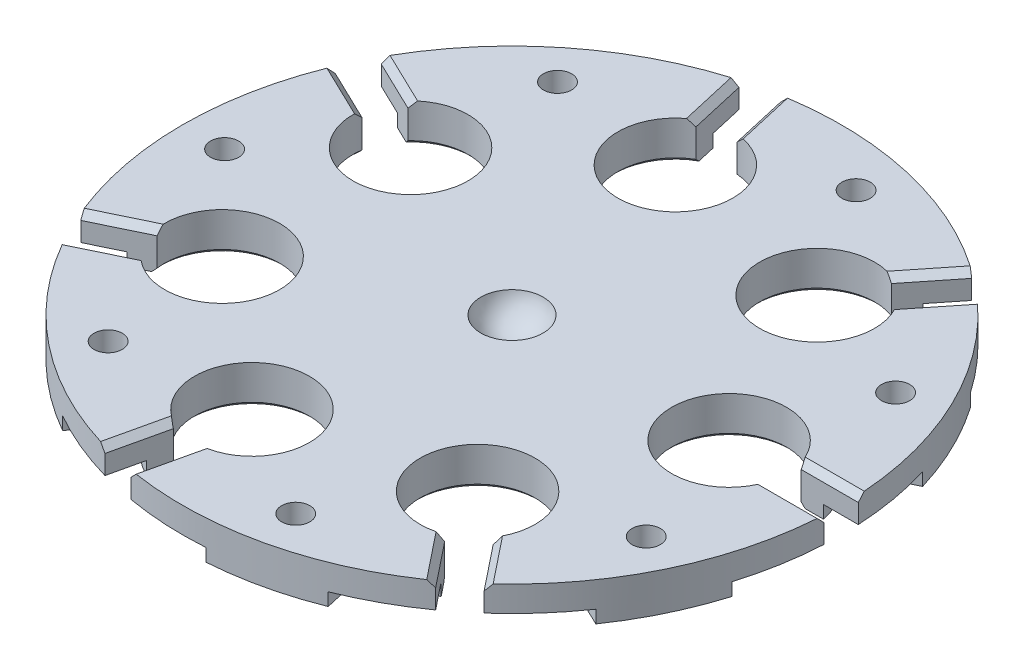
ISO-10303-21;
HEADER;
FILE_DESCRIPTION(('STEP AP214'),'2;1');
FILE_NAME('part.step','',(''),(''),'','','');
FILE_SCHEMA(('AUTOMOTIVE_DESIGN { 1 0 10303 214 1 1 1 1 }'));
ENDSEC;
DATA;
#1=APPLICATION_CONTEXT('core data for automotive mechanical design processes');
#2=APPLICATION_PROTOCOL_DEFINITION('international standard','automotive_design',2000,#1);
#3=PRODUCT_CONTEXT('',#1,'mechanical');
#4=PRODUCT('Part','Part','',(#3));
#5=PRODUCT_RELATED_PRODUCT_CATEGORY('part','',(#4));
#6=PRODUCT_DEFINITION_FORMATION('','',#4);
#7=PRODUCT_DEFINITION_CONTEXT('part definition',#1,'design');
#8=PRODUCT_DEFINITION('design','',#6,#7);
#9=PRODUCT_DEFINITION_SHAPE('','',#8);
#10=(LENGTH_UNIT() NAMED_UNIT(*) SI_UNIT(.MILLI.,.METRE.));
#11=(NAMED_UNIT(*) PLANE_ANGLE_UNIT() SI_UNIT($,.RADIAN.));
#12=(NAMED_UNIT(*) SI_UNIT($,.STERADIAN.) SOLID_ANGLE_UNIT());
#13=UNCERTAINTY_MEASURE_WITH_UNIT(LENGTH_MEASURE(1.E-05),#10,'distance_accuracy_value','');
#14=(GEOMETRIC_REPRESENTATION_CONTEXT(3) GLOBAL_UNCERTAINTY_ASSIGNED_CONTEXT((#13)) GLOBAL_UNIT_ASSIGNED_CONTEXT((#10,
#11,#12)) REPRESENTATION_CONTEXT('',''));
#15=CARTESIAN_POINT('',(0.,0.,0.));
#16=DIRECTION('',(0.,0.,1.));
#17=DIRECTION('',(1.,0.,0.));
#18=AXIS2_PLACEMENT_3D('',#15,#16,#17);
#19=CARTESIAN_POINT('',(43.18,-2.54,5.89158012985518E-13));
#20=DIRECTION('',(0.,-1.,0.));
#21=DIRECTION('',(0.,0.,-1.));
#22=AXIS2_PLACEMENT_3D('',#19,#20,#21);
#23=PLANE('',#22);
#24=DIRECTION('',(-0.900968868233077,0.,-0.43388373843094));
#25=VECTOR('',#24,1.);
#26=CARTESIAN_POINT('',(49.0420072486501,-2.54,34.8941351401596));
#27=LINE('',#26,#25);
#28=CARTESIAN_POINT('',(53.9201166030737,-2.54000000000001,37.2433087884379));
#29=VERTEX_POINT('',#28);
#30=CARTESIAN_POINT('',(49.0420072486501,-2.54,34.8941351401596));
#31=VERTEX_POINT('',#30);
#32=EDGE_CURVE('E1169',#29,#31,#27,.T.);
#33=ORIENTED_EDGE('',*,*,#32,.T.);
#34=CARTESIAN_POINT('',(26.9222896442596,-2.54,33.7594834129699));
#35=DIRECTION('',(0.,-1.,0.));
#36=DIRECTION('',(0.,0.,-1.));
#37=AXIS2_PLACEMENT_3D('',#34,#35,#36);
#38=CIRCLE('',#37,22.1488);
#39=CARTESIAN_POINT('',(45.6949918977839,-2.54000000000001,22.0055482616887));
#40=VERTEX_POINT('',#39);
#41=EDGE_CURVE('E1172',#31,#40,#38,.F.);
#42=ORIENTED_EDGE('',*,*,#41,.T.);
#43=CARTESIAN_POINT('',(43.1799999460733,-2.54,-5.96513428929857E-08));
#44=DIRECTION('',(0.,-1.,0.));
#45=DIRECTION('',(0.,0.,-1.));
#46=AXIS2_PLACEMENT_3D('',#43,#44,#45);
#47=CIRCLE('',#46,22.1488);
#48=CARTESIAN_POINT('',(57.8585247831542,-2.54000000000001,16.5864477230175));
#49=VERTEX_POINT('',#48);
#50=EDGE_CURVE('E1175',#40,#49,#47,.F.);
#51=ORIENTED_EDGE('',*,*,#50,.T.);
#52=DIRECTION('',(0.900968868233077,0.,0.433883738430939));
#53=VECTOR('',#52,1.);
#54=CARTESIAN_POINT('',(57.8585247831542,-2.54,16.5864477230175));
#55=LINE('',#54,#53);
#56=CARTESIAN_POINT('',(62.7366341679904,-2.54000000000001,18.9356213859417));
#57=VERTEX_POINT('',#56);
#58=EDGE_CURVE('E1178',#49,#57,#55,.T.);
#59=ORIENTED_EDGE('',*,*,#58,.T.);
#60=CARTESIAN_POINT('',(0.,-2.54,0.));
#61=DIRECTION('',(0.,-1.,0.));
#62=DIRECTION('',(0.,0.,-1.));
#63=AXIS2_PLACEMENT_3D('',#60,#61,#62);
#64=CIRCLE('',#63,65.532);
#65=EDGE_CURVE('E1151',#57,#29,#64,.T.);
#66=ORIENTED_EDGE('',*,*,#65,.T.);
#67=EDGE_LOOP('',(#33,#42,#51,#59,#66));
#68=FACE_BOUND('',#67,.T.);
#69=CARTESIAN_POINT('',(51.4903706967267,-2.54,24.7964556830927));
#70=DIRECTION('',(0.,1.,0.));
#71=DIRECTION('',(0.,0.,1.));
#72=AXIS2_PLACEMENT_3D('',#69,#70,#71);
#73=CIRCLE('',#72,2.8067);
#74=CARTESIAN_POINT('',(51.4903706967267,-2.54,27.6031556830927));
#75=VERTEX_POINT('',#74);
#76=EDGE_CURVE('E667',#75,#75,#73,.T.);
#77=ORIENTED_EDGE('',*,*,#76,.T.);
#78=EDGE_LOOP('',(#77));
#79=FACE_BOUND('',#78,.T.);
#80=ADVANCED_FACE('F44',(#68,#79),#23,.T.);
#81=CARTESIAN_POINT('',(0.,5.08,0.));
#82=DIRECTION('',(0.,-1.,0.));
#83=DIRECTION('',(0.,0.,-1.));
#84=AXIS2_PLACEMENT_3D('',#81,#82,#83);
#85=CYLINDRICAL_SURFACE('',#84,65.532);
#86=CARTESIAN_POINT('',(0.,5.08,0.));
#87=DIRECTION('',(0.,1.,0.));
#88=DIRECTION('',(0.,0.,1.));
#89=AXIS2_PLACEMENT_3D('',#86,#87,#88);
#90=CIRCLE('',#89,65.532);
#91=CARTESIAN_POINT('',(37.0795316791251,5.08,-54.0328729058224));
#92=VERTEX_POINT('',#91);
#93=CARTESIAN_POINT('',(-9.96351874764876,5.08,-64.7701421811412));
#94=VERTEX_POINT('',#93);
#95=EDGE_CURVE('E771',#92,#94,#90,.T.);
#96=ORIENTED_EDGE('',*,*,#95,.F.);
#97=CARTESIAN_POINT('',(0.,0.38099999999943,0.));
#98=DIRECTION('',(0.55283834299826,0.70710678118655,0.440873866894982));
#99=DIRECTION('',(0.552838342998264,-0.707106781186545,0.440873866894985));
#100=AXIS2_PLACEMENT_3D('',#97,#98,#99);
#101=ELLIPSE('',#100,92.6762431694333,65.532);
#102=CARTESIAN_POINT('',(38.1216605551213,3.81,-53.3027393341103));
#103=VERTEX_POINT('',#102);
#104=EDGE_CURVE('E995',#92,#103,#101,.F.);
#105=ORIENTED_EDGE('',*,*,#104,.T.);
#106=DIRECTION('',(0.,-1.,0.));
#107=VECTOR('',#106,1.);
#108=CARTESIAN_POINT('',(38.1216605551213,5.08,-53.3027393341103));
#109=LINE('',#108,#107);
#110=CARTESIAN_POINT('',(38.1216605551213,0.,-53.3027393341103));
#111=VERTEX_POINT('',#110);
#112=EDGE_CURVE('E1481',#103,#111,#109,.T.);
#113=ORIENTED_EDGE('',*,*,#112,.T.);
#114=CARTESIAN_POINT('',(0.,0.,0.));
#115=DIRECTION('',(0.,1.,0.));
#116=DIRECTION('',(0.,0.,1.));
#117=AXIS2_PLACEMENT_3D('',#114,#115,#116);
#118=CIRCLE('',#117,65.532);
#119=CARTESIAN_POINT('',(24.311186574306,0.,-60.8556425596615));
#120=VERTEX_POINT('',#119);
#121=EDGE_CURVE('E776',#111,#120,#118,.T.);
#122=ORIENTED_EDGE('',*,*,#121,.T.);
#123=DIRECTION('',(0.,1.,0.));
#124=VECTOR('',#123,1.);
#125=CARTESIAN_POINT('',(24.311186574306,-28.9113624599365,-60.8556425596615));
#126=LINE('',#125,#124);
#127=CARTESIAN_POINT('',(24.311186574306,-2.54,-60.8556425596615));
#128=VERTEX_POINT('',#127);
#129=EDGE_CURVE('E1346',#128,#120,#126,.T.);
#130=ORIENTED_EDGE('',*,*,#129,.F.);
#131=CARTESIAN_POINT('',(0.,-2.54,0.));
#132=DIRECTION('',(0.,-1.,0.));
#133=DIRECTION('',(0.,0.,-1.));
#134=AXIS2_PLACEMENT_3D('',#131,#132,#133);
#135=CIRCLE('',#134,65.532);
#136=CARTESIAN_POINT('',(4.50065139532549,-2.54,-65.3772679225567));
#137=VERTEX_POINT('',#136);
#138=EDGE_CURVE('E1307',#137,#128,#135,.T.);
#139=ORIENTED_EDGE('',*,*,#138,.F.);
#140=DIRECTION('',(0.,1.,0.));
#141=VECTOR('',#140,1.);
#142=CARTESIAN_POINT('',(4.50065139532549,-28.9113624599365,-65.3772679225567));
#143=LINE('',#142,#141);
#144=CARTESIAN_POINT('',(4.50065139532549,0.,-65.3772679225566));
#145=VERTEX_POINT('',#144);
#146=EDGE_CURVE('E1350',#137,#145,#143,.T.);
#147=ORIENTED_EDGE('',*,*,#146,.T.);
#148=CARTESIAN_POINT('',(-11.2192375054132,0.,-64.5644773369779));
#149=VERTEX_POINT('',#148);
#150=EDGE_CURVE('E1687',#145,#149,#118,.T.);
#151=ORIENTED_EDGE('',*,*,#150,.T.);
#152=DIRECTION('',(0.,-1.,0.));
#153=VECTOR('',#152,1.);
#154=CARTESIAN_POINT('',(-11.2192375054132,5.08,-64.5644773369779));
#155=LINE('',#154,#153);
#156=CARTESIAN_POINT('',(-11.2192375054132,3.80999999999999,-64.5644773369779));
#157=VERTEX_POINT('',#156);
#158=EDGE_CURVE('E1467',#149,#157,#155,.F.);
#159=ORIENTED_EDGE('',*,*,#158,.T.);
#160=CARTESIAN_POINT('',(0.,0.381000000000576,0.));
#161=DIRECTION('',(-0.689378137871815,0.707106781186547,0.157346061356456));
#162=DIRECTION('',(-0.689378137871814,-0.707106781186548,0.157346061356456));
#163=AXIS2_PLACEMENT_3D('',#160,#161,#162);
#164=ELLIPSE('',#163,92.6762431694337,65.532);
#165=EDGE_CURVE('E986',#157,#94,#164,.F.);
#166=ORIENTED_EDGE('',*,*,#165,.T.);
#167=EDGE_LOOP('',(#96,#105,#113,#122,#130,#139,#147,#151,#159,#166));
#168=FACE_BOUND('',#167,.T.);
#169=ADVANCED_FACE('F1568',(#168),#85,.T.);
#170=CARTESIAN_POINT('',(-19.1258912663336,5.08,-62.67889044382));
#171=VERTEX_POINT('',#170);
#172=CARTESIAN_POINT('',(-56.8514886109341,5.08,-32.5937304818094));
#173=VERTEX_POINT('',#172);
#174=EDGE_CURVE('E1785',#171,#173,#90,.T.);
#175=ORIENTED_EDGE('',*,*,#174,.F.);
#176=CARTESIAN_POINT('',(0.,0.380999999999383,0.));
#177=DIRECTION('',(0.689378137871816,0.707106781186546,-0.157346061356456));
#178=DIRECTION('',(0.689378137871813,-0.707106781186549,-0.157346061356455));
#179=AXIS2_PLACEMENT_3D('',#176,#177,#178);
#180=ELLIPSE('',#179,92.6762431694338,65.532);
#181=CARTESIAN_POINT('',(-17.9052931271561,3.81,-63.0384287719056));
#182=VERTEX_POINT('',#181);
#183=EDGE_CURVE('E975',#171,#182,#180,.F.);
#184=ORIENTED_EDGE('',*,*,#183,.T.);
#185=DIRECTION('',(0.,-1.,0.));
#186=VECTOR('',#185,1.);
#187=CARTESIAN_POINT('',(-17.9052931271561,5.08,-63.0384287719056));
#188=LINE('',#187,#186);
#189=CARTESIAN_POINT('',(-17.9052931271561,0.,-63.0384287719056));
#190=VERTEX_POINT('',#189);
#191=EDGE_CURVE('E1459',#182,#190,#188,.T.);
#192=ORIENTED_EDGE('',*,*,#191,.T.);
#193=CARTESIAN_POINT('',(-32.4210803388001,0.,-56.9501235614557));
#194=VERTEX_POINT('',#193);
#195=EDGE_CURVE('E1697',#190,#194,#118,.T.);
#196=ORIENTED_EDGE('',*,*,#195,.T.);
#197=DIRECTION('',(0.,1.,0.));
#198=VECTOR('',#197,1.);
#199=CARTESIAN_POINT('',(-32.4210803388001,-28.4291877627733,-56.9501235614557));
#200=LINE('',#199,#198);
#201=CARTESIAN_POINT('',(-32.4210803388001,-2.54000000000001,-56.9501235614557));
#202=VERTEX_POINT('',#201);
#203=EDGE_CURVE('E1308',#202,#194,#200,.T.);
#204=ORIENTED_EDGE('',*,*,#203,.F.);
#205=CARTESIAN_POINT('',(0.,-2.54,0.));
#206=DIRECTION('',(0.,-1.,0.));
#207=DIRECTION('',(0.,0.,-1.));
#208=AXIS2_PLACEMENT_3D('',#205,#206,#207);
#209=CIRCLE('',#208,65.532);
#210=CARTESIAN_POINT('',(-48.3078960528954,-2.54000000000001,-44.2808107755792));
#211=VERTEX_POINT('',#210);
#212=EDGE_CURVE('E1269',#211,#202,#209,.T.);
#213=ORIENTED_EDGE('',*,*,#212,.F.);
#214=DIRECTION('',(0.,1.,0.));
#215=VECTOR('',#214,1.);
#216=CARTESIAN_POINT('',(-48.3078960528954,-28.4291877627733,-44.2808107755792));
#217=LINE('',#216,#215);
#218=CARTESIAN_POINT('',(-48.3078960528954,0.,-44.2808107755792));
#219=VERTEX_POINT('',#218);
#220=EDGE_CURVE('E1312',#211,#219,#217,.T.);
#221=ORIENTED_EDGE('',*,*,#220,.T.);
#222=CARTESIAN_POINT('',(-57.4736212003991,0.,-31.4837400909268));
#223=VERTEX_POINT('',#222);
#224=EDGE_CURVE('E1694',#219,#223,#118,.T.);
#225=ORIENTED_EDGE('',*,*,#224,.T.);
#226=DIRECTION('',(0.,-1.,0.));
#227=VECTOR('',#226,1.);
#228=CARTESIAN_POINT('',(-57.4736212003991,5.08,-31.4837400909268));
#229=LINE('',#228,#227);
#230=CARTESIAN_POINT('',(-57.4736212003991,3.81,-31.4837400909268));
#231=VERTEX_POINT('',#230);
#232=EDGE_CURVE('E1445',#223,#231,#229,.F.);
#233=ORIENTED_EDGE('',*,*,#232,.T.);
#234=CARTESIAN_POINT('',(0.,0.381000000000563,0.));
#235=DIRECTION('',(-0.306802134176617,0.707106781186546,0.637081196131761));
#236=DIRECTION('',(-0.306802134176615,-0.707106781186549,0.637081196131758));
#237=AXIS2_PLACEMENT_3D('',#234,#235,#236);
#238=ELLIPSE('',#237,92.6762431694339,65.532);
#239=EDGE_CURVE('E966',#231,#173,#238,.F.);
#240=ORIENTED_EDGE('',*,*,#239,.T.);
#241=EDGE_LOOP('',(#175,#184,#192,#196,#204,#213,#221,#225,#233,#240));
#242=FACE_BOUND('',#241,.T.);
#243=ADVANCED_FACE('F1574',(#242),#85,.T.);
#244=CARTESIAN_POINT('',(-60.929127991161,5.08,-24.1264250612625));
#245=VERTEX_POINT('',#244);
#246=CARTESIAN_POINT('',(-60.9291279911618,5.08,24.1264250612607));
#247=VERTEX_POINT('',#246);
#248=EDGE_CURVE('E1786',#245,#247,#90,.T.);
#249=ORIENTED_EDGE('',*,*,#248,.F.);
#250=CARTESIAN_POINT('',(0.,0.380999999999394,0.));
#251=DIRECTION('',(0.306802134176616,0.707106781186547,-0.63708119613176));
#252=DIRECTION('',(0.306802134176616,-0.707106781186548,-0.637081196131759));
#253=AXIS2_PLACEMENT_3D('',#250,#251,#252);
#254=ELLIPSE('',#253,92.6762431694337,65.532);
#255=CARTESIAN_POINT('',(-60.4491958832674,3.81000000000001,-25.3048955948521));
#256=VERTEX_POINT('',#255);
#257=EDGE_CURVE('E955',#245,#256,#254,.F.);
#258=ORIENTED_EDGE('',*,*,#257,.T.);
#259=DIRECTION('',(0.,-1.,0.));
#260=VECTOR('',#259,1.);
#261=CARTESIAN_POINT('',(-60.4491958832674,5.08,-25.3048955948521));
#262=LINE('',#261,#260);
#263=CARTESIAN_POINT('',(-60.4491958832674,0.,-25.3048955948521));
#264=VERTEX_POINT('',#263);
#265=EDGE_CURVE('E1437',#256,#264,#262,.T.);
#266=ORIENTED_EDGE('',*,*,#265,.T.);
#267=CARTESIAN_POINT('',(-64.7396124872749,0.,-10.1599999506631));
#268=VERTEX_POINT('',#267);
#269=EDGE_CURVE('E1692',#264,#268,#118,.T.);
#270=ORIENTED_EDGE('',*,*,#269,.T.);
#271=DIRECTION('',(0.,1.,0.));
#272=VECTOR('',#271,1.);
#273=CARTESIAN_POINT('',(-64.7396124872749,-27.6869364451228,-10.1599999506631));
#274=LINE('',#273,#272);
#275=CARTESIAN_POINT('',(-64.7396124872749,-2.54,-10.1599999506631));
#276=VERTEX_POINT('',#275);
#277=EDGE_CURVE('E1270',#276,#268,#274,.T.);
#278=ORIENTED_EDGE('',*,*,#277,.F.);
#279=CARTESIAN_POINT('',(0.,-2.54,0.));
#280=DIRECTION('',(0.,-1.,0.));
#281=DIRECTION('',(0.,0.,-1.));
#282=AXIS2_PLACEMENT_3D('',#279,#280,#281);
#283=CIRCLE('',#282,65.532);
#284=CARTESIAN_POINT('',(-64.7396124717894,-2.54,10.1600000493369));
#285=VERTEX_POINT('',#284);
#286=EDGE_CURVE('E1231',#285,#276,#283,.T.);
#287=ORIENTED_EDGE('',*,*,#286,.F.);
#288=DIRECTION('',(0.,1.,0.));
#289=VECTOR('',#288,1.);
#290=CARTESIAN_POINT('',(-64.7396124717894,-27.6869364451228,10.1600000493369));
#291=LINE('',#290,#289);
#292=CARTESIAN_POINT('',(-64.7396124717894,0.,10.1600000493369));
#293=VERTEX_POINT('',#292);
#294=EDGE_CURVE('E1274',#285,#293,#291,.T.);
#295=ORIENTED_EDGE('',*,*,#294,.T.);
#296=CARTESIAN_POINT('',(-60.4491958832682,0.,25.3048955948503));
#297=VERTEX_POINT('',#296);
#298=EDGE_CURVE('E1689',#293,#297,#118,.T.);
#299=ORIENTED_EDGE('',*,*,#298,.T.);
#300=DIRECTION('',(0.,-1.,0.));
#301=VECTOR('',#300,1.);
#302=CARTESIAN_POINT('',(-60.4491958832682,5.08,25.3048955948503));
#303=LINE('',#302,#301);
#304=CARTESIAN_POINT('',(-60.4491958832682,3.81,25.3048955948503));
#305=VERTEX_POINT('',#304);
#306=EDGE_CURVE('E1423',#297,#305,#303,.F.);
#307=ORIENTED_EDGE('',*,*,#306,.T.);
#308=CARTESIAN_POINT('',(0.,0.381000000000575,0.));
#309=DIRECTION('',(0.306802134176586,0.707106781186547,0.637081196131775));
#310=DIRECTION('',(0.306802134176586,-0.707106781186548,0.637081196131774));
#311=AXIS2_PLACEMENT_3D('',#308,#309,#310);
#312=ELLIPSE('',#311,92.6762431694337,65.532);
#313=EDGE_CURVE('E946',#305,#247,#312,.F.);
#314=ORIENTED_EDGE('',*,*,#313,.T.);
#315=EDGE_LOOP('',(#249,#258,#266,#270,#278,#287,#295,#299,#307,#314));
#316=FACE_BOUND('',#315,.T.);
#317=ADVANCED_FACE('F2035',(#316),#85,.T.);
#318=CARTESIAN_POINT('',(-56.8514886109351,5.08,32.5937304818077));
#319=VERTEX_POINT('',#318);
#320=CARTESIAN_POINT('',(-19.1258912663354,5.08,62.6788904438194));
#321=VERTEX_POINT('',#320);
#322=EDGE_CURVE('E1678',#319,#321,#90,.T.);
#323=ORIENTED_EDGE('',*,*,#322,.F.);
#324=CARTESIAN_POINT('',(0.,0.380999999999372,0.));
#325=DIRECTION('',(-0.306802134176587,0.707106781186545,-0.637081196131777));
#326=DIRECTION('',(-0.306802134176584,-0.70710678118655,-0.637081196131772));
#327=AXIS2_PLACEMENT_3D('',#324,#325,#326);
#328=ELLIPSE('',#327,92.676243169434,65.532);
#329=CARTESIAN_POINT('',(-57.4736212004,3.80999999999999,31.4837400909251));
#330=VERTEX_POINT('',#329);
#331=EDGE_CURVE('E935',#319,#330,#328,.F.);
#332=ORIENTED_EDGE('',*,*,#331,.T.);
#333=DIRECTION('',(0.,-1.,0.));
#334=VECTOR('',#333,1.);
#335=CARTESIAN_POINT('',(-57.4736212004,5.08,31.4837400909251));
#336=LINE('',#335,#334);
#337=CARTESIAN_POINT('',(-57.4736212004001,0.,31.4837400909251));
#338=VERTEX_POINT('',#337);
#339=EDGE_CURVE('E1117',#330,#338,#336,.T.);
#340=ORIENTED_EDGE('',*,*,#339,.T.);
#341=CARTESIAN_POINT('',(-48.3078959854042,0.,44.2808108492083));
#342=VERTEX_POINT('',#341);
#343=EDGE_CURVE('E1686',#338,#342,#118,.T.);
#344=ORIENTED_EDGE('',*,*,#343,.T.);
#345=DIRECTION('',(0.,1.,0.));
#346=VECTOR('',#345,1.);
#347=CARTESIAN_POINT('',(-48.3078959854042,-28.4291877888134,44.2808108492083));
#348=LINE('',#347,#346);
#349=CARTESIAN_POINT('',(-48.3078959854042,-2.54000000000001,44.2808108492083));
#350=VERTEX_POINT('',#349);
#351=EDGE_CURVE('E1232',#350,#342,#348,.T.);
#352=ORIENTED_EDGE('',*,*,#351,.F.);
#353=CARTESIAN_POINT('',(0.,-2.54,0.));
#354=DIRECTION('',(0.,-1.,0.));
#355=DIRECTION('',(0.,0.,-1.));
#356=AXIS2_PLACEMENT_3D('',#353,#354,#355);
#357=CIRCLE('',#356,65.532);
#358=CARTESIAN_POINT('',(-32.4210802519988,-2.54000000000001,56.9501236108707));
#359=VERTEX_POINT('',#358);
#360=EDGE_CURVE('E1193',#359,#350,#357,.T.);
#361=ORIENTED_EDGE('',*,*,#360,.F.);
#362=DIRECTION('',(0.,1.,0.));
#363=VECTOR('',#362,1.);
#364=CARTESIAN_POINT('',(-32.4210802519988,-28.4291877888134,56.9501236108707));
#365=LINE('',#364,#363);
#366=CARTESIAN_POINT('',(-32.4210802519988,0.,56.9501236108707));
#367=VERTEX_POINT('',#366);
#368=EDGE_CURVE('E1236',#359,#367,#365,.T.);
#369=ORIENTED_EDGE('',*,*,#368,.T.);
#370=CARTESIAN_POINT('',(-17.905293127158,0.,63.0384287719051));
#371=VERTEX_POINT('',#370);
#372=EDGE_CURVE('E1685',#367,#371,#118,.T.);
#373=ORIENTED_EDGE('',*,*,#372,.T.);
#374=DIRECTION('',(0.,-1.,0.));
#375=VECTOR('',#374,1.);
#376=CARTESIAN_POINT('',(-17.905293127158,5.08,63.0384287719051));
#377=LINE('',#376,#375);
#378=CARTESIAN_POINT('',(-17.905293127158,3.81,63.0384287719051));
#379=VERTEX_POINT('',#378);
#380=EDGE_CURVE('E1408',#371,#379,#377,.F.);
#381=ORIENTED_EDGE('',*,*,#380,.T.);
#382=CARTESIAN_POINT('',(0.,0.381000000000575,0.));
#383=DIRECTION('',(0.689378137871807,0.707106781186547,0.157346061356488));
#384=DIRECTION('',(0.689378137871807,-0.707106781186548,0.157346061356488));
#385=AXIS2_PLACEMENT_3D('',#382,#383,#384);
#386=ELLIPSE('',#385,92.6762431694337,65.532);
#387=EDGE_CURVE('E926',#379,#321,#386,.F.);
#388=ORIENTED_EDGE('',*,*,#387,.T.);
#389=EDGE_LOOP('',(#323,#332,#340,#344,#352,#361,#369,#373,#381,#388));
#390=FACE_BOUND('',#389,.T.);
#391=ADVANCED_FACE('F1792',(#390),#85,.T.);
#392=CARTESIAN_POINT('',(-9.96351874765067,5.08,64.7701421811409));
#393=VERTEX_POINT('',#392);
#394=CARTESIAN_POINT('',(37.0795316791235,5.08,54.0328729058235));
#395=VERTEX_POINT('',#394);
#396=EDGE_CURVE('E1676',#393,#395,#90,.T.);
#397=ORIENTED_EDGE('',*,*,#396,.F.);
#398=CARTESIAN_POINT('',(0.,0.380999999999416,0.));
#399=DIRECTION('',(-0.689378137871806,0.707106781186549,-0.157346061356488));
#400=DIRECTION('',(-0.689378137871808,-0.707106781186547,-0.157346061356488));
#401=AXIS2_PLACEMENT_3D('',#398,#399,#400);
#402=ELLIPSE('',#401,92.6762431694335,65.532);
#403=CARTESIAN_POINT('',(-11.2192375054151,3.81,64.5644773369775));
#404=VERTEX_POINT('',#403);
#405=EDGE_CURVE('E915',#393,#404,#402,.F.);
#406=ORIENTED_EDGE('',*,*,#405,.T.);
#407=DIRECTION('',(0.,-1.,0.));
#408=VECTOR('',#407,1.);
#409=CARTESIAN_POINT('',(-11.2192375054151,5.08,64.5644773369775));
#410=LINE('',#409,#408);
#411=CARTESIAN_POINT('',(-11.2192375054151,0.,64.5644773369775));
#412=VERTEX_POINT('',#411);
#413=EDGE_CURVE('E1127',#404,#412,#410,.T.);
#414=ORIENTED_EDGE('',*,*,#413,.T.);
#415=CARTESIAN_POINT('',(4.50065149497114,0.,65.3772679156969));
#416=VERTEX_POINT('',#415);
#417=EDGE_CURVE('E1683',#412,#416,#118,.T.);
#418=ORIENTED_EDGE('',*,*,#417,.T.);
#419=DIRECTION('',(0.,1.,0.));
#420=VECTOR('',#419,1.);
#421=CARTESIAN_POINT('',(4.50065149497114,-28.9113624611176,65.3772679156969));
#422=LINE('',#421,#420);
#423=CARTESIAN_POINT('',(4.50065149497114,-2.54,65.3772679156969));
#424=VERTEX_POINT('',#423);
#425=EDGE_CURVE('E1194',#424,#416,#422,.T.);
#426=ORIENTED_EDGE('',*,*,#425,.F.);
#427=CARTESIAN_POINT('',(0.,-2.54,0.));
#428=DIRECTION('',(0.,-1.,0.));
#429=DIRECTION('',(0.,0.,-1.));
#430=AXIS2_PLACEMENT_3D('',#427,#428,#429);
#431=CIRCLE('',#430,65.532);
#432=CARTESIAN_POINT('',(24.3111866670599,-2.54,60.8556425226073));
#433=VERTEX_POINT('',#432);
#434=EDGE_CURVE('E1155',#433,#424,#431,.T.);
#435=ORIENTED_EDGE('',*,*,#434,.F.);
#436=DIRECTION('',(0.,1.,0.));
#437=VECTOR('',#436,1.);
#438=CARTESIAN_POINT('',(24.3111866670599,-28.9113624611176,60.8556425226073));
#439=LINE('',#438,#437);
#440=CARTESIAN_POINT('',(24.3111866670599,0.,60.8556425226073));
#441=VERTEX_POINT('',#440);
#442=EDGE_CURVE('E1198',#433,#441,#439,.T.);
#443=ORIENTED_EDGE('',*,*,#442,.T.);
#444=CARTESIAN_POINT('',(38.1216605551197,0.,53.3027393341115));
#445=VERTEX_POINT('',#444);
#446=EDGE_CURVE('E1680',#441,#445,#118,.T.);
#447=ORIENTED_EDGE('',*,*,#446,.T.);
#448=DIRECTION('',(0.,-1.,0.));
#449=VECTOR('',#448,1.);
#450=CARTESIAN_POINT('',(38.1216605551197,5.08,53.3027393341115));
#451=LINE('',#450,#449);
#452=CARTESIAN_POINT('',(38.1216605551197,3.81,53.3027393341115));
#453=VERTEX_POINT('',#452);
#454=EDGE_CURVE('E1387',#445,#453,#451,.F.);
#455=ORIENTED_EDGE('',*,*,#454,.T.);
#456=CARTESIAN_POINT('',(0.,0.381000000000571,0.));
#457=DIRECTION('',(0.552838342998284,0.707106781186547,-0.440873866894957));
#458=DIRECTION('',(0.552838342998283,-0.707106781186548,-0.440873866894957));
#459=AXIS2_PLACEMENT_3D('',#456,#457,#458);
#460=ELLIPSE('',#459,92.6762431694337,65.532);
#461=EDGE_CURVE('E906',#453,#395,#460,.F.);
#462=ORIENTED_EDGE('',*,*,#461,.T.);
#463=EDGE_LOOP('',(#397,#406,#414,#418,#426,#435,#443,#447,#455,#462));
#464=FACE_BOUND('',#463,.T.);
#465=ADVANCED_FACE('F1679',(#464),#85,.T.);
#466=CARTESIAN_POINT('',(44.4271839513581,5.08,48.1733157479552));
#467=VERTEX_POINT('',#466);
#468=CARTESIAN_POINT('',(65.363310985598,5.08,4.69900000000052));
#469=VERTEX_POINT('',#468);
#470=EDGE_CURVE('E772',#467,#469,#90,.T.);
#471=ORIENTED_EDGE('',*,*,#470,.F.);
#472=CARTESIAN_POINT('',(0.,0.380999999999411,0.));
#473=DIRECTION('',(-0.552838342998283,0.707106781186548,0.440873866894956));
#474=DIRECTION('',(-0.552838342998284,-0.707106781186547,0.440873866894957));
#475=AXIS2_PLACEMENT_3D('',#472,#473,#474);
#476=ELLIPSE('',#475,92.6762431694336,65.532);
#477=CARTESIAN_POINT('',(43.4834608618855,3.81000000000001,49.0268462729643));
#478=VERTEX_POINT('',#477);
#479=EDGE_CURVE('E895',#467,#478,#476,.F.);
#480=ORIENTED_EDGE('',*,*,#479,.T.);
#481=DIRECTION('',(0.,-1.,0.));
#482=VECTOR('',#481,1.);
#483=CARTESIAN_POINT('',(43.4834608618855,5.08,49.0268462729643));
#484=LINE('',#483,#482);
#485=CARTESIAN_POINT('',(43.4834608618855,0.,49.0268462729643));
#486=VERTEX_POINT('',#485);
#487=EDGE_CURVE('E1345',#478,#486,#484,.T.);
#488=ORIENTED_EDGE('',*,*,#487,.T.);
#489=CARTESIAN_POINT('',(53.9201166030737,0.,37.2433087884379));
#490=VERTEX_POINT('',#489);
#491=EDGE_CURVE('E1658',#486,#490,#118,.T.);
#492=ORIENTED_EDGE('',*,*,#491,.T.);
#493=DIRECTION('',(0.,1.,0.));
#494=VECTOR('',#493,1.);
#495=CARTESIAN_POINT('',(53.9201166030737,-29.3191613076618,37.2433087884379));
#496=LINE('',#495,#494);
#497=EDGE_CURVE('E1156',#29,#490,#496,.T.);
#498=ORIENTED_EDGE('',*,*,#497,.F.);
#499=ORIENTED_EDGE('',*,*,#65,.F.);
#500=DIRECTION('',(0.,1.,0.));
#501=VECTOR('',#500,1.);
#502=CARTESIAN_POINT('',(62.7366341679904,-29.3191613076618,18.9356213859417));
#503=LINE('',#502,#501);
#504=CARTESIAN_POINT('',(62.7366341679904,0.,18.9356213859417));
#505=VERTEX_POINT('',#504);
#506=EDGE_CURVE('E1160',#57,#505,#503,.T.);
#507=ORIENTED_EDGE('',*,*,#506,.T.);
#508=CARTESIAN_POINT('',(65.4422262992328,0.,3.42900000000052));
#509=VERTEX_POINT('',#508);
#510=EDGE_CURVE('E1684',#505,#509,#118,.T.);
#511=ORIENTED_EDGE('',*,*,#510,.T.);
#512=DIRECTION('',(0.,-1.,0.));
#513=VECTOR('',#512,1.);
#514=CARTESIAN_POINT('',(65.4422262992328,5.08,3.42900000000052));
#515=LINE('',#514,#513);
#516=CARTESIAN_POINT('',(65.4422262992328,3.81,3.42900000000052));
#517=VERTEX_POINT('',#516);
#518=EDGE_CURVE('E711',#509,#517,#515,.F.);
#519=ORIENTED_EDGE('',*,*,#518,.T.);
#520=CARTESIAN_POINT('',(0.,0.381000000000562,0.));
#521=DIRECTION('',(0.,0.707106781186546,-0.707106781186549));
#522=DIRECTION('',(0.,-0.707106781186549,-0.707106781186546));
#523=AXIS2_PLACEMENT_3D('',#520,#521,#522);
#524=ELLIPSE('',#523,92.6762431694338,65.532);
#525=EDGE_CURVE('E790',#517,#469,#524,.F.);
#526=ORIENTED_EDGE('',*,*,#525,.T.);
#527=EDGE_LOOP('',(#471,#480,#488,#492,#498,#499,#507,#511,#519,#526));
#528=FACE_BOUND('',#527,.T.);
#529=ADVANCED_FACE('F1853',(#528),#85,.T.);
#530=CARTESIAN_POINT('',(0.,0.,0.));
#531=DIRECTION('',(0.,1.,0.));
#532=DIRECTION('',(0.,0.,1.));
#533=AXIS2_PLACEMENT_3D('',#530,#531,#532);
#534=PLANE('',#533);
#535=ORIENTED_EDGE('',*,*,#121,.F.);
#536=DIRECTION('',(-0.623489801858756,0.,0.781831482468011));
#537=VECTOR('',#536,1.);
#538=CARTESIAN_POINT('',(-2.68090015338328,0.,-2.13794653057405));
#539=LINE('',#538,#537);
#540=CARTESIAN_POINT('',(33.8204637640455,0.,-47.9092091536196));
#541=VERTEX_POINT('',#540);
#542=EDGE_CURVE('E1483',#111,#541,#539,.T.);
#543=ORIENTED_EDGE('',*,*,#542,.T.);
#544=CARTESIAN_POINT('',(26.922289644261,0.,-33.7594834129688));
#545=DIRECTION('',(0.,1.,0.));
#546=DIRECTION('',(0.,0.,1.));
#547=AXIS2_PLACEMENT_3D('',#544,#545,#546);
#548=CIRCLE('',#547,15.74165);
#549=CARTESIAN_POINT('',(39.1822640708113,0.,-43.6333160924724));
#550=VERTEX_POINT('',#549);
#551=EDGE_CURVE('E857',#550,#541,#548,.F.);
#552=ORIENTED_EDGE('',*,*,#551,.F.);
#553=DIRECTION('',(0.623489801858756,0.,-0.781831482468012));
#554=VECTOR('',#553,1.);
#555=CARTESIAN_POINT('',(2.68090015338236,0.,2.13794653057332));
#556=LINE('',#555,#554);
#557=CARTESIAN_POINT('',(43.4834608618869,0.,-49.026846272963));
#558=VERTEX_POINT('',#557);
#559=EDGE_CURVE('E657',#550,#558,#556,.T.);
#560=ORIENTED_EDGE('',*,*,#559,.T.);
#561=CARTESIAN_POINT('',(53.9201165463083,0.,-37.2433088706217));
#562=VERTEX_POINT('',#561);
#563=EDGE_CURVE('E773',#562,#558,#118,.T.);
#564=ORIENTED_EDGE('',*,*,#563,.F.);
#565=DIRECTION('',(0.90096886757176,0.,-0.433883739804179));
#566=VECTOR('',#565,1.);
#567=CARTESIAN_POINT('',(49.0420071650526,0.,-34.8941352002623));
#568=LINE('',#567,#566);
#569=CARTESIAN_POINT('',(49.0420071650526,0.,-34.8941352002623));
#570=VERTEX_POINT('',#569);
#571=EDGE_CURVE('E728',#570,#562,#568,.T.);
#572=ORIENTED_EDGE('',*,*,#571,.F.);
#573=CARTESIAN_POINT('',(26.922289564,0.,-33.759483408));
#574=DIRECTION('',(0.,1.,0.));
#575=DIRECTION('',(0.,0.,-1.));
#576=AXIS2_PLACEMENT_3D('',#573,#574,#575);
#577=CIRCLE('',#576,22.1488);
#578=CARTESIAN_POINT('',(45.6949918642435,0.,-22.005548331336));
#579=VERTEX_POINT('',#578);
#580=EDGE_CURVE('E732',#579,#570,#577,.T.);
#581=ORIENTED_EDGE('',*,*,#580,.F.);
#582=CARTESIAN_POINT('',(43.18,0.,5.89158012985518E-13));
#583=DIRECTION('',(0.,1.,0.));
#584=DIRECTION('',(0.,0.,-1.));
#585=AXIS2_PLACEMENT_3D('',#582,#583,#584);
#586=CIRCLE('',#585,22.1488);
#587=CARTESIAN_POINT('',(57.8585247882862,0.,-16.5864478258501));
#588=VERTEX_POINT('',#587);
#589=EDGE_CURVE('E736',#588,#579,#586,.T.);
#590=ORIENTED_EDGE('',*,*,#589,.F.);
#591=DIRECTION('',(-0.90096886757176,0.,0.433883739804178));
#592=VECTOR('',#591,1.);
#593=CARTESIAN_POINT('',(57.8585247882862,0.,-16.5864478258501));
#594=LINE('',#593,#592);
#595=CARTESIAN_POINT('',(62.7366341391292,0.,-18.9356214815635));
#596=VERTEX_POINT('',#595);
#597=EDGE_CURVE('E723',#596,#588,#594,.T.);
#598=ORIENTED_EDGE('',*,*,#597,.F.);
#599=CARTESIAN_POINT('',(65.4422262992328,0.,-3.42899999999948));
#600=VERTEX_POINT('',#599);
#601=EDGE_CURVE('E766',#600,#596,#118,.T.);
#602=ORIENTED_EDGE('',*,*,#601,.F.);
#603=DIRECTION('',(-1.,0.,0.));
#604=VECTOR('',#603,1.);
#605=CARTESIAN_POINT('',(0.,0.,-3.4290000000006));
#606=LINE('',#605,#604);
#607=CARTESIAN_POINT('',(58.5436422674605,0.,-3.4289999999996));
#608=VERTEX_POINT('',#607);
#609=EDGE_CURVE('E717',#600,#608,#606,.T.);
#610=ORIENTED_EDGE('',*,*,#609,.T.);
#611=CARTESIAN_POINT('',(43.18,0.,5.89158012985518E-13));
#612=DIRECTION('',(0.,1.,0.));
#613=DIRECTION('',(0.,0.,1.));
#614=AXIS2_PLACEMENT_3D('',#611,#612,#613);
#615=CIRCLE('',#614,15.74165);
#616=CARTESIAN_POINT('',(58.5436422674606,0.,3.42900000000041));
#617=VERTEX_POINT('',#616);
#618=EDGE_CURVE('E770',#617,#608,#615,.F.);
#619=ORIENTED_EDGE('',*,*,#618,.F.);
#620=DIRECTION('',(1.,0.,0.));
#621=VECTOR('',#620,1.);
#622=CARTESIAN_POINT('',(0.,0.,3.42899999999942));
#623=LINE('',#622,#621);
#624=EDGE_CURVE('E708',#617,#509,#623,.T.);
#625=ORIENTED_EDGE('',*,*,#624,.T.);
#626=ORIENTED_EDGE('',*,*,#510,.F.);
#627=DIRECTION('',(0.900968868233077,0.,0.433883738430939));
#628=VECTOR('',#627,1.);
#629=CARTESIAN_POINT('',(57.8585247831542,0.,16.5864477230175));
#630=LINE('',#629,#628);
#631=CARTESIAN_POINT('',(57.8585247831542,0.,16.5864477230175));
#632=VERTEX_POINT('',#631);
#633=EDGE_CURVE('E1163',#632,#505,#630,.T.);
#634=ORIENTED_EDGE('',*,*,#633,.F.);
#635=CARTESIAN_POINT('',(43.1799999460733,0.,-5.96513428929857E-08));
#636=DIRECTION('',(0.,1.,0.));
#637=DIRECTION('',(0.781831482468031,0.,-0.623489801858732));
#638=AXIS2_PLACEMENT_3D('',#635,#636,#637);
#639=CIRCLE('',#638,22.1488);
#640=CARTESIAN_POINT('',(45.6949918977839,0.,22.0055482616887));
#641=VERTEX_POINT('',#640);
#642=EDGE_CURVE('E1166',#641,#632,#639,.T.);
#643=ORIENTED_EDGE('',*,*,#642,.F.);
#644=CARTESIAN_POINT('',(26.9222896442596,0.,33.7594834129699));
#645=DIRECTION('',(0.,1.,0.));
#646=DIRECTION('',(0.781831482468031,0.,-0.623489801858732));
#647=AXIS2_PLACEMENT_3D('',#644,#645,#646);
#648=CIRCLE('',#647,22.1488);
#649=CARTESIAN_POINT('',(49.0420072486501,0.,34.8941351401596));
#650=VERTEX_POINT('',#649);
#651=EDGE_CURVE('E1154',#650,#641,#648,.T.);
#652=ORIENTED_EDGE('',*,*,#651,.F.);
#653=DIRECTION('',(-0.900968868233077,0.,-0.43388373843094));
#654=VECTOR('',#653,1.);
#655=CARTESIAN_POINT('',(49.0420072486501,0.,34.8941351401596));
#656=LINE('',#655,#654);
#657=EDGE_CURVE('E1159',#490,#650,#656,.T.);
#658=ORIENTED_EDGE('',*,*,#657,.F.);
#659=ORIENTED_EDGE('',*,*,#491,.F.);
#660=DIRECTION('',(-0.623489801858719,0.,-0.781831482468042));
#661=VECTOR('',#660,1.);
#662=CARTESIAN_POINT('',(2.68090015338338,0.,-2.13794653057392));
#663=LINE('',#662,#661);
#664=CARTESIAN_POINT('',(39.18226407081,0.,43.6333160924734));
#665=VERTEX_POINT('',#664);
#666=EDGE_CURVE('E1381',#486,#665,#663,.T.);
#667=ORIENTED_EDGE('',*,*,#666,.T.);
#668=CARTESIAN_POINT('',(26.9222896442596,0.,33.7594834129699));
#669=DIRECTION('',(0.,1.,0.));
#670=DIRECTION('',(0.,0.,1.));
#671=AXIS2_PLACEMENT_3D('',#668,#669,#670);
#672=CIRCLE('',#671,15.74165);
#673=CARTESIAN_POINT('',(33.8204637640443,0.,47.9092091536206));
#674=VERTEX_POINT('',#673);
#675=EDGE_CURVE('E842',#674,#665,#672,.F.);
#676=ORIENTED_EDGE('',*,*,#675,.F.);
#677=DIRECTION('',(0.623489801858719,0.,0.781831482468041));
#678=VECTOR('',#677,1.);
#679=CARTESIAN_POINT('',(-2.68090015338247,0.,2.13794653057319));
#680=LINE('',#679,#678);
#681=EDGE_CURVE('E1390',#674,#445,#680,.T.);
#682=ORIENTED_EDGE('',*,*,#681,.T.);
#683=ORIENTED_EDGE('',*,*,#446,.F.);
#684=DIRECTION('',(0.222520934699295,0.,0.974927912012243));
#685=VECTOR('',#684,1.);
#686=CARTESIAN_POINT('',(23.1063931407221,0.,55.5770972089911));
#687=LINE('',#686,#685);
#688=CARTESIAN_POINT('',(23.1063931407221,0.,55.5770972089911));
#689=VERTEX_POINT('',#688);
#690=EDGE_CURVE('E1201',#689,#441,#687,.T.);
#691=ORIENTED_EDGE('',*,*,#690,.F.);
#692=CARTESIAN_POINT('',(26.9222896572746,0.,33.759483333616));
#693=DIRECTION('',(0.,1.,0.));
#694=DIRECTION('',(0.974927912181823,0.,0.222520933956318));
#695=AXIS2_PLACEMENT_3D('',#692,#693,#694);
#696=CIRCLE('',#695,22.1488);
#697=CARTESIAN_POINT('',(11.2857310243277,0.,49.4460181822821));
#698=VERTEX_POINT('',#697);
#699=EDGE_CURVE('E1204',#698,#689,#696,.T.);
#700=ORIENTED_EDGE('',*,*,#699,.F.);
#701=CARTESIAN_POINT('',(-9.6084539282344,0.,42.097387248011));
#702=DIRECTION('',(0.,1.,0.));
#703=DIRECTION('',(0.974927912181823,0.,0.222520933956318));
#704=AXIS2_PLACEMENT_3D('',#701,#702,#703);
#705=CIRCLE('',#704,22.1488);
#706=CARTESIAN_POINT('',(3.29585797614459,0.,60.09872263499));
#707=VERTEX_POINT('',#706);
#708=EDGE_CURVE('E1192',#707,#698,#705,.T.);
#709=ORIENTED_EDGE('',*,*,#708,.F.);
#710=DIRECTION('',(-0.222520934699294,0.,-0.974927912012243));
#711=VECTOR('',#710,1.);
#712=CARTESIAN_POINT('',(3.29585797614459,0.,60.09872263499));
#713=LINE('',#712,#711);
#714=EDGE_CURVE('E1197',#416,#707,#713,.T.);
#715=ORIENTED_EDGE('',*,*,#714,.F.);
#716=ORIENTED_EDGE('',*,*,#417,.F.);
#717=DIRECTION('',(0.222520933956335,0.,-0.974927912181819));
#718=VECTOR('',#717,1.);
#719=CARTESIAN_POINT('',(3.34302781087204,0.,0.763024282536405));
#720=LINE('',#719,#718);
#721=CARTESIAN_POINT('',(-9.68415814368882,0.,57.8388552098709));
#722=VERTEX_POINT('',#721);
#723=EDGE_CURVE('E1402',#412,#722,#720,.T.);
#724=ORIENTED_EDGE('',*,*,#723,.T.);
#725=CARTESIAN_POINT('',(-9.6084539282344,0.,42.097387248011));
#726=DIRECTION('',(0.,1.,0.));
#727=DIRECTION('',(0.,0.,1.));
#728=AXIS2_PLACEMENT_3D('',#725,#726,#727);
#729=CIRCLE('',#728,15.74165);
#730=CARTESIAN_POINT('',(-16.3702137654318,0.,56.3128066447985));
#731=VERTEX_POINT('',#730);
#732=EDGE_CURVE('E845',#731,#722,#729,.F.);
#733=ORIENTED_EDGE('',*,*,#732,.F.);
#734=DIRECTION('',(-0.222520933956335,0.,0.974927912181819));
#735=VECTOR('',#734,1.);
#736=CARTESIAN_POINT('',(-3.34302781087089,0.,-0.763024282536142));
#737=LINE('',#736,#735);
#738=EDGE_CURVE('E1411',#731,#371,#737,.T.);
#739=ORIENTED_EDGE('',*,*,#738,.T.);
#740=ORIENTED_EDGE('',*,*,#372,.F.);
#741=DIRECTION('',(-0.623489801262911,0.,0.781831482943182));
#742=VECTOR('',#741,1.);
#743=CARTESIAN_POINT('',(-29.0453238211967,0.,52.7170589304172));
#744=LINE('',#743,#742);
#745=CARTESIAN_POINT('',(-29.0453238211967,0.,52.7170589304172));
#746=VERTEX_POINT('',#745);
#747=EDGE_CURVE('E1239',#746,#367,#744,.T.);
#748=ORIENTED_EDGE('',*,*,#747,.F.);
#749=CARTESIAN_POINT('',(-9.60845385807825,0.,42.0973872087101));
#750=DIRECTION('',(0.,1.,0.));
#751=DIRECTION('',(0.433883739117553,0.,0.900968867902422));
#752=AXIS2_PLACEMENT_3D('',#749,#750,#751);
#753=CIRCLE('',#752,22.1488);
#754=CARTESIAN_POINT('',(-31.6219154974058,0.,39.6526278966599));
#755=VERTEX_POINT('',#754);
#756=EDGE_CURVE('E1242',#755,#746,#753,.T.);
#757=ORIENTED_EDGE('',*,*,#756,.F.);
#758=CARTESIAN_POINT('',(-38.9038357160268,0.,18.7350998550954));
#759=DIRECTION('',(0.,1.,0.));
#760=DIRECTION('',(0.433883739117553,0.,0.900968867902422));
#761=AXIS2_PLACEMENT_3D('',#758,#759,#760);
#762=CIRCLE('',#761,22.1488);
#763=CARTESIAN_POINT('',(-44.9321395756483,0.,40.047746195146));
#764=VERTEX_POINT('',#763);
#765=EDGE_CURVE('E1230',#764,#755,#762,.T.);
#766=ORIENTED_EDGE('',*,*,#765,.F.);
#767=DIRECTION('',(0.623489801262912,0.,-0.781831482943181));
#768=VECTOR('',#767,1.);
#769=CARTESIAN_POINT('',(-44.9321395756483,0.,40.047746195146));
#770=LINE('',#769,#768);
#771=EDGE_CURVE('E1235',#342,#764,#770,.T.);
#772=ORIENTED_EDGE('',*,*,#771,.F.);
#773=ORIENTED_EDGE('',*,*,#343,.F.);
#774=DIRECTION('',(0.900968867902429,0.,-0.433883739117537));
#775=VECTOR('',#774,1.);
#776=CARTESIAN_POINT('',(1.48778734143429,0.,3.08942224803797));
#777=LINE('',#776,#775);
#778=CARTESIAN_POINT('',(-51.2582117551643,0.,28.4905566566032));
#779=VERTEX_POINT('',#778);
#780=EDGE_CURVE('E1417',#338,#779,#777,.T.);
#781=ORIENTED_EDGE('',*,*,#780,.T.);
#782=CARTESIAN_POINT('',(-38.9038357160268,0.,18.7350998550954));
#783=DIRECTION('',(0.,1.,0.));
#784=DIRECTION('',(0.,0.,1.));
#785=AXIS2_PLACEMENT_3D('',#782,#783,#784);
#786=CIRCLE('',#785,15.74165);
#787=CARTESIAN_POINT('',(-54.2337864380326,0.,22.3117121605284));
#788=VERTEX_POINT('',#787);
#789=EDGE_CURVE('E848',#788,#779,#786,.F.);
#790=ORIENTED_EDGE('',*,*,#789,.F.);
#791=DIRECTION('',(-0.900968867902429,0.,0.433883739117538));
#792=VECTOR('',#791,1.);
#793=CARTESIAN_POINT('',(-1.48778734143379,0.,-3.08942224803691));
#794=LINE('',#793,#792);
#795=EDGE_CURVE('E1426',#788,#297,#794,.T.);
#796=ORIENTED_EDGE('',*,*,#795,.T.);
#797=ORIENTED_EDGE('',*,*,#298,.F.);
#798=DIRECTION('',(-1.,0.,7.62083729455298E-10));
#799=VECTOR('',#798,1.);
#800=CARTESIAN_POINT('',(-59.3253195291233,0.,10.1600000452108));
#801=LINE('',#800,#799);
#802=CARTESIAN_POINT('',(-59.3253195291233,0.,10.1600000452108));
#803=VERTEX_POINT('',#802);
#804=EDGE_CURVE('E1277',#803,#293,#801,.T.);
#805=ORIENTED_EDGE('',*,*,#804,.F.);
#806=CARTESIAN_POINT('',(-38.9038356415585,0.,18.735099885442));
#807=DIRECTION('',(0.,1.,0.));
#808=DIRECTION('',(-0.433883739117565,0.,0.900968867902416));
#809=AXIS2_PLACEMENT_3D('',#806,#807,#808);
#810=CIRCLE('',#809,22.1488);
#811=CARTESIAN_POINT('',(-50.7176146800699,0.,3.86509747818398E-08));
#812=VERTEX_POINT('',#811);
#813=EDGE_CURVE('E1280',#812,#803,#810,.T.);
#814=ORIENTED_EDGE('',*,*,#813,.F.);
#815=CARTESIAN_POINT('',(-38.9038357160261,0.,-18.735099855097));
#816=DIRECTION('',(0.,1.,0.));
#817=DIRECTION('',(-0.433883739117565,0.,0.900968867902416));
#818=AXIS2_PLACEMENT_3D('',#815,#816,#817);
#819=CIRCLE('',#818,22.1488);
#820=CARTESIAN_POINT('',(-59.3253195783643,0.,-10.1599999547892));
#821=VERTEX_POINT('',#820);
#822=EDGE_CURVE('E1268',#821,#812,#819,.T.);
#823=ORIENTED_EDGE('',*,*,#822,.F.);
#824=DIRECTION('',(1.,0.,-7.6208245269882E-10));
#825=VECTOR('',#824,1.);
#826=CARTESIAN_POINT('',(-59.3253195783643,0.,-10.1599999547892));
#827=LINE('',#826,#825);
#828=EDGE_CURVE('E1273',#268,#821,#827,.T.);
#829=ORIENTED_EDGE('',*,*,#828,.F.);
#830=ORIENTED_EDGE('',*,*,#269,.F.);
#831=DIRECTION('',(0.900968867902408,0.,0.433883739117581));
#832=VECTOR('',#831,1.);
#833=CARTESIAN_POINT('',(-1.48778734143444,0.,3.0894222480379));
#834=LINE('',#833,#832);
#835=CARTESIAN_POINT('',(-54.2337864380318,0.,-22.3117121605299));
#836=VERTEX_POINT('',#835);
#837=EDGE_CURVE('E1439',#264,#836,#834,.T.);
#838=ORIENTED_EDGE('',*,*,#837,.T.);
#839=CARTESIAN_POINT('',(-38.9038357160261,0.,-18.735099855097));
#840=DIRECTION('',(0.,1.,0.));
#841=DIRECTION('',(0.,0.,1.));
#842=AXIS2_PLACEMENT_3D('',#839,#840,#841);
#843=CIRCLE('',#842,15.74165);
#844=CARTESIAN_POINT('',(-51.2582117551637,0.,-28.4905566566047));
#845=VERTEX_POINT('',#844);
#846=EDGE_CURVE('E851',#845,#836,#843,.F.);
#847=ORIENTED_EDGE('',*,*,#846,.F.);
#848=DIRECTION('',(-0.900968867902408,0.,-0.43388373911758));
#849=VECTOR('',#848,1.);
#850=CARTESIAN_POINT('',(1.48778734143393,0.,-3.08942224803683));
#851=LINE('',#850,#849);
#852=EDGE_CURVE('E1448',#845,#223,#851,.T.);
#853=ORIENTED_EDGE('',*,*,#852,.T.);
#854=ORIENTED_EDGE('',*,*,#224,.F.);
#855=DIRECTION('',(-0.623489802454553,0.,-0.781831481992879));
#856=VECTOR('',#855,1.);
#857=CARTESIAN_POINT('',(-44.9321396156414,0.,-40.0477461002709));
#858=LINE('',#857,#856);
#859=CARTESIAN_POINT('',(-44.9321396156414,0.,-40.0477461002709));
#860=VERTEX_POINT('',#859);
#861=EDGE_CURVE('E1315',#860,#219,#858,.T.);
#862=ORIENTED_EDGE('',*,*,#861,.F.);
#863=CARTESIAN_POINT('',(-38.9038356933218,0.,-18.7350997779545));
#864=DIRECTION('',(0.,1.,0.));
#865=DIRECTION('',(-0.974927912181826,0.,0.222520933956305));
#866=AXIS2_PLACEMENT_3D('',#863,#864,#865);
#867=CIRCLE('',#866,22.1488);
#868=CARTESIAN_POINT('',(-31.6219155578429,0.,-39.6526278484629));
#869=VERTEX_POINT('',#868);
#870=EDGE_CURVE('E1318',#869,#860,#867,.T.);
#871=ORIENTED_EDGE('',*,*,#870,.F.);
#872=CARTESIAN_POINT('',(-9.60845392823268,0.,-42.0973872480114));
#873=DIRECTION('',(0.,1.,0.));
#874=DIRECTION('',(-0.974927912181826,0.,0.222520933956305));
#875=AXIS2_PLACEMENT_3D('',#872,#873,#874);
#876=CIRCLE('',#875,22.1488);
#877=CARTESIAN_POINT('',(-29.0453239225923,0.,-52.7170589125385));
#878=VERTEX_POINT('',#877);
#879=EDGE_CURVE('E1306',#878,#869,#876,.T.);
#880=ORIENTED_EDGE('',*,*,#879,.F.);
#881=DIRECTION('',(0.623489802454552,0.,0.78183148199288));
#882=VECTOR('',#881,1.);
#883=CARTESIAN_POINT('',(-29.0453239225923,0.,-52.7170589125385));
#884=LINE('',#883,#882);
#885=EDGE_CURVE('E1311',#194,#878,#884,.T.);
#886=ORIENTED_EDGE('',*,*,#885,.F.);
#887=ORIENTED_EDGE('',*,*,#195,.F.);
#888=DIRECTION('',(0.222520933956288,0.,0.97492791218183));
#889=VECTOR('',#888,1.);
#890=CARTESIAN_POINT('',(-3.34302781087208,0.,0.763024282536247));
#891=LINE('',#890,#889);
#892=CARTESIAN_POINT('',(-16.3702137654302,0.,-56.3128066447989));
#893=VERTEX_POINT('',#892);
#894=EDGE_CURVE('E1461',#190,#893,#891,.T.);
#895=ORIENTED_EDGE('',*,*,#894,.T.);
#896=CARTESIAN_POINT('',(-9.60845392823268,0.,-42.0973872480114));
#897=DIRECTION('',(0.,1.,0.));
#898=DIRECTION('',(0.,0.,1.));
#899=AXIS2_PLACEMENT_3D('',#896,#897,#898);
#900=CIRCLE('',#899,15.74165);
#901=CARTESIAN_POINT('',(-9.68415814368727,0.,-57.8388552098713));
#902=VERTEX_POINT('',#901);
#903=EDGE_CURVE('E854',#902,#893,#900,.F.);
#904=ORIENTED_EDGE('',*,*,#903,.F.);
#905=DIRECTION('',(-0.222520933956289,0.,-0.97492791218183));
#906=VECTOR('',#905,1.);
#907=CARTESIAN_POINT('',(3.34302781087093,0.,-0.763024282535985));
#908=LINE('',#907,#906);
#909=EDGE_CURVE('E1470',#902,#149,#908,.T.);
#910=ORIENTED_EDGE('',*,*,#909,.T.);
#911=ORIENTED_EDGE('',*,*,#150,.F.);
#912=DIRECTION('',(0.222520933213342,0.,-0.974927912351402));
#913=VECTOR('',#912,1.);
#914=CARTESIAN_POINT('',(3.29585787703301,0.,-60.0987226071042));
#915=LINE('',#914,#913);
#916=CARTESIAN_POINT('',(3.29585787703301,0.,-60.0987226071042));
#917=VERTEX_POINT('',#916);
#918=EDGE_CURVE('E1353',#917,#145,#915,.T.);
#919=ORIENTED_EDGE('',*,*,#918,.F.);
#920=CARTESIAN_POINT('',(-9.60845397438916,0.,-42.0973871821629));
#921=DIRECTION('',(0.,1.,0.));
#922=DIRECTION('',(-0.781831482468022,0.,-0.623489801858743));
#923=AXIS2_PLACEMENT_3D('',#920,#921,#922);
#924=CIRCLE('',#923,22.1488);
#925=CARTESIAN_POINT('',(11.2857309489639,0.,-49.4460181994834));
#926=VERTEX_POINT('',#925);
#927=EDGE_CURVE('E1356',#926,#917,#924,.T.);
#928=ORIENTED_EDGE('',*,*,#927,.F.);
#929=CARTESIAN_POINT('',(26.922289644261,0.,-33.7594834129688));
#930=DIRECTION('',(0.,1.,0.));
#931=DIRECTION('',(-0.781831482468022,0.,-0.623489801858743));
#932=AXIS2_PLACEMENT_3D('',#929,#930,#931);
#933=CIRCLE('',#932,22.1488);
#934=CARTESIAN_POINT('',(23.1063930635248,0.,-55.5770972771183));
#935=VERTEX_POINT('',#934);
#936=EDGE_CURVE('E1344',#935,#926,#933,.T.);
#937=ORIENTED_EDGE('',*,*,#936,.F.);
#938=DIRECTION('',(-0.222520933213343,0.,0.974927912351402));
#939=VECTOR('',#938,1.);
#940=CARTESIAN_POINT('',(23.1063930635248,0.,-55.5770972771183));
#941=LINE('',#940,#939);
#942=EDGE_CURVE('E1349',#120,#935,#941,.T.);
#943=ORIENTED_EDGE('',*,*,#942,.F.);
#944=EDGE_LOOP('',(#535,#543,#552,#560,#564,#572,#581,#590,#598,#602,#610,#619,#625,#626,#634,
#643,#652,#658,#659,#667,#676,#682,#683,#691,#700,#709,#715,#716,#724,#733,#739,#740,#748,#757,
#766,#772,#773,#781,#790,#796,#797,#805,#814,#823,#829,#830,#838,#847,#853,#854,#862,#871,#880,
#886,#887,#895,#904,#910,#911,#919,#928,#937,#943));
#945=FACE_BOUND('',#944,.T.);
#946=ADVANCED_FACE('F1652',(#945),#534,.F.);
#947=DIRECTION('',(0.,-1.,0.));
#948=VECTOR('',#947,1.);
#949=CARTESIAN_POINT('',(43.4834608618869,5.08,-49.026846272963));
#950=LINE('',#949,#948);
#951=CARTESIAN_POINT('',(43.4834608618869,3.81,-49.026846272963));
#952=VERTEX_POINT('',#951);
#953=EDGE_CURVE('E1487',#558,#952,#950,.F.);
#954=ORIENTED_EDGE('',*,*,#953,.T.);
#955=CARTESIAN_POINT('',(0.,0.381000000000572,0.));
#956=DIRECTION('',(-0.552838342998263,0.707106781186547,-0.440873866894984));
#957=DIRECTION('',(-0.552838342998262,-0.707106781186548,-0.440873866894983));
#958=AXIS2_PLACEMENT_3D('',#955,#956,#957);
#959=ELLIPSE('',#958,92.6762431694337,65.532);
#960=CARTESIAN_POINT('',(44.4271839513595,5.08,-48.1733157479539));
#961=VERTEX_POINT('',#960);
#962=EDGE_CURVE('E1006',#952,#961,#959,.F.);
#963=ORIENTED_EDGE('',*,*,#962,.T.);
#964=CARTESIAN_POINT('',(65.3633109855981,5.08,-4.69899999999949));
#965=VERTEX_POINT('',#964);
#966=EDGE_CURVE('E767',#965,#961,#90,.T.);
#967=ORIENTED_EDGE('',*,*,#966,.F.);
#968=CARTESIAN_POINT('',(0.,0.380999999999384,0.));
#969=DIRECTION('',(0.,0.707106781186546,0.707106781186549));
#970=DIRECTION('',(0.,-0.707106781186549,0.707106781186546));
#971=AXIS2_PLACEMENT_3D('',#968,#969,#970);
#972=ELLIPSE('',#971,92.6762431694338,65.532);
#973=CARTESIAN_POINT('',(65.4422262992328,3.81,-3.42899999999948));
#974=VERTEX_POINT('',#973);
#975=EDGE_CURVE('E793',#965,#974,#972,.F.);
#976=ORIENTED_EDGE('',*,*,#975,.T.);
#977=DIRECTION('',(0.,-1.,0.));
#978=VECTOR('',#977,1.);
#979=CARTESIAN_POINT('',(65.4422262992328,5.08,-3.42899999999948));
#980=LINE('',#979,#978);
#981=EDGE_CURVE('E720',#974,#600,#980,.T.);
#982=ORIENTED_EDGE('',*,*,#981,.T.);
#983=ORIENTED_EDGE('',*,*,#601,.T.);
#984=DIRECTION('',(0.,1.,0.));
#985=VECTOR('',#984,1.);
#986=CARTESIAN_POINT('',(62.7366341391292,-29.3191612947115,-18.9356214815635));
#987=LINE('',#986,#985);
#988=CARTESIAN_POINT('',(62.7366341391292,-2.54,-18.9356214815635));
#989=VERTEX_POINT('',#988);
#990=EDGE_CURVE('E727',#989,#596,#987,.T.);
#991=ORIENTED_EDGE('',*,*,#990,.F.);
#992=CARTESIAN_POINT('',(0.,-2.54,0.));
#993=DIRECTION('',(0.,-1.,0.));
#994=DIRECTION('',(0.,0.,-1.));
#995=AXIS2_PLACEMENT_3D('',#992,#993,#994);
#996=CIRCLE('',#995,65.532);
#997=CARTESIAN_POINT('',(53.9201165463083,-2.54,-37.2433088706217));
#998=VERTEX_POINT('',#997);
#999=EDGE_CURVE('E739',#998,#989,#996,.T.);
#1000=ORIENTED_EDGE('',*,*,#999,.F.);
#1001=DIRECTION('',(0.,1.,0.));
#1002=VECTOR('',#1001,1.);
#1003=CARTESIAN_POINT('',(53.9201165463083,-29.3191612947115,-37.2433088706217));
#1004=LINE('',#1003,#1002);
#1005=EDGE_CURVE('E730',#998,#562,#1004,.T.);
#1006=ORIENTED_EDGE('',*,*,#1005,.T.);
#1007=ORIENTED_EDGE('',*,*,#563,.T.);
#1008=EDGE_LOOP('',(#954,#963,#967,#976,#982,#983,#991,#1000,#1006,#1007));
#1009=FACE_BOUND('',#1008,.T.);
#1010=ADVANCED_FACE('F1536',(#1009),#85,.T.);
#1011=CARTESIAN_POINT('',(0.,5.08,0.));
#1012=DIRECTION('',(0.,1.,0.));
#1013=DIRECTION('',(0.,0.,1.));
#1014=AXIS2_PLACEMENT_3D('',#1011,#1012,#1013);
#1015=PLANE('',#1014);
#1016=CARTESIAN_POINT('',(0.,5.08,0.));
#1017=DIRECTION('',(0.,1.,0.));
#1018=DIRECTION('',(0.,0.,1.));
#1019=AXIS2_PLACEMENT_3D('',#1016,#1017,#1018);
#1020=CIRCLE('',#1019,6.19442418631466);
#1021=CARTESIAN_POINT('',(0.,5.08,6.19442418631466));
#1022=VERTEX_POINT('',#1021);
#1023=EDGE_CURVE('E1527',#1022,#1022,#1020,.T.);
#1024=ORIENTED_EDGE('',*,*,#1023,.F.);
#1025=EDGE_LOOP('',(#1024));
#1026=FACE_BOUND('',#1025,.T.);
#1027=CARTESIAN_POINT('',(12.7170713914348,5.08,-55.7171300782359));
#1028=DIRECTION('',(0.,1.,0.));
#1029=DIRECTION('',(0.,0.,1.));
#1030=AXIS2_PLACEMENT_3D('',#1027,#1028,#1029);
#1031=CIRCLE('',#1030,2.80669999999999);
#1032=CARTESIAN_POINT('',(12.7170713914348,5.08,-52.9104300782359));
#1033=VERTEX_POINT('',#1032);
#1034=EDGE_CURVE('E1524',#1033,#1033,#1031,.T.);
#1035=ORIENTED_EDGE('',*,*,#1034,.F.);
#1036=EDGE_LOOP('',(#1035));
#1037=FACE_BOUND('',#1036,.T.);
#1038=CARTESIAN_POINT('',(-35.6324420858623,5.08,-44.6816691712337));
#1039=DIRECTION('',(0.,1.,0.));
#1040=DIRECTION('',(0.,0.,1.));
#1041=AXIS2_PLACEMENT_3D('',#1038,#1039,#1040);
#1042=CIRCLE('',#1041,2.80669999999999);
#1043=CARTESIAN_POINT('',(-35.6324420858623,5.08,-41.8749691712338));
#1044=VERTEX_POINT('',#1043);
#1045=EDGE_CURVE('E1518',#1044,#1044,#1042,.T.);
#1046=ORIENTED_EDGE('',*,*,#1045,.F.);
#1047=EDGE_LOOP('',(#1046));
#1048=FACE_BOUND('',#1047,.T.);
#1049=CARTESIAN_POINT('',(-57.1499999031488,5.08,-3.83439495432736E-08));
#1050=DIRECTION('',(0.,1.,0.));
#1051=DIRECTION('',(0.,0.,1.));
#1052=AXIS2_PLACEMENT_3D('',#1049,#1050,#1051);
#1053=CIRCLE('',#1052,2.80669999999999);
#1054=CARTESIAN_POINT('',(-57.1499999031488,5.08,2.80669996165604));
#1055=VERTEX_POINT('',#1054);
#1056=EDGE_CURVE('E1512',#1055,#1055,#1053,.T.);
#1057=ORIENTED_EDGE('',*,*,#1056,.F.);
#1058=EDGE_LOOP('',(#1057));
#1059=FACE_BOUND('',#1058,.T.);
#1060=CARTESIAN_POINT('',(-35.6324421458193,5.08,44.6816691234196));
#1061=DIRECTION('',(0.,1.,0.));
#1062=DIRECTION('',(0.,0.,1.));
#1063=AXIS2_PLACEMENT_3D('',#1060,#1061,#1062);
#1064=CIRCLE('',#1063,2.80669999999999);
#1065=CARTESIAN_POINT('',(-35.6324421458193,5.08,47.4883691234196));
#1066=VERTEX_POINT('',#1065);
#1067=EDGE_CURVE('E1506',#1066,#1066,#1064,.T.);
#1068=ORIENTED_EDGE('',*,*,#1067,.F.);
#1069=EDGE_LOOP('',(#1068));
#1070=FACE_BOUND('',#1069,.T.);
#1071=CARTESIAN_POINT('',(12.7170713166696,5.08,55.7171300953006));
#1072=DIRECTION('',(0.,1.,0.));
#1073=DIRECTION('',(0.,0.,1.));
#1074=AXIS2_PLACEMENT_3D('',#1071,#1072,#1073);
#1075=CIRCLE('',#1074,2.80669999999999);
#1076=CARTESIAN_POINT('',(12.7170713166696,5.08,58.5238300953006));
#1077=VERTEX_POINT('',#1076);
#1078=EDGE_CURVE('E1500',#1077,#1077,#1075,.T.);
#1079=ORIENTED_EDGE('',*,*,#1078,.F.);
#1080=EDGE_LOOP('',(#1079));
#1081=FACE_BOUND('',#1080,.T.);
#1082=CARTESIAN_POINT('',(51.4903706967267,5.08,24.7964556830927));
#1083=DIRECTION('',(0.,1.,0.));
#1084=DIRECTION('',(0.,0.,1.));
#1085=AXIS2_PLACEMENT_3D('',#1082,#1083,#1084);
#1086=CIRCLE('',#1085,2.80669999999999);
#1087=CARTESIAN_POINT('',(51.4903706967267,5.08,27.6031556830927));
#1088=VERTEX_POINT('',#1087);
#1089=EDGE_CURVE('E1494',#1088,#1088,#1086,.T.);
#1090=ORIENTED_EDGE('',*,*,#1089,.F.);
#1091=EDGE_LOOP('',(#1090));
#1092=FACE_BOUND('',#1091,.T.);
#1093=CARTESIAN_POINT('',(26.922289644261,5.08,-33.7594834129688));
#1094=DIRECTION('',(0.,-1.,0.));
#1095=DIRECTION('',(-0.781831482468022,0.,-0.623489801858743));
#1096=AXIS2_PLACEMENT_3D('',#1093,#1094,#1095);
#1097=CIRCLE('',#1096,11.43);
#1098=CARTESIAN_POINT('',(37.0925174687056,5.08,-38.9759348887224));
#1099=VERTEX_POINT('',#1098);
#1100=CARTESIAN_POINT('',(29.744865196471,5.08,-44.8354920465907));
#1101=VERTEX_POINT('',#1100);
#1102=EDGE_CURVE('E1149',#1099,#1101,#1097,.T.);
#1103=ORIENTED_EDGE('',*,*,#1102,.T.);
#1104=DIRECTION('',(0.623489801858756,0.,-0.781831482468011));
#1105=VECTOR('',#1104,1.);
#1106=CARTESIAN_POINT('',(37.1287345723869,5.08,-54.0945713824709));
#1107=LINE('',#1106,#1105);
#1108=EDGE_CURVE('E992',#1101,#92,#1107,.T.);
#1109=ORIENTED_EDGE('',*,*,#1108,.T.);
#1110=ORIENTED_EDGE('',*,*,#95,.T.);
#1111=DIRECTION('',(0.222520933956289,0.,0.97492791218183));
#1112=VECTOR('',#1111,1.);
#1113=CARTESIAN_POINT('',(-7.45353025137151,5.08,-53.77316405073));
#1114=LINE('',#1113,#1112);
#1115=CARTESIAN_POINT('',(-7.3458065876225,5.08,-53.3011958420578));
#1116=VERTEX_POINT('',#1115);
#1117=EDGE_CURVE('E969',#94,#1116,#1114,.T.);
#1118=ORIENTED_EDGE('',*,*,#1117,.T.);
#1119=CARTESIAN_POINT('',(-9.60845392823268,5.08,-42.0973872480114));
#1120=DIRECTION('',(0.,-1.,0.));
#1121=DIRECTION('',(-0.974927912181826,0.,0.222520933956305));
#1122=AXIS2_PLACEMENT_3D('',#1119,#1120,#1121);
#1123=CIRCLE('',#1122,11.43);
#1124=CARTESIAN_POINT('',(-16.5081791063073,5.08,-51.2099441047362));
#1125=VERTEX_POINT('',#1124);
#1126=EDGE_CURVE('E1146',#1116,#1125,#1123,.T.);
#1127=ORIENTED_EDGE('',*,*,#1126,.T.);
#1128=DIRECTION('',(-0.222520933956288,0.,-0.97492791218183));
#1129=VECTOR('',#1128,1.);
#1130=CARTESIAN_POINT('',(-19.1434515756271,5.08,-62.7558271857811));
#1131=LINE('',#1130,#1129);
#1132=EDGE_CURVE('E972',#1125,#171,#1131,.T.);
#1133=ORIENTED_EDGE('',*,*,#1132,.T.);
#1134=ORIENTED_EDGE('',*,*,#174,.T.);
#1135=DIRECTION('',(0.900968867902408,0.,0.43388373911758));
#1136=VECTOR('',#1135,1.);
#1137=CARTESIAN_POINT('',(-46.6887526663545,5.08,-27.6996147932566));
#1138=LINE('',#1137,#1136);
#1139=CARTESIAN_POINT('',(-46.2525884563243,5.08,-27.4895691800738));
#1140=VERTEX_POINT('',#1139);
#1141=EDGE_CURVE('E949',#173,#1140,#1138,.T.);
#1142=ORIENTED_EDGE('',*,*,#1141,.T.);
#1143=CARTESIAN_POINT('',(-38.9038357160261,5.08,-18.735099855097));
#1144=DIRECTION('',(0.,-1.,0.));
#1145=DIRECTION('',(-0.433883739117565,0.,0.900968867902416));
#1146=AXIS2_PLACEMENT_3D('',#1143,#1144,#1145);
#1147=CIRCLE('',#1146,11.43);
#1148=CARTESIAN_POINT('',(-50.3302278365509,5.08,-19.0222637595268));
#1149=VERTEX_POINT('',#1148);
#1150=EDGE_CURVE('E1141',#1140,#1149,#1147,.T.);
#1151=ORIENTED_EDGE('',*,*,#1150,.T.);
#1152=DIRECTION('',(-0.900968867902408,0.,-0.433883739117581));
#1153=VECTOR('',#1152,1.);
#1154=CARTESIAN_POINT('',(-61.0002282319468,5.08,-24.160665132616));
#1155=LINE('',#1154,#1153);
#1156=EDGE_CURVE('E952',#1149,#245,#1155,.T.);
#1157=ORIENTED_EDGE('',*,*,#1156,.T.);
#1158=ORIENTED_EDGE('',*,*,#248,.T.);
#1159=DIRECTION('',(0.900968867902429,0.,-0.433883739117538));
#1160=VECTOR('',#1159,1.);
#1161=CARTESIAN_POINT('',(-50.766392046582,5.08,19.2323093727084));
#1162=LINE('',#1161,#1160);
#1163=CARTESIAN_POINT('',(-50.3302278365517,5.08,19.0222637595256));
#1164=VERTEX_POINT('',#1163);
#1165=EDGE_CURVE('E929',#247,#1164,#1162,.T.);
#1166=ORIENTED_EDGE('',*,*,#1165,.T.);
#1167=CARTESIAN_POINT('',(-38.9038357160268,5.08,18.7350998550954));
#1168=DIRECTION('',(0.,-1.,0.));
#1169=DIRECTION('',(0.433883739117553,0.,0.900968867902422));
#1170=AXIS2_PLACEMENT_3D('',#1167,#1168,#1169);
#1171=CIRCLE('',#1170,11.43);
#1172=CARTESIAN_POINT('',(-46.2525884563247,5.08,27.4895691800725));
#1173=VERTEX_POINT('',#1172);
#1174=EDGE_CURVE('E1139',#1164,#1173,#1171,.T.);
#1175=ORIENTED_EDGE('',*,*,#1174,.T.);
#1176=DIRECTION('',(-0.900968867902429,0.,0.433883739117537));
#1177=VECTOR('',#1176,1.);
#1178=CARTESIAN_POINT('',(-56.9225888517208,5.08,32.6279705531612));
#1179=LINE('',#1178,#1177);
#1180=EDGE_CURVE('E932',#1173,#319,#1179,.T.);
#1181=ORIENTED_EDGE('',*,*,#1180,.T.);
#1182=ORIENTED_EDGE('',*,*,#322,.T.);
#1183=DIRECTION('',(0.222520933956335,0.,-0.974927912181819));
#1184=VECTOR('',#1183,1.);
#1185=CARTESIAN_POINT('',(-16.6159027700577,5.08,51.6819123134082));
#1186=LINE('',#1185,#1184);
#1187=CARTESIAN_POINT('',(-16.5081791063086,5.08,51.2099441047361));
#1188=VERTEX_POINT('',#1187);
#1189=EDGE_CURVE('E909',#321,#1188,#1186,.T.);
#1190=ORIENTED_EDGE('',*,*,#1189,.T.);
#1191=CARTESIAN_POINT('',(-9.6084539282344,5.08,42.097387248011));
#1192=DIRECTION('',(0.,-1.,0.));
#1193=DIRECTION('',(0.974927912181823,0.,0.222520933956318));
#1194=AXIS2_PLACEMENT_3D('',#1191,#1192,#1193);
#1195=CIRCLE('',#1194,11.43);
#1196=CARTESIAN_POINT('',(-7.34580658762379,5.08,53.3011958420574));
#1197=VERTEX_POINT('',#1196);
#1198=EDGE_CURVE('E679',#1188,#1197,#1195,.T.);
#1199=ORIENTED_EDGE('',*,*,#1198,.T.);
#1200=DIRECTION('',(-0.222520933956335,0.,0.974927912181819));
#1201=VECTOR('',#1200,1.);
#1202=CARTESIAN_POINT('',(-9.98107905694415,5.08,64.8470789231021));
#1203=LINE('',#1202,#1201);
#1204=EDGE_CURVE('E912',#1197,#393,#1203,.T.);
#1205=ORIENTED_EDGE('',*,*,#1204,.T.);
#1206=ORIENTED_EDGE('',*,*,#396,.T.);
#1207=DIRECTION('',(-0.623489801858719,0.,-0.781831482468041));
#1208=VECTOR('',#1207,1.);
#1209=CARTESIAN_POINT('',(30.0467001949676,5.08,45.2139811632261));
#1210=LINE('',#1209,#1208);
#1211=CARTESIAN_POINT('',(29.74486519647,5.08,44.8354920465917));
#1212=VERTEX_POINT('',#1211);
#1213=EDGE_CURVE('E889',#395,#1212,#1210,.T.);
#1214=ORIENTED_EDGE('',*,*,#1213,.T.);
#1215=CARTESIAN_POINT('',(26.9222896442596,5.08,33.7594834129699));
#1216=DIRECTION('',(0.,-1.,0.));
#1217=DIRECTION('',(0.781831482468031,0.,-0.623489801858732));
#1218=AXIS2_PLACEMENT_3D('',#1215,#1216,#1217);
#1219=CIRCLE('',#1218,11.43);
#1220=CARTESIAN_POINT('',(37.0925174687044,5.08,38.9759348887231));
#1221=VERTEX_POINT('',#1220);
#1222=EDGE_CURVE('E673',#1212,#1221,#1219,.T.);
#1223=ORIENTED_EDGE('',*,*,#1222,.T.);
#1224=DIRECTION('',(0.623489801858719,0.,0.781831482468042));
#1225=VECTOR('',#1224,1.);
#1226=CARTESIAN_POINT('',(44.4763868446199,5.08,48.2350142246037));
#1227=LINE('',#1226,#1225);
#1228=EDGE_CURVE('E892',#1221,#467,#1227,.T.);
#1229=ORIENTED_EDGE('',*,*,#1228,.T.);
#1230=ORIENTED_EDGE('',*,*,#470,.T.);
#1231=DIRECTION('',(-1.,0.,0.));
#1232=VECTOR('',#1231,1.);
#1233=CARTESIAN_POINT('',(54.0835250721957,5.08,4.69900000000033));
#1234=LINE('',#1233,#1232);
#1235=CARTESIAN_POINT('',(53.5994193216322,5.08,4.69900000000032));
#1236=VERTEX_POINT('',#1235);
#1237=EDGE_CURVE('E784',#469,#1236,#1234,.T.);
#1238=ORIENTED_EDGE('',*,*,#1237,.T.);
#1239=CARTESIAN_POINT('',(43.18,5.08,5.89158012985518E-13));
#1240=DIRECTION('',(0.,-1.,0.));
#1241=DIRECTION('',(0.,0.,-1.));
#1242=AXIS2_PLACEMENT_3D('',#1239,#1240,#1241);
#1243=CIRCLE('',#1242,11.43);
#1244=CARTESIAN_POINT('',(53.599419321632,5.08,-4.69899999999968));
#1245=VERTEX_POINT('',#1244);
#1246=EDGE_CURVE('E742',#1236,#1245,#1243,.T.);
#1247=ORIENTED_EDGE('',*,*,#1246,.T.);
#1248=DIRECTION('',(1.,0.,0.));
#1249=VECTOR('',#1248,1.);
#1250=CARTESIAN_POINT('',(65.4422262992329,5.08,-4.69899999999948));
#1251=LINE('',#1250,#1249);
#1252=EDGE_CURVE('E787',#1245,#965,#1251,.T.);
#1253=ORIENTED_EDGE('',*,*,#1252,.T.);
#1254=ORIENTED_EDGE('',*,*,#966,.T.);
#1255=DIRECTION('',(-0.623489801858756,0.,0.781831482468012));
#1256=VECTOR('',#1255,1.);
#1257=CARTESIAN_POINT('',(37.3943524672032,5.08,-39.3544240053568));
#1258=LINE('',#1257,#1256);
#1259=EDGE_CURVE('E989',#961,#1099,#1258,.T.);
#1260=ORIENTED_EDGE('',*,*,#1259,.T.);
#1261=EDGE_LOOP('',(#1103,#1109,#1110,#1118,#1127,#1133,#1134,#1142,#1151,#1157,#1158,#1166,
#1175,#1181,#1182,#1190,#1199,#1205,#1206,#1214,#1223,#1229,#1230,#1238,#1247,#1253,#1254,#1260));
#1262=FACE_BOUND('',#1261,.T.);
#1263=CARTESIAN_POINT('',(51.49037073,5.08,-24.796455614));
#1264=DIRECTION('',(0.,1.,0.));
#1265=DIRECTION('',(0.,0.,1.));
#1266=AXIS2_PLACEMENT_3D('',#1263,#1264,#1265);
#1267=CIRCLE('',#1266,2.80669999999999);
#1268=CARTESIAN_POINT('',(51.49037073,5.08,-21.989755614));
#1269=VERTEX_POINT('',#1268);
#1270=EDGE_CURVE('E694',#1269,#1269,#1267,.T.);
#1271=ORIENTED_EDGE('',*,*,#1270,.F.);
#1272=EDGE_LOOP('',(#1271));
#1273=FACE_BOUND('',#1272,.T.);
#1274=ADVANCED_FACE('F1135',(#1026,#1037,#1048,#1059,#1070,#1081,#1092,#1262,#1273),#1015,.T.);
#1275=CARTESIAN_POINT('',(43.18,-2.54,5.89158012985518E-13));
#1276=DIRECTION('',(0.,1.,0.));
#1277=DIRECTION('',(0.,0.,1.));
#1278=AXIS2_PLACEMENT_3D('',#1275,#1276,#1277);
#1279=CYLINDRICAL_SURFACE('',#1278,15.74165);
#1280=ORIENTED_EDGE('',*,*,#618,.T.);
#1281=DIRECTION('',(0.,1.,0.));
#1282=VECTOR('',#1281,1.);
#1283=CARTESIAN_POINT('',(58.5436422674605,-2.54,-3.4289999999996));
#1284=LINE('',#1283,#1282);
#1285=CARTESIAN_POINT('',(58.5436422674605,-2.54,-3.4289999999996));
#1286=VERTEX_POINT('',#1285);
#1287=EDGE_CURVE('E714',#608,#1286,#1284,.F.);
#1288=ORIENTED_EDGE('',*,*,#1287,.T.);
#1289=CARTESIAN_POINT('',(43.18,-2.54,5.89158012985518E-13));
#1290=DIRECTION('',(0.,-1.,0.));
#1291=DIRECTION('',(0.,0.,-1.));
#1292=AXIS2_PLACEMENT_3D('',#1289,#1290,#1291);
#1293=CIRCLE('',#1292,15.74165);
#1294=CARTESIAN_POINT('',(58.5436422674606,-2.54,3.42900000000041));
#1295=VERTEX_POINT('',#1294);
#1296=EDGE_CURVE('E763',#1295,#1286,#1293,.T.);
#1297=ORIENTED_EDGE('',*,*,#1296,.F.);
#1298=DIRECTION('',(0.,1.,0.));
#1299=VECTOR('',#1298,1.);
#1300=CARTESIAN_POINT('',(58.5436422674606,-2.54,3.42900000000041));
#1301=LINE('',#1300,#1299);
#1302=EDGE_CURVE('E705',#1295,#617,#1301,.T.);
#1303=ORIENTED_EDGE('',*,*,#1302,.T.);
#1304=EDGE_LOOP('',(#1280,#1288,#1297,#1303));
#1305=FACE_BOUND('',#1304,.T.);
#1306=ADVANCED_FACE('F1535',(#1305),#1279,.T.);
#1307=CARTESIAN_POINT('',(43.18,-2.54,5.89158012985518E-13));
#1308=DIRECTION('',(0.,-1.,0.));
#1309=DIRECTION('',(0.,0.,-1.));
#1310=AXIS2_PLACEMENT_3D('',#1307,#1308,#1309);
#1311=PLANE('',#1310);
#1312=DIRECTION('',(1.,0.,0.));
#1313=VECTOR('',#1312,1.);
#1314=CARTESIAN_POINT('',(80.624897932,-2.54,-3.42899999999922));
#1315=LINE('',#1314,#1313);
#1316=CARTESIAN_POINT('',(54.8798642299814,-2.54,-3.42899999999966));
#1317=VERTEX_POINT('',#1316);
#1318=EDGE_CURVE('E703',#1317,#1286,#1315,.T.);
#1319=ORIENTED_EDGE('',*,*,#1318,.F.);
#1320=CARTESIAN_POINT('',(43.18,-2.54,5.89158012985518E-13));
#1321=DIRECTION('',(0.,-1.,0.));
#1322=DIRECTION('',(0.,0.,-1.));
#1323=AXIS2_PLACEMENT_3D('',#1320,#1321,#1322);
#1324=CIRCLE('',#1323,12.192);
#1325=CARTESIAN_POINT('',(54.8798642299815,-2.54,3.42900000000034));
#1326=VERTEX_POINT('',#1325);
#1327=EDGE_CURVE('E814',#1317,#1326,#1324,.F.);
#1328=ORIENTED_EDGE('',*,*,#1327,.T.);
#1329=DIRECTION('',(-1.,0.,0.));
#1330=VECTOR('',#1329,1.);
#1331=CARTESIAN_POINT('',(80.624897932,-2.54,3.42900000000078));
#1332=LINE('',#1331,#1330);
#1333=EDGE_CURVE('E700',#1295,#1326,#1332,.T.);
#1334=ORIENTED_EDGE('',*,*,#1333,.F.);
#1335=ORIENTED_EDGE('',*,*,#1296,.T.);
#1336=EDGE_LOOP('',(#1319,#1328,#1334,#1335));
#1337=FACE_BOUND('',#1336,.T.);
#1338=ADVANCED_FACE('F1914',(#1337),#1311,.T.);
#1339=CARTESIAN_POINT('',(43.18,5.08,5.89158012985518E-13));
#1340=DIRECTION('',(0.,-1.,0.));
#1341=DIRECTION('',(0.,0.,-1.));
#1342=AXIS2_PLACEMENT_3D('',#1339,#1340,#1341);
#1343=CYLINDRICAL_SURFACE('',#1342,11.43);
#1344=DIRECTION('',(0.,-1.,0.));
#1345=VECTOR('',#1344,1.);
#1346=CARTESIAN_POINT('',(54.0835250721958,5.08,3.42900000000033));
#1347=LINE('',#1346,#1345);
#1348=CARTESIAN_POINT('',(54.0835250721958,3.81,3.42900000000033));
#1349=VERTEX_POINT('',#1348);
#1350=CARTESIAN_POINT('',(54.0835250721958,-1.778,3.42900000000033));
#1351=VERTEX_POINT('',#1350);
#1352=EDGE_CURVE('E779',#1349,#1351,#1347,.T.);
#1353=ORIENTED_EDGE('',*,*,#1352,.T.);
#1354=CARTESIAN_POINT('',(43.18,-1.778,5.89158012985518E-13));
#1355=DIRECTION('',(0.,-1.,0.));
#1356=DIRECTION('',(0.,0.,-1.));
#1357=AXIS2_PLACEMENT_3D('',#1354,#1355,#1356);
#1358=CIRCLE('',#1357,11.43);
#1359=CARTESIAN_POINT('',(54.0835250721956,-1.778,-3.42899999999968));
#1360=VERTEX_POINT('',#1359);
#1361=EDGE_CURVE('E804',#1351,#1360,#1358,.T.);
#1362=ORIENTED_EDGE('',*,*,#1361,.T.);
#1363=DIRECTION('',(0.,-1.,0.));
#1364=VECTOR('',#1363,1.);
#1365=CARTESIAN_POINT('',(54.0835250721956,5.08,-3.42899999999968));
#1366=LINE('',#1365,#1364);
#1367=CARTESIAN_POINT('',(54.0835250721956,3.81,-3.42899999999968));
#1368=VERTEX_POINT('',#1367);
#1369=EDGE_CURVE('E782',#1360,#1368,#1366,.F.);
#1370=ORIENTED_EDGE('',*,*,#1369,.T.);
#1371=CARTESIAN_POINT('',(43.18,0.380999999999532,5.89158012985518E-13));
#1372=DIRECTION('',(0.,0.707106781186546,0.707106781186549));
#1373=DIRECTION('',(0.,-0.707106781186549,0.707106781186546));
#1374=AXIS2_PLACEMENT_3D('',#1371,#1372,#1373);
#1375=ELLIPSE('',#1374,16.1644610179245,11.43);
#1376=EDGE_CURVE('E800',#1368,#1245,#1375,.T.);
#1377=ORIENTED_EDGE('',*,*,#1376,.T.);
#1378=ORIENTED_EDGE('',*,*,#1246,.F.);
#1379=CARTESIAN_POINT('',(43.18,0.381000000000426,5.89158012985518E-13));
#1380=DIRECTION('',(0.,0.707106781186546,-0.707106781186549));
#1381=DIRECTION('',(0.,-0.707106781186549,-0.707106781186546));
#1382=AXIS2_PLACEMENT_3D('',#1379,#1380,#1381);
#1383=ELLIPSE('',#1382,16.1644610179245,11.43);
#1384=EDGE_CURVE('E798',#1236,#1349,#1383,.T.);
#1385=ORIENTED_EDGE('',*,*,#1384,.T.);
#1386=EDGE_LOOP('',(#1353,#1362,#1370,#1377,#1378,#1385));
#1387=FACE_BOUND('',#1386,.T.);
#1388=ADVANCED_FACE('F1866',(#1387),#1343,.F.);
#1389=CARTESIAN_POINT('',(43.18,-29.3191612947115,5.89158012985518E-13));
#1390=DIRECTION('',(0.,1.,0.));
#1391=DIRECTION('',(0.,0.,1.));
#1392=AXIS2_PLACEMENT_3D('',#1389,#1390,#1391);
#1393=CYLINDRICAL_SURFACE('',#1392,22.1488);
#1394=CARTESIAN_POINT('',(43.18,-2.54,5.89158012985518E-13));
#1395=DIRECTION('',(0.,-1.,0.));
#1396=DIRECTION('',(0.,0.,-1.));
#1397=AXIS2_PLACEMENT_3D('',#1394,#1395,#1396);
#1398=CIRCLE('',#1397,22.1488);
#1399=CARTESIAN_POINT('',(57.8585247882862,-2.54,-16.5864478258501));
#1400=VERTEX_POINT('',#1399);
#1401=CARTESIAN_POINT('',(45.6949918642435,-2.54,-22.005548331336));
#1402=VERTEX_POINT('',#1401);
#1403=EDGE_CURVE('E749',#1400,#1402,#1398,.F.);
#1404=ORIENTED_EDGE('',*,*,#1403,.F.);
#1405=DIRECTION('',(0.,1.,0.));
#1406=VECTOR('',#1405,1.);
#1407=CARTESIAN_POINT('',(57.8585247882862,-29.3191612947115,-16.5864478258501));
#1408=LINE('',#1407,#1406);
#1409=EDGE_CURVE('E722',#1400,#588,#1408,.T.);
#1410=ORIENTED_EDGE('',*,*,#1409,.T.);
#1411=ORIENTED_EDGE('',*,*,#589,.T.);
#1412=DIRECTION('',(0.,1.,0.));
#1413=VECTOR('',#1412,1.);
#1414=CARTESIAN_POINT('',(45.6949918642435,-29.3191612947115,-22.005548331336));
#1415=LINE('',#1414,#1413);
#1416=EDGE_CURVE('E735',#1402,#579,#1415,.T.);
#1417=ORIENTED_EDGE('',*,*,#1416,.F.);
#1418=EDGE_LOOP('',(#1404,#1410,#1411,#1417));
#1419=FACE_BOUND('',#1418,.T.);
#1420=ADVANCED_FACE('F1903',(#1419),#1393,.F.);
#1421=CARTESIAN_POINT('',(26.922289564,-29.3191612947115,-33.759483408));
#1422=DIRECTION('',(0.,1.,0.));
#1423=DIRECTION('',(0.,0.,1.));
#1424=AXIS2_PLACEMENT_3D('',#1421,#1422,#1423);
#1425=CYLINDRICAL_SURFACE('',#1424,22.1488);
#1426=CARTESIAN_POINT('',(26.922289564,-2.54,-33.759483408));
#1427=DIRECTION('',(0.,-1.,0.));
#1428=DIRECTION('',(0.,0.,-1.));
#1429=AXIS2_PLACEMENT_3D('',#1426,#1427,#1428);
#1430=CIRCLE('',#1429,22.1488);
#1431=CARTESIAN_POINT('',(49.0420071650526,-2.54,-34.8941352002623));
#1432=VERTEX_POINT('',#1431);
#1433=EDGE_CURVE('E746',#1402,#1432,#1430,.F.);
#1434=ORIENTED_EDGE('',*,*,#1433,.F.);
#1435=ORIENTED_EDGE('',*,*,#1416,.T.);
#1436=ORIENTED_EDGE('',*,*,#580,.T.);
#1437=DIRECTION('',(0.,1.,0.));
#1438=VECTOR('',#1437,1.);
#1439=CARTESIAN_POINT('',(49.0420071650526,-29.3191612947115,-34.8941352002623));
#1440=LINE('',#1439,#1438);
#1441=EDGE_CURVE('E731',#1432,#570,#1440,.T.);
#1442=ORIENTED_EDGE('',*,*,#1441,.F.);
#1443=EDGE_LOOP('',(#1434,#1435,#1436,#1442));
#1444=FACE_BOUND('',#1443,.T.);
#1445=ADVANCED_FACE('F1901',(#1444),#1425,.F.);
#1446=CARTESIAN_POINT('',(49.0420071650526,-29.3191612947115,-34.8941352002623));
#1447=DIRECTION('',(0.433883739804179,0.,0.90096886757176));
#1448=DIRECTION('',(0.90096886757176,0.,-0.433883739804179));
#1449=AXIS2_PLACEMENT_3D('',#1446,#1447,#1448);
#1450=PLANE('',#1449);
#1451=DIRECTION('',(0.90096886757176,0.,-0.433883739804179));
#1452=VECTOR('',#1451,1.);
#1453=CARTESIAN_POINT('',(49.0420071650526,-2.54,-34.8941352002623));
#1454=LINE('',#1453,#1452);
#1455=EDGE_CURVE('E743',#1432,#998,#1454,.T.);
#1456=ORIENTED_EDGE('',*,*,#1455,.F.);
#1457=ORIENTED_EDGE('',*,*,#1441,.T.);
#1458=ORIENTED_EDGE('',*,*,#571,.T.);
#1459=ORIENTED_EDGE('',*,*,#1005,.F.);
#1460=EDGE_LOOP('',(#1456,#1457,#1458,#1459));
#1461=FACE_BOUND('',#1460,.T.);
#1462=ADVANCED_FACE('F1895',(#1461),#1450,.F.);
#1463=CARTESIAN_POINT('',(57.8585247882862,-29.3191612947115,-16.5864478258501));
#1464=DIRECTION('',(-0.433883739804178,0.,-0.900968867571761));
#1465=DIRECTION('',(-0.900968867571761,0.,0.433883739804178));
#1466=AXIS2_PLACEMENT_3D('',#1463,#1464,#1465);
#1467=PLANE('',#1466);
#1468=DIRECTION('',(-0.900968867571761,0.,0.433883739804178));
#1469=VECTOR('',#1468,1.);
#1470=CARTESIAN_POINT('',(57.8585247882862,-2.54,-16.5864478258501));
#1471=LINE('',#1470,#1469);
#1472=EDGE_CURVE('E726',#989,#1400,#1471,.T.);
#1473=ORIENTED_EDGE('',*,*,#1472,.F.);
#1474=ORIENTED_EDGE('',*,*,#990,.T.);
#1475=ORIENTED_EDGE('',*,*,#597,.T.);
#1476=ORIENTED_EDGE('',*,*,#1409,.F.);
#1477=EDGE_LOOP('',(#1473,#1474,#1475,#1476));
#1478=FACE_BOUND('',#1477,.T.);
#1479=ADVANCED_FACE('F835',(#1478),#1467,.F.);
#1480=CARTESIAN_POINT('',(43.18,-2.54,5.89158012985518E-13));
#1481=DIRECTION('',(0.,-1.,0.));
#1482=DIRECTION('',(0.,0.,-1.));
#1483=AXIS2_PLACEMENT_3D('',#1480,#1481,#1482);
#1484=PLANE('',#1483);
#1485=CARTESIAN_POINT('',(51.49037073,-2.54,-24.796455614));
#1486=DIRECTION('',(0.,1.,0.));
#1487=DIRECTION('',(0.,0.,1.));
#1488=AXIS2_PLACEMENT_3D('',#1485,#1486,#1487);
#1489=CIRCLE('',#1488,2.8067);
#1490=CARTESIAN_POINT('',(51.49037073,-2.54,-21.989755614));
#1491=VERTEX_POINT('',#1490);
#1492=EDGE_CURVE('E697',#1491,#1491,#1489,.T.);
#1493=ORIENTED_EDGE('',*,*,#1492,.T.);
#1494=EDGE_LOOP('',(#1493));
#1495=FACE_BOUND('',#1494,.T.);
#1496=ORIENTED_EDGE('',*,*,#1472,.T.);
#1497=ORIENTED_EDGE('',*,*,#1403,.T.);
#1498=ORIENTED_EDGE('',*,*,#1433,.T.);
#1499=ORIENTED_EDGE('',*,*,#1455,.T.);
#1500=ORIENTED_EDGE('',*,*,#999,.T.);
#1501=EDGE_LOOP('',(#1496,#1497,#1498,#1499,#1500));
#1502=FACE_BOUND('',#1501,.T.);
#1503=ADVANCED_FACE('F833',(#1495,#1502),#1484,.T.);
#1504=CARTESIAN_POINT('',(80.624897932,5.08,3.42900000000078));
#1505=DIRECTION('',(0.,0.,1.));
#1506=DIRECTION('',(1.,0.,0.));
#1507=AXIS2_PLACEMENT_3D('',#1504,#1505,#1506);
#1508=PLANE('',#1507);
#1509=ORIENTED_EDGE('',*,*,#1333,.T.);
#1510=CARTESIAN_POINT('',(54.8798642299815,-2.54,3.42900000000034));
#1511=CARTESIAN_POINT('',(54.7473296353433,-2.41280290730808,3.42900000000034));
#1512=CARTESIAN_POINT('',(54.614700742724,-2.28570436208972,3.42900000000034));
#1513=CARTESIAN_POINT('',(54.3492543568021,-2.03170436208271,3.42900000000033));
#1514=CARTESIAN_POINT('',(54.2164368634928,-1.90480290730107,3.42900000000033));
#1515=CARTESIAN_POINT('',(54.0835250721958,-1.778,3.42900000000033));
#1516=B_SPLINE_CURVE_WITH_KNOTS('',3,(#1510,#1511,#1512,#1513,#1514,#1515),.UNSPECIFIED.,.F.,
.F.,(4,2,4),(0.,0.551089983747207,1.1021799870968),.UNSPECIFIED.);
#1517=EDGE_CURVE('E837',#1326,#1351,#1516,.T.);
#1518=ORIENTED_EDGE('',*,*,#1517,.T.);
#1519=ORIENTED_EDGE('',*,*,#1352,.F.);
#1520=DIRECTION('',(1.,0.,0.));
#1521=VECTOR('',#1520,1.);
#1522=CARTESIAN_POINT('',(65.4422262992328,3.81,3.42900000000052));
#1523=LINE('',#1522,#1521);
#1524=EDGE_CURVE('E802',#1349,#517,#1523,.T.);
#1525=ORIENTED_EDGE('',*,*,#1524,.T.);
#1526=ORIENTED_EDGE('',*,*,#518,.F.);
#1527=ORIENTED_EDGE('',*,*,#624,.F.);
#1528=ORIENTED_EDGE('',*,*,#1302,.F.);
#1529=EDGE_LOOP('',(#1509,#1518,#1519,#1525,#1526,#1527,#1528));
#1530=FACE_BOUND('',#1529,.T.);
#1531=ADVANCED_FACE('F826',(#1530),#1508,.F.);
#1532=CARTESIAN_POINT('',(80.624897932,5.08,-3.42899999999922));
#1533=DIRECTION('',(0.,0.,-1.));
#1534=DIRECTION('',(-1.,0.,0.));
#1535=AXIS2_PLACEMENT_3D('',#1532,#1533,#1534);
#1536=PLANE('',#1535);
#1537=ORIENTED_EDGE('',*,*,#1369,.F.);
#1538=CARTESIAN_POINT('',(54.0835250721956,-1.778,-3.42899999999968));
#1539=CARTESIAN_POINT('',(54.2164368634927,-1.90480290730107,-3.42899999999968));
#1540=CARTESIAN_POINT('',(54.3492543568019,-2.0317043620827,-3.42899999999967));
#1541=CARTESIAN_POINT('',(54.6147007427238,-2.28570436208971,-3.42899999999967));
#1542=CARTESIAN_POINT('',(54.7473296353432,-2.41280290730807,-3.42899999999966));
#1543=CARTESIAN_POINT('',(54.8798642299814,-2.54,-3.42899999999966));
#1544=B_SPLINE_CURVE_WITH_KNOTS('',3,(#1538,#1539,#1540,#1541,#1542,#1543),.UNSPECIFIED.,.F.,
.F.,(4,2,4),(0.,0.551090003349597,1.10217998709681),.UNSPECIFIED.);
#1545=EDGE_CURVE('E807',#1360,#1317,#1544,.T.);
#1546=ORIENTED_EDGE('',*,*,#1545,.T.);
#1547=ORIENTED_EDGE('',*,*,#1318,.T.);
#1548=ORIENTED_EDGE('',*,*,#1287,.F.);
#1549=ORIENTED_EDGE('',*,*,#609,.F.);
#1550=ORIENTED_EDGE('',*,*,#981,.F.);
#1551=DIRECTION('',(-1.,0.,0.));
#1552=VECTOR('',#1551,1.);
#1553=CARTESIAN_POINT('',(54.0835250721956,3.81,-3.42899999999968));
#1554=LINE('',#1553,#1552);
#1555=EDGE_CURVE('E795',#974,#1368,#1554,.T.);
#1556=ORIENTED_EDGE('',*,*,#1555,.T.);
#1557=EDGE_LOOP('',(#1537,#1546,#1547,#1548,#1549,#1550,#1556));
#1558=FACE_BOUND('',#1557,.T.);
#1559=ADVANCED_FACE('F820',(#1558),#1536,.F.);
#1560=CARTESIAN_POINT('',(0.,5.08,-4.6990000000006));
#1561=DIRECTION('',(0.,0.707106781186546,0.707106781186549));
#1562=DIRECTION('',(0.,-0.707106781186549,0.707106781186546));
#1563=AXIS2_PLACEMENT_3D('',#1560,#1561,#1562);
#1564=PLANE('',#1563);
#1565=ORIENTED_EDGE('',*,*,#1376,.F.);
#1566=ORIENTED_EDGE('',*,*,#1555,.F.);
#1567=ORIENTED_EDGE('',*,*,#975,.F.);
#1568=ORIENTED_EDGE('',*,*,#1252,.F.);
#1569=EDGE_LOOP('',(#1565,#1566,#1567,#1568));
#1570=FACE_BOUND('',#1569,.T.);
#1571=ADVANCED_FACE('F825',(#1570),#1564,.T.);
#1572=CARTESIAN_POINT('',(0.,5.08,4.69899999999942));
#1573=DIRECTION('',(0.,0.707106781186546,-0.707106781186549));
#1574=DIRECTION('',(0.,0.707106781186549,0.707106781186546));
#1575=AXIS2_PLACEMENT_3D('',#1572,#1573,#1574);
#1576=PLANE('',#1575);
#1577=ORIENTED_EDGE('',*,*,#525,.F.);
#1578=ORIENTED_EDGE('',*,*,#1524,.F.);
#1579=ORIENTED_EDGE('',*,*,#1384,.F.);
#1580=ORIENTED_EDGE('',*,*,#1237,.F.);
#1581=EDGE_LOOP('',(#1577,#1578,#1579,#1580));
#1582=FACE_BOUND('',#1581,.T.);
#1583=ADVANCED_FACE('F1863',(#1582),#1576,.T.);
#1584=CARTESIAN_POINT('',(51.49037073,5.08,-24.796455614));
#1585=DIRECTION('',(0.,1.,0.));
#1586=DIRECTION('',(0.,0.,1.));
#1587=AXIS2_PLACEMENT_3D('',#1584,#1585,#1586);
#1588=CYLINDRICAL_SURFACE('',#1587,2.80669999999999);
#1589=ORIENTED_EDGE('',*,*,#1492,.F.);
#1590=EDGE_LOOP('',(#1589));
#1591=FACE_BOUND('',#1590,.T.);
#1592=ORIENTED_EDGE('',*,*,#1270,.T.);
#1593=EDGE_LOOP('',(#1592));
#1594=FACE_BOUND('',#1593,.T.);
#1595=ADVANCED_FACE('F828',(#1591,#1594),#1588,.F.);
#1596=CARTESIAN_POINT('',(43.18,-1.778,5.89158012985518E-13));
#1597=DIRECTION('',(0.,-1.,0.));
#1598=DIRECTION('',(0.,0.,-1.));
#1599=AXIS2_PLACEMENT_3D('',#1596,#1597,#1598);
#1600=CONICAL_SURFACE('',#1599,11.43,0.785398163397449);
#1601=ORIENTED_EDGE('',*,*,#1517,.F.);
#1602=ORIENTED_EDGE('',*,*,#1327,.F.);
#1603=ORIENTED_EDGE('',*,*,#1545,.F.);
#1604=ORIENTED_EDGE('',*,*,#1361,.F.);
#1605=EDGE_LOOP('',(#1601,#1602,#1603,#1604));
#1606=FACE_BOUND('',#1605,.T.);
#1607=ADVANCED_FACE('F816',(#1606),#1600,.F.);
#1608=CARTESIAN_POINT('',(26.9222896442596,-2.54,33.7594834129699));
#1609=DIRECTION('',(0.,1.,0.));
#1610=DIRECTION('',(0.,0.,1.));
#1611=AXIS2_PLACEMENT_3D('',#1608,#1609,#1610);
#1612=CYLINDRICAL_SURFACE('',#1611,15.74165);
#1613=ORIENTED_EDGE('',*,*,#675,.T.);
#1614=DIRECTION('',(0.,1.,0.));
#1615=VECTOR('',#1614,1.);
#1616=CARTESIAN_POINT('',(39.18226407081,-2.54,43.6333160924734));
#1617=LINE('',#1616,#1615);
#1618=CARTESIAN_POINT('',(39.18226407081,-2.54000000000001,43.6333160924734));
#1619=VERTEX_POINT('',#1618);
#1620=EDGE_CURVE('E1384',#665,#1619,#1617,.F.);
#1621=ORIENTED_EDGE('',*,*,#1620,.T.);
#1622=CARTESIAN_POINT('',(26.9222896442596,-2.54,33.7594834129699));
#1623=DIRECTION('',(0.,-1.,0.));
#1624=DIRECTION('',(0.781831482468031,0.,-0.623489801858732));
#1625=AXIS2_PLACEMENT_3D('',#1622,#1623,#1624);
#1626=CIRCLE('',#1625,15.74165);
#1627=CARTESIAN_POINT('',(33.8204637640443,-2.54000000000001,47.9092091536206));
#1628=VERTEX_POINT('',#1627);
#1629=EDGE_CURVE('E691',#1628,#1619,#1626,.T.);
#1630=ORIENTED_EDGE('',*,*,#1629,.F.);
#1631=DIRECTION('',(0.,1.,0.));
#1632=VECTOR('',#1631,1.);
#1633=CARTESIAN_POINT('',(33.8204637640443,-2.54,47.9092091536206));
#1634=LINE('',#1633,#1632);
#1635=EDGE_CURVE('E1393',#1628,#674,#1634,.T.);
#1636=ORIENTED_EDGE('',*,*,#1635,.T.);
#1637=EDGE_LOOP('',(#1613,#1621,#1630,#1636));
#1638=FACE_BOUND('',#1637,.T.);
#1639=ADVANCED_FACE('F1640',(#1638),#1612,.T.);
#1640=CARTESIAN_POINT('',(26.9222896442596,-2.54,33.7594834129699));
#1641=DIRECTION('',(0.,-1.,0.));
#1642=DIRECTION('',(0.781831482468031,0.,-0.623489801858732));
#1643=AXIS2_PLACEMENT_3D('',#1640,#1641,#1642);
#1644=PLANE('',#1643);
#1645=DIRECTION('',(0.623489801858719,0.,0.781831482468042));
#1646=VECTOR('',#1645,1.);
#1647=CARTESIAN_POINT('',(52.9497017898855,-2.54000000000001,60.8971369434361));
#1648=LINE('',#1647,#1646);
#1649=CARTESIAN_POINT('',(36.8979358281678,-2.54000000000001,40.7688590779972));
#1650=VERTEX_POINT('',#1649);
#1651=EDGE_CURVE('E1396',#1650,#1619,#1648,.T.);
#1652=ORIENTED_EDGE('',*,*,#1651,.F.);
#1653=CARTESIAN_POINT('',(26.9222896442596,-2.54,33.7594834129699));
#1654=DIRECTION('',(0.,-1.,0.));
#1655=DIRECTION('',(0.,0.,-1.));
#1656=AXIS2_PLACEMENT_3D('',#1653,#1654,#1655);
#1657=CIRCLE('',#1656,12.192);
#1658=CARTESIAN_POINT('',(31.5361355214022,-2.54000000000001,45.0447521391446));
#1659=VERTEX_POINT('',#1658);
#1660=EDGE_CURVE('E1018',#1650,#1659,#1657,.F.);
#1661=ORIENTED_EDGE('',*,*,#1660,.T.);
#1662=DIRECTION('',(-0.623489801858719,0.,-0.781831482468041));
#1663=VECTOR('',#1662,1.);
#1664=CARTESIAN_POINT('',(47.5879014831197,-2.54000000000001,65.1730300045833));
#1665=LINE('',#1664,#1663);
#1666=EDGE_CURVE('E1398',#1628,#1659,#1665,.T.);
#1667=ORIENTED_EDGE('',*,*,#1666,.F.);
#1668=ORIENTED_EDGE('',*,*,#1629,.T.);
#1669=EDGE_LOOP('',(#1652,#1661,#1667,#1668));
#1670=FACE_BOUND('',#1669,.T.);
#1671=ADVANCED_FACE('F1637',(#1670),#1644,.T.);
#1672=CARTESIAN_POINT('',(-9.6084539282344,-2.54,42.097387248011));
#1673=DIRECTION('',(0.,1.,0.));
#1674=DIRECTION('',(0.,0.,1.));
#1675=AXIS2_PLACEMENT_3D('',#1672,#1673,#1674);
#1676=CYLINDRICAL_SURFACE('',#1675,15.74165);
#1677=ORIENTED_EDGE('',*,*,#732,.T.);
#1678=DIRECTION('',(0.,1.,0.));
#1679=VECTOR('',#1678,1.);
#1680=CARTESIAN_POINT('',(-9.68415814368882,-2.54,57.8388552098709));
#1681=LINE('',#1680,#1679);
#1682=CARTESIAN_POINT('',(-9.68415814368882,-2.54000000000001,57.8388552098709));
#1683=VERTEX_POINT('',#1682);
#1684=EDGE_CURVE('E1405',#722,#1683,#1681,.F.);
#1685=ORIENTED_EDGE('',*,*,#1684,.T.);
#1686=CARTESIAN_POINT('',(-9.6084539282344,-2.54,42.097387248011));
#1687=DIRECTION('',(0.,-1.,0.));
#1688=DIRECTION('',(0.974927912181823,0.,0.222520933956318));
#1689=AXIS2_PLACEMENT_3D('',#1686,#1687,#1688);
#1690=CIRCLE('',#1689,15.74165);
#1691=CARTESIAN_POINT('',(-16.3702137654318,-2.54000000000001,56.3128066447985));
#1692=VERTEX_POINT('',#1691);
#1693=EDGE_CURVE('E688',#1692,#1683,#1690,.T.);
#1694=ORIENTED_EDGE('',*,*,#1693,.F.);
#1695=DIRECTION('',(0.,1.,0.));
#1696=VECTOR('',#1695,1.);
#1697=CARTESIAN_POINT('',(-16.3702137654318,-2.54,56.3128066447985));
#1698=LINE('',#1697,#1696);
#1699=EDGE_CURVE('E1116',#1692,#731,#1698,.T.);
#1700=ORIENTED_EDGE('',*,*,#1699,.T.);
#1701=EDGE_LOOP('',(#1677,#1685,#1694,#1700));
#1702=FACE_BOUND('',#1701,.T.);
#1703=ADVANCED_FACE('F1634',(#1702),#1676,.T.);
#1704=CARTESIAN_POINT('',(-9.6084539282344,-2.54,42.097387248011));
#1705=DIRECTION('',(0.,-1.,0.));
#1706=DIRECTION('',(0.974927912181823,0.,0.222520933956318));
#1707=AXIS2_PLACEMENT_3D('',#1704,#1705,#1706);
#1708=PLANE('',#1707);
#1709=DIRECTION('',(-0.222520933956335,0.,0.974927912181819));
#1710=VECTOR('',#1709,1.);
#1711=CARTESIAN_POINT('',(-14.5976997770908,-2.54000000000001,79.3664876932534));
#1712=LINE('',#1711,#1710);
#1713=CARTESIAN_POINT('',(-8.86889083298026,-2.54000000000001,54.2669357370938));
#1714=VERTEX_POINT('',#1713);
#1715=EDGE_CURVE('E1113',#1714,#1683,#1712,.T.);
#1716=ORIENTED_EDGE('',*,*,#1715,.F.);
#1717=CARTESIAN_POINT('',(-9.6084539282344,-2.54,42.097387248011));
#1718=DIRECTION('',(0.,-1.,0.));
#1719=DIRECTION('',(0.,0.,-1.));
#1720=AXIS2_PLACEMENT_3D('',#1717,#1718,#1719);
#1721=CIRCLE('',#1720,12.192);
#1722=CARTESIAN_POINT('',(-15.5549464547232,-2.54000000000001,52.7408871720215));
#1723=VERTEX_POINT('',#1722);
#1724=EDGE_CURVE('E1054',#1714,#1723,#1721,.F.);
#1725=ORIENTED_EDGE('',*,*,#1724,.T.);
#1726=DIRECTION('',(0.222520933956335,0.,-0.974927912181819));
#1727=VECTOR('',#1726,1.);
#1728=CARTESIAN_POINT('',(-21.2837553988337,-2.54000000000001,77.8404391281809));
#1729=LINE('',#1728,#1727);
#1730=EDGE_CURVE('E1111',#1692,#1723,#1729,.T.);
#1731=ORIENTED_EDGE('',*,*,#1730,.F.);
#1732=ORIENTED_EDGE('',*,*,#1693,.T.);
#1733=EDGE_LOOP('',(#1716,#1725,#1731,#1732));
#1734=FACE_BOUND('',#1733,.T.);
#1735=ADVANCED_FACE('F1110',(#1734),#1708,.T.);
#1736=CARTESIAN_POINT('',(-38.9038357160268,-2.54,18.7350998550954));
#1737=DIRECTION('',(0.,1.,0.));
#1738=DIRECTION('',(0.,0.,1.));
#1739=AXIS2_PLACEMENT_3D('',#1736,#1737,#1738);
#1740=CYLINDRICAL_SURFACE('',#1739,15.74165);
#1741=ORIENTED_EDGE('',*,*,#789,.T.);
#1742=DIRECTION('',(0.,1.,0.));
#1743=VECTOR('',#1742,1.);
#1744=CARTESIAN_POINT('',(-51.2582117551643,-2.54,28.4905566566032));
#1745=LINE('',#1744,#1743);
#1746=CARTESIAN_POINT('',(-51.2582117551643,-2.54000000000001,28.4905566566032));
#1747=VERTEX_POINT('',#1746);
#1748=EDGE_CURVE('E1420',#779,#1747,#1745,.F.);
#1749=ORIENTED_EDGE('',*,*,#1748,.T.);
#1750=CARTESIAN_POINT('',(-38.9038357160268,-2.54,18.7350998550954));
#1751=DIRECTION('',(0.,-1.,0.));
#1752=DIRECTION('',(0.433883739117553,0.,0.900968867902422));
#1753=AXIS2_PLACEMENT_3D('',#1750,#1751,#1752);
#1754=CIRCLE('',#1753,15.74165);
#1755=CARTESIAN_POINT('',(-54.2337864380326,-2.54000000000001,22.3117121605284));
#1756=VERTEX_POINT('',#1755);
#1757=EDGE_CURVE('E685',#1756,#1747,#1754,.T.);
#1758=ORIENTED_EDGE('',*,*,#1757,.F.);
#1759=DIRECTION('',(0.,1.,0.));
#1760=VECTOR('',#1759,1.);
#1761=CARTESIAN_POINT('',(-54.2337864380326,-2.54,22.3117121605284));
#1762=LINE('',#1761,#1760);
#1763=EDGE_CURVE('E1429',#1756,#788,#1762,.T.);
#1764=ORIENTED_EDGE('',*,*,#1763,.T.);
#1765=EDGE_LOOP('',(#1741,#1749,#1758,#1764));
#1766=FACE_BOUND('',#1765,.T.);
#1767=ADVANCED_FACE('F1627',(#1766),#1740,.T.);
#1768=CARTESIAN_POINT('',(-38.9038357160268,-2.54,18.7350998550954));
#1769=DIRECTION('',(0.,-1.,0.));
#1770=DIRECTION('',(0.433883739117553,0.,0.900968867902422));
#1771=AXIS2_PLACEMENT_3D('',#1768,#1769,#1770);
#1772=PLANE('',#1771);
#1773=DIRECTION('',(-0.900968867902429,0.,0.433883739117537));
#1774=VECTOR('',#1773,1.);
#1775=CARTESIAN_POINT('',(-71.1527356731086,-2.54000000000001,38.0712544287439));
#1776=LINE('',#1775,#1774);
#1777=CARTESIAN_POINT('',(-47.957261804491,-2.54000000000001,26.9009029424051));
#1778=VERTEX_POINT('',#1777);
#1779=EDGE_CURVE('E1432',#1778,#1747,#1776,.T.);
#1780=ORIENTED_EDGE('',*,*,#1779,.F.);
#1781=CARTESIAN_POINT('',(-38.9038357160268,-2.54,18.7350998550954));
#1782=DIRECTION('',(0.,-1.,0.));
#1783=DIRECTION('',(0.,0.,-1.));
#1784=AXIS2_PLACEMENT_3D('',#1781,#1782,#1783);
#1785=CIRCLE('',#1784,12.192);
#1786=CARTESIAN_POINT('',(-50.9328364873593,-2.54000000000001,20.7220584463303));
#1787=VERTEX_POINT('',#1786);
#1788=EDGE_CURVE('E1080',#1778,#1787,#1785,.F.);
#1789=ORIENTED_EDGE('',*,*,#1788,.T.);
#1790=DIRECTION('',(0.900968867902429,0.,-0.433883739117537));
#1791=VECTOR('',#1790,1.);
#1792=CARTESIAN_POINT('',(-74.1283103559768,-2.54000000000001,31.8924099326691));
#1793=LINE('',#1792,#1791);
#1794=EDGE_CURVE('E1434',#1756,#1787,#1793,.T.);
#1795=ORIENTED_EDGE('',*,*,#1794,.F.);
#1796=ORIENTED_EDGE('',*,*,#1757,.T.);
#1797=EDGE_LOOP('',(#1780,#1789,#1795,#1796));
#1798=FACE_BOUND('',#1797,.T.);
#1799=ADVANCED_FACE('F1623',(#1798),#1772,.T.);
#1800=CARTESIAN_POINT('',(-38.9038357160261,-2.54,-18.735099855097));
#1801=DIRECTION('',(0.,1.,0.));
#1802=DIRECTION('',(0.,0.,1.));
#1803=AXIS2_PLACEMENT_3D('',#1800,#1801,#1802);
#1804=CYLINDRICAL_SURFACE('',#1803,15.74165);
#1805=ORIENTED_EDGE('',*,*,#846,.T.);
#1806=DIRECTION('',(0.,1.,0.));
#1807=VECTOR('',#1806,1.);
#1808=CARTESIAN_POINT('',(-54.2337864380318,-2.54,-22.3117121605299));
#1809=LINE('',#1808,#1807);
#1810=CARTESIAN_POINT('',(-54.2337864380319,-2.54000000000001,-22.3117121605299));
#1811=VERTEX_POINT('',#1810);
#1812=EDGE_CURVE('E1442',#836,#1811,#1809,.F.);
#1813=ORIENTED_EDGE('',*,*,#1812,.T.);
#1814=CARTESIAN_POINT('',(-38.9038357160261,-2.54,-18.735099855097));
#1815=DIRECTION('',(0.,-1.,0.));
#1816=DIRECTION('',(-0.433883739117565,0.,0.900968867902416));
#1817=AXIS2_PLACEMENT_3D('',#1814,#1815,#1816);
#1818=CIRCLE('',#1817,15.74165);
#1819=CARTESIAN_POINT('',(-51.2582117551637,-2.54000000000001,-28.4905566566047));
#1820=VERTEX_POINT('',#1819);
#1821=EDGE_CURVE('E676',#1820,#1811,#1818,.T.);
#1822=ORIENTED_EDGE('',*,*,#1821,.F.);
#1823=DIRECTION('',(0.,1.,0.));
#1824=VECTOR('',#1823,1.);
#1825=CARTESIAN_POINT('',(-51.2582117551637,-2.54,-28.4905566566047));
#1826=LINE('',#1825,#1824);
#1827=EDGE_CURVE('E1451',#1820,#845,#1826,.T.);
#1828=ORIENTED_EDGE('',*,*,#1827,.T.);
#1829=EDGE_LOOP('',(#1805,#1813,#1822,#1828));
#1830=FACE_BOUND('',#1829,.T.);
#1831=ADVANCED_FACE('F1619',(#1830),#1804,.T.);
#1832=CARTESIAN_POINT('',(-38.9038357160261,-2.54,-18.735099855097));
#1833=DIRECTION('',(0.,-1.,0.));
#1834=DIRECTION('',(-0.433883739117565,0.,0.900968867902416));
#1835=AXIS2_PLACEMENT_3D('',#1832,#1833,#1834);
#1836=PLANE('',#1835);
#1837=DIRECTION('',(-0.900968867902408,0.,-0.433883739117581));
#1838=VECTOR('',#1837,1.);
#1839=CARTESIAN_POINT('',(-74.1283103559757,-2.54000000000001,-31.8924099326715));
#1840=LINE('',#1839,#1838);
#1841=CARTESIAN_POINT('',(-50.9328364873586,-2.54000000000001,-20.7220584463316));
#1842=VERTEX_POINT('',#1841);
#1843=EDGE_CURVE('E1454',#1842,#1811,#1840,.T.);
#1844=ORIENTED_EDGE('',*,*,#1843,.F.);
#1845=CARTESIAN_POINT('',(-38.9038357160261,-2.54,-18.735099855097));
#1846=DIRECTION('',(0.,-1.,0.));
#1847=DIRECTION('',(0.,0.,-1.));
#1848=AXIS2_PLACEMENT_3D('',#1845,#1846,#1847);
#1849=CIRCLE('',#1848,12.192);
#1850=CARTESIAN_POINT('',(-47.9572618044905,-2.54000000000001,-26.9009029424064));
#1851=VERTEX_POINT('',#1850);
#1852=EDGE_CURVE('E1767',#1842,#1851,#1849,.F.);
#1853=ORIENTED_EDGE('',*,*,#1852,.T.);
#1854=DIRECTION('',(0.900968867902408,0.,0.43388373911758));
#1855=VECTOR('',#1854,1.);
#1856=CARTESIAN_POINT('',(-71.1527356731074,-2.54000000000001,-38.0712544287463));
#1857=LINE('',#1856,#1855);
#1858=EDGE_CURVE('E1456',#1820,#1851,#1857,.T.);
#1859=ORIENTED_EDGE('',*,*,#1858,.F.);
#1860=ORIENTED_EDGE('',*,*,#1821,.T.);
#1861=EDGE_LOOP('',(#1844,#1853,#1859,#1860));
#1862=FACE_BOUND('',#1861,.T.);
#1863=ADVANCED_FACE('F1615',(#1862),#1836,.T.);
#1864=CARTESIAN_POINT('',(-9.60845392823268,-2.54,-42.0973872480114));
#1865=DIRECTION('',(0.,1.,0.));
#1866=DIRECTION('',(0.,0.,1.));
#1867=AXIS2_PLACEMENT_3D('',#1864,#1865,#1866);
#1868=CYLINDRICAL_SURFACE('',#1867,15.74165);
#1869=ORIENTED_EDGE('',*,*,#903,.T.);
#1870=DIRECTION('',(0.,1.,0.));
#1871=VECTOR('',#1870,1.);
#1872=CARTESIAN_POINT('',(-16.3702137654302,-2.54,-56.3128066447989));
#1873=LINE('',#1872,#1871);
#1874=CARTESIAN_POINT('',(-16.3702137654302,-2.54000000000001,-56.3128066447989));
#1875=VERTEX_POINT('',#1874);
#1876=EDGE_CURVE('E1464',#893,#1875,#1873,.F.);
#1877=ORIENTED_EDGE('',*,*,#1876,.T.);
#1878=CARTESIAN_POINT('',(-9.60845392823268,-2.54,-42.0973872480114));
#1879=DIRECTION('',(0.,-1.,0.));
#1880=DIRECTION('',(-0.974927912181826,0.,0.222520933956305));
#1881=AXIS2_PLACEMENT_3D('',#1878,#1879,#1880);
#1882=CIRCLE('',#1881,15.74165);
#1883=CARTESIAN_POINT('',(-9.68415814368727,-2.54000000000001,-57.8388552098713));
#1884=VERTEX_POINT('',#1883);
#1885=EDGE_CURVE('E672',#1884,#1875,#1882,.T.);
#1886=ORIENTED_EDGE('',*,*,#1885,.F.);
#1887=DIRECTION('',(0.,1.,0.));
#1888=VECTOR('',#1887,1.);
#1889=CARTESIAN_POINT('',(-9.68415814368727,-2.54,-57.8388552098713));
#1890=LINE('',#1889,#1888);
#1891=EDGE_CURVE('E1473',#1884,#902,#1890,.T.);
#1892=ORIENTED_EDGE('',*,*,#1891,.T.);
#1893=EDGE_LOOP('',(#1869,#1877,#1886,#1892));
#1894=FACE_BOUND('',#1893,.T.);
#1895=ADVANCED_FACE('F1611',(#1894),#1868,.T.);
#1896=CARTESIAN_POINT('',(-9.60845392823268,-2.54,-42.0973872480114));
#1897=DIRECTION('',(0.,-1.,0.));
#1898=DIRECTION('',(-0.974927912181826,0.,0.222520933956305));
#1899=AXIS2_PLACEMENT_3D('',#1896,#1897,#1898);
#1900=PLANE('',#1899);
#1901=DIRECTION('',(-0.222520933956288,0.,-0.97492791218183));
#1902=VECTOR('',#1901,1.);
#1903=CARTESIAN_POINT('',(-21.2837553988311,-2.54000000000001,-77.8404391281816));
#1904=LINE('',#1903,#1902);
#1905=CARTESIAN_POINT('',(-15.5549464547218,-2.54000000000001,-52.7408871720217));
#1906=VERTEX_POINT('',#1905);
#1907=EDGE_CURVE('E1476',#1906,#1875,#1904,.T.);
#1908=ORIENTED_EDGE('',*,*,#1907,.F.);
#1909=CARTESIAN_POINT('',(-9.60845392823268,-2.54,-42.0973872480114));
#1910=DIRECTION('',(0.,-1.,0.));
#1911=DIRECTION('',(0.,0.,-1.));
#1912=AXIS2_PLACEMENT_3D('',#1909,#1910,#1911);
#1913=CIRCLE('',#1912,12.192);
#1914=CARTESIAN_POINT('',(-8.8688908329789,-2.54000000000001,-54.2669357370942));
#1915=VERTEX_POINT('',#1914);
#1916=EDGE_CURVE('E1728',#1906,#1915,#1913,.F.);
#1917=ORIENTED_EDGE('',*,*,#1916,.T.);
#1918=DIRECTION('',(0.222520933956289,0.,0.97492791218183));
#1919=VECTOR('',#1918,1.);
#1920=CARTESIAN_POINT('',(-14.5976997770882,-2.54000000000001,-79.3664876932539));
#1921=LINE('',#1920,#1919);
#1922=EDGE_CURVE('E1478',#1884,#1915,#1921,.T.);
#1923=ORIENTED_EDGE('',*,*,#1922,.F.);
#1924=ORIENTED_EDGE('',*,*,#1885,.T.);
#1925=EDGE_LOOP('',(#1908,#1917,#1923,#1924));
#1926=FACE_BOUND('',#1925,.T.);
#1927=ADVANCED_FACE('F1608',(#1926),#1900,.T.);
#1928=CARTESIAN_POINT('',(26.922289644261,-2.54,-33.7594834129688));
#1929=DIRECTION('',(0.,1.,0.));
#1930=DIRECTION('',(0.,0.,1.));
#1931=AXIS2_PLACEMENT_3D('',#1928,#1929,#1930);
#1932=CYLINDRICAL_SURFACE('',#1931,15.74165);
#1933=ORIENTED_EDGE('',*,*,#551,.T.);
#1934=DIRECTION('',(0.,1.,0.));
#1935=VECTOR('',#1934,1.);
#1936=CARTESIAN_POINT('',(33.8204637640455,-2.54,-47.9092091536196));
#1937=LINE('',#1936,#1935);
#1938=CARTESIAN_POINT('',(33.8204637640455,-2.54000000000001,-47.9092091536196));
#1939=VERTEX_POINT('',#1938);
#1940=EDGE_CURVE('E671',#541,#1939,#1937,.F.);
#1941=ORIENTED_EDGE('',*,*,#1940,.T.);
#1942=CARTESIAN_POINT('',(26.922289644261,-2.54,-33.7594834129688));
#1943=DIRECTION('',(0.,-1.,0.));
#1944=DIRECTION('',(-0.781831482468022,0.,-0.623489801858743));
#1945=AXIS2_PLACEMENT_3D('',#1942,#1943,#1944);
#1946=CIRCLE('',#1945,15.74165);
#1947=CARTESIAN_POINT('',(39.1822640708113,-2.54000000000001,-43.6333160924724));
#1948=VERTEX_POINT('',#1947);
#1949=EDGE_CURVE('E666',#1948,#1939,#1946,.T.);
#1950=ORIENTED_EDGE('',*,*,#1949,.F.);
#1951=DIRECTION('',(0.,1.,0.));
#1952=VECTOR('',#1951,1.);
#1953=CARTESIAN_POINT('',(39.1822640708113,-2.54,-43.6333160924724));
#1954=LINE('',#1953,#1952);
#1955=EDGE_CURVE('E652',#1948,#550,#1954,.T.);
#1956=ORIENTED_EDGE('',*,*,#1955,.T.);
#1957=EDGE_LOOP('',(#1933,#1941,#1950,#1956));
#1958=FACE_BOUND('',#1957,.T.);
#1959=ADVANCED_FACE('F670',(#1958),#1932,.T.);
#1960=CARTESIAN_POINT('',(26.922289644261,-2.54,-33.7594834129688));
#1961=DIRECTION('',(0.,-1.,0.));
#1962=DIRECTION('',(-0.781831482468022,0.,-0.623489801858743));
#1963=AXIS2_PLACEMENT_3D('',#1960,#1961,#1962);
#1964=PLANE('',#1963);
#1965=DIRECTION('',(0.623489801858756,0.,-0.781831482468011));
#1966=VECTOR('',#1965,1.);
#1967=CARTESIAN_POINT('',(47.5879014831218,-2.54000000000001,-65.1730300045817));
#1968=LINE('',#1967,#1966);
#1969=CARTESIAN_POINT('',(31.5361355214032,-2.54000000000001,-45.0447521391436));
#1970=VERTEX_POINT('',#1969);
#1971=EDGE_CURVE('E662',#1970,#1939,#1968,.T.);
#1972=ORIENTED_EDGE('',*,*,#1971,.F.);
#1973=CARTESIAN_POINT('',(26.922289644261,-2.54,-33.7594834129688));
#1974=DIRECTION('',(0.,-1.,0.));
#1975=DIRECTION('',(0.,0.,-1.));
#1976=AXIS2_PLACEMENT_3D('',#1973,#1974,#1975);
#1977=CIRCLE('',#1976,12.192);
#1978=CARTESIAN_POINT('',(36.897935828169,-2.54000000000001,-40.7688590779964));
#1979=VERTEX_POINT('',#1978);
#1980=EDGE_CURVE('E57',#1970,#1979,#1977,.F.);
#1981=ORIENTED_EDGE('',*,*,#1980,.T.);
#1982=DIRECTION('',(-0.623489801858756,0.,0.781831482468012));
#1983=VECTOR('',#1982,1.);
#1984=CARTESIAN_POINT('',(52.9497017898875,-2.54000000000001,-60.8971369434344));
#1985=LINE('',#1984,#1983);
#1986=EDGE_CURVE('E654',#1948,#1979,#1985,.T.);
#1987=ORIENTED_EDGE('',*,*,#1986,.F.);
#1988=ORIENTED_EDGE('',*,*,#1949,.T.);
#1989=EDGE_LOOP('',(#1972,#1981,#1987,#1988));
#1990=FACE_BOUND('',#1989,.T.);
#1991=ADVANCED_FACE('F665',(#1990),#1964,.T.);
#1992=CARTESIAN_POINT('',(26.9222896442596,5.08,33.7594834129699));
#1993=DIRECTION('',(0.,-1.,0.));
#1994=DIRECTION('',(0.,0.,-1.));
#1995=AXIS2_PLACEMENT_3D('',#1992,#1993,#1994);
#1996=CYLINDRICAL_SURFACE('',#1995,11.43);
#1997=DIRECTION('',(0.,-1.,0.));
#1998=VECTOR('',#1997,1.);
#1999=CARTESIAN_POINT('',(31.039626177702,5.08,44.4221491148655));
#2000=LINE('',#1999,#1998);
#2001=CARTESIAN_POINT('',(31.039626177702,3.81,44.4221491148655));
#2002=VERTEX_POINT('',#2001);
#2003=CARTESIAN_POINT('',(31.039626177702,-1.77799999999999,44.4221491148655));
#2004=VERTEX_POINT('',#2003);
#2005=EDGE_CURVE('E859',#2002,#2004,#2000,.T.);
#2006=ORIENTED_EDGE('',*,*,#2005,.T.);
#2007=CARTESIAN_POINT('',(26.9222896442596,-1.77799999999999,33.7594834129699));
#2008=DIRECTION('',(0.,-1.,0.));
#2009=DIRECTION('',(0.,0.,-1.));
#2010=AXIS2_PLACEMENT_3D('',#2007,#2008,#2009);
#2011=CIRCLE('',#2010,11.43);
#2012=CARTESIAN_POINT('',(36.4014264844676,-1.77799999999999,40.1462560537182));
#2013=VERTEX_POINT('',#2012);
#2014=EDGE_CURVE('E1008',#2004,#2013,#2011,.T.);
#2015=ORIENTED_EDGE('',*,*,#2014,.T.);
#2016=DIRECTION('',(0.,-1.,0.));
#2017=VECTOR('',#2016,1.);
#2018=CARTESIAN_POINT('',(36.4014264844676,5.08,40.1462560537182));
#2019=LINE('',#2018,#2017);
#2020=CARTESIAN_POINT('',(36.4014264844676,3.81,40.1462560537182));
#2021=VERTEX_POINT('',#2020);
#2022=EDGE_CURVE('E862',#2013,#2021,#2019,.F.);
#2023=ORIENTED_EDGE('',*,*,#2022,.T.);
#2024=CARTESIAN_POINT('',(26.9222896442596,0.380999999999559,33.7594834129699));
#2025=DIRECTION('',(-0.552838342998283,0.707106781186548,0.440873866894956));
#2026=DIRECTION('',(-0.552838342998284,-0.707106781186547,0.440873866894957));
#2027=AXIS2_PLACEMENT_3D('',#2024,#2025,#2026);
#2028=ELLIPSE('',#2027,16.1644610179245,11.43);
#2029=EDGE_CURVE('E902',#2021,#1221,#2028,.T.);
#2030=ORIENTED_EDGE('',*,*,#2029,.T.);
#2031=ORIENTED_EDGE('',*,*,#1222,.F.);
#2032=CARTESIAN_POINT('',(26.9222896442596,0.381000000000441,33.7594834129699));
#2033=DIRECTION('',(0.552838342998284,0.707106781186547,-0.440873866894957));
#2034=DIRECTION('',(0.552838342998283,-0.707106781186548,-0.440873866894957));
#2035=AXIS2_PLACEMENT_3D('',#2032,#2033,#2034);
#2036=ELLIPSE('',#2035,16.1644610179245,11.43);
#2037=EDGE_CURVE('E900',#1212,#2002,#2036,.T.);
#2038=ORIENTED_EDGE('',*,*,#2037,.T.);
#2039=EDGE_LOOP('',(#2006,#2015,#2023,#2030,#2031,#2038));
#2040=FACE_BOUND('',#2039,.T.);
#2041=ADVANCED_FACE('F1600',(#2040),#1996,.F.);
#2042=CARTESIAN_POINT('',(-9.6084539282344,5.08,42.097387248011));
#2043=DIRECTION('',(0.,-1.,0.));
#2044=DIRECTION('',(0.,0.,-1.));
#2045=AXIS2_PLACEMENT_3D('',#2042,#2043,#2044);
#2046=CYLINDRICAL_SURFACE('',#2045,11.43);
#2047=DIRECTION('',(0.,-1.,0.));
#2048=VECTOR('',#2047,1.);
#2049=CARTESIAN_POINT('',(-15.3777443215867,5.08,51.9645138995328));
#2050=LINE('',#2049,#2048);
#2051=CARTESIAN_POINT('',(-15.3777443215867,3.81,51.9645138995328));
#2052=VERTEX_POINT('',#2051);
#2053=CARTESIAN_POINT('',(-15.3777443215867,-1.778,51.9645138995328));
#2054=VERTEX_POINT('',#2053);
#2055=EDGE_CURVE('E864',#2052,#2054,#2050,.T.);
#2056=ORIENTED_EDGE('',*,*,#2055,.T.);
#2057=CARTESIAN_POINT('',(-9.6084539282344,-1.778,42.097387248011));
#2058=DIRECTION('',(0.,-1.,0.));
#2059=DIRECTION('',(0.,0.,-1.));
#2060=AXIS2_PLACEMENT_3D('',#2057,#2058,#2059);
#2061=CIRCLE('',#2060,11.43);
#2062=CARTESIAN_POINT('',(-8.69168869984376,-1.77799999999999,53.4905624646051));
#2063=VERTEX_POINT('',#2062);
#2064=EDGE_CURVE('E1046',#2054,#2063,#2061,.T.);
#2065=ORIENTED_EDGE('',*,*,#2064,.T.);
#2066=DIRECTION('',(0.,-1.,0.));
#2067=VECTOR('',#2066,1.);
#2068=CARTESIAN_POINT('',(-8.69168869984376,5.08,53.4905624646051));
#2069=LINE('',#2068,#2067);
#2070=CARTESIAN_POINT('',(-8.69168869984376,3.81,53.4905624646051));
#2071=VERTEX_POINT('',#2070);
#2072=EDGE_CURVE('E867',#2063,#2071,#2069,.F.);
#2073=ORIENTED_EDGE('',*,*,#2072,.T.);
#2074=CARTESIAN_POINT('',(-9.6084539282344,0.380999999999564,42.097387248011));
#2075=DIRECTION('',(-0.689378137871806,0.707106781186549,-0.157346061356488));
#2076=DIRECTION('',(-0.689378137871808,-0.707106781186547,-0.157346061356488));
#2077=AXIS2_PLACEMENT_3D('',#2074,#2075,#2076);
#2078=ELLIPSE('',#2077,16.1644610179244,11.43);
#2079=EDGE_CURVE('E922',#2071,#1197,#2078,.T.);
#2080=ORIENTED_EDGE('',*,*,#2079,.T.);
#2081=ORIENTED_EDGE('',*,*,#1198,.F.);
#2082=CARTESIAN_POINT('',(-9.6084539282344,0.381000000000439,42.097387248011));
#2083=DIRECTION('',(0.689378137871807,0.707106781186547,0.157346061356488));
#2084=DIRECTION('',(0.689378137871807,-0.707106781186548,0.157346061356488));
#2085=AXIS2_PLACEMENT_3D('',#2082,#2083,#2084);
#2086=ELLIPSE('',#2085,16.1644610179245,11.43);
#2087=EDGE_CURVE('E920',#1188,#2052,#2086,.T.);
#2088=ORIENTED_EDGE('',*,*,#2087,.T.);
#2089=EDGE_LOOP('',(#2056,#2065,#2073,#2080,#2081,#2088));
#2090=FACE_BOUND('',#2089,.T.);
#2091=ADVANCED_FACE('F1122',(#2090),#2046,.F.);
#2092=CARTESIAN_POINT('',(-38.9038357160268,5.08,18.7350998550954));
#2093=DIRECTION('',(0.,-1.,0.));
#2094=DIRECTION('',(0.,0.,-1.));
#2095=AXIS2_PLACEMENT_3D('',#2092,#2093,#2094);
#2096=CYLINDRICAL_SURFACE('',#2095,11.43);
#2097=DIRECTION('',(0.,-1.,0.));
#2098=VECTOR('',#2097,1.);
#2099=CARTESIAN_POINT('',(-50.2153596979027,5.08,20.3765398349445));
#2100=LINE('',#2099,#2098);
#2101=CARTESIAN_POINT('',(-50.2153596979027,3.81000000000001,20.3765398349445));
#2102=VERTEX_POINT('',#2101);
#2103=CARTESIAN_POINT('',(-50.2153596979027,-1.77799999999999,20.3765398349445));
#2104=VERTEX_POINT('',#2103);
#2105=EDGE_CURVE('E869',#2102,#2104,#2100,.T.);
#2106=ORIENTED_EDGE('',*,*,#2105,.T.);
#2107=CARTESIAN_POINT('',(-38.9038357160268,-1.778,18.7350998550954));
#2108=DIRECTION('',(0.,-1.,0.));
#2109=DIRECTION('',(0.,0.,-1.));
#2110=AXIS2_PLACEMENT_3D('',#2107,#2108,#2109);
#2111=CIRCLE('',#2110,11.43);
#2112=CARTESIAN_POINT('',(-47.2397850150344,-1.77799999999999,26.5553843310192));
#2113=VERTEX_POINT('',#2112);
#2114=EDGE_CURVE('E1096',#2104,#2113,#2111,.T.);
#2115=ORIENTED_EDGE('',*,*,#2114,.T.);
#2116=DIRECTION('',(0.,-1.,0.));
#2117=VECTOR('',#2116,1.);
#2118=CARTESIAN_POINT('',(-47.2397850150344,5.08,26.5553843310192));
#2119=LINE('',#2118,#2117);
#2120=CARTESIAN_POINT('',(-47.2397850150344,3.80999999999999,26.5553843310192));
#2121=VERTEX_POINT('',#2120);
#2122=EDGE_CURVE('E872',#2113,#2121,#2119,.F.);
#2123=ORIENTED_EDGE('',*,*,#2122,.T.);
#2124=CARTESIAN_POINT('',(-38.9038357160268,0.380999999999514,18.7350998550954));
#2125=DIRECTION('',(-0.306802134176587,0.707106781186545,-0.637081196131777));
#2126=DIRECTION('',(-0.306802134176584,-0.70710678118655,-0.637081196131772));
#2127=AXIS2_PLACEMENT_3D('',#2124,#2125,#2126);
#2128=ELLIPSE('',#2127,16.1644610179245,11.43);
#2129=EDGE_CURVE('E942',#2121,#1173,#2128,.T.);
#2130=ORIENTED_EDGE('',*,*,#2129,.T.);
#2131=ORIENTED_EDGE('',*,*,#1174,.F.);
#2132=CARTESIAN_POINT('',(-38.9038357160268,0.381000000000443,18.7350998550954));
#2133=DIRECTION('',(0.306802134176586,0.707106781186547,0.637081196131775));
#2134=DIRECTION('',(0.306802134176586,-0.707106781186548,0.637081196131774));
#2135=AXIS2_PLACEMENT_3D('',#2132,#2133,#2134);
#2136=ELLIPSE('',#2135,16.1644610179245,11.43);
#2137=EDGE_CURVE('E940',#1164,#2102,#2136,.T.);
#2138=ORIENTED_EDGE('',*,*,#2137,.T.);
#2139=EDGE_LOOP('',(#2106,#2115,#2123,#2130,#2131,#2138));
#2140=FACE_BOUND('',#2139,.T.);
#2141=ADVANCED_FACE('F1593',(#2140),#2096,.F.);
#2142=CARTESIAN_POINT('',(-38.9038357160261,5.08,-18.735099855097));
#2143=DIRECTION('',(0.,-1.,0.));
#2144=DIRECTION('',(0.,0.,-1.));
#2145=AXIS2_PLACEMENT_3D('',#2142,#2143,#2144);
#2146=CYLINDRICAL_SURFACE('',#2145,11.43);
#2147=DIRECTION('',(0.,-1.,0.));
#2148=VECTOR('',#2147,1.);
#2149=CARTESIAN_POINT('',(-47.2397850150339,5.08,-26.5553843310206));
#2150=LINE('',#2149,#2148);
#2151=CARTESIAN_POINT('',(-47.2397850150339,3.80999999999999,-26.5553843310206));
#2152=VERTEX_POINT('',#2151);
#2153=CARTESIAN_POINT('',(-47.2397850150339,-1.778,-26.5553843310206));
#2154=VERTEX_POINT('',#2153);
#2155=EDGE_CURVE('E874',#2152,#2154,#2150,.T.);
#2156=ORIENTED_EDGE('',*,*,#2155,.T.);
#2157=CARTESIAN_POINT('',(-38.9038357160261,-1.778,-18.735099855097));
#2158=DIRECTION('',(0.,-1.,0.));
#2159=DIRECTION('',(0.,0.,-1.));
#2160=AXIS2_PLACEMENT_3D('',#2157,#2158,#2159);
#2161=CIRCLE('',#2160,11.43);
#2162=CARTESIAN_POINT('',(-50.215359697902,-1.77799999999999,-20.3765398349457));
#2163=VERTEX_POINT('',#2162);
#2164=EDGE_CURVE('E1079',#2154,#2163,#2161,.T.);
#2165=ORIENTED_EDGE('',*,*,#2164,.T.);
#2166=DIRECTION('',(0.,-1.,0.));
#2167=VECTOR('',#2166,1.);
#2168=CARTESIAN_POINT('',(-50.215359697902,5.08,-20.3765398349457));
#2169=LINE('',#2168,#2167);
#2170=CARTESIAN_POINT('',(-50.215359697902,3.81,-20.3765398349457));
#2171=VERTEX_POINT('',#2170);
#2172=EDGE_CURVE('E877',#2163,#2171,#2169,.F.);
#2173=ORIENTED_EDGE('',*,*,#2172,.T.);
#2174=CARTESIAN_POINT('',(-38.9038357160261,0.380999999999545,-18.735099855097));
#2175=DIRECTION('',(0.306802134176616,0.707106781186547,-0.63708119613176));
#2176=DIRECTION('',(0.306802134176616,-0.707106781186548,-0.637081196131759));
#2177=AXIS2_PLACEMENT_3D('',#2174,#2175,#2176);
#2178=ELLIPSE('',#2177,16.1644610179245,11.43);
#2179=EDGE_CURVE('E962',#2171,#1149,#2178,.T.);
#2180=ORIENTED_EDGE('',*,*,#2179,.T.);
#2181=ORIENTED_EDGE('',*,*,#1150,.F.);
#2182=CARTESIAN_POINT('',(-38.9038357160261,0.381000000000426,-18.735099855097));
#2183=DIRECTION('',(-0.306802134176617,0.707106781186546,0.637081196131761));
#2184=DIRECTION('',(-0.306802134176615,-0.707106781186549,0.637081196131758));
#2185=AXIS2_PLACEMENT_3D('',#2182,#2183,#2184);
#2186=ELLIPSE('',#2185,16.1644610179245,11.43);
#2187=EDGE_CURVE('E960',#1140,#2152,#2186,.T.);
#2188=ORIENTED_EDGE('',*,*,#2187,.T.);
#2189=EDGE_LOOP('',(#2156,#2165,#2173,#2180,#2181,#2188));
#2190=FACE_BOUND('',#2189,.T.);
#2191=ADVANCED_FACE('F1589',(#2190),#2146,.F.);
#2192=CARTESIAN_POINT('',(-9.60845392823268,5.08,-42.0973872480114));
#2193=DIRECTION('',(0.,-1.,0.));
#2194=DIRECTION('',(0.,0.,-1.));
#2195=AXIS2_PLACEMENT_3D('',#2192,#2193,#2194);
#2196=CYLINDRICAL_SURFACE('',#2195,11.43);
#2197=DIRECTION('',(0.,-1.,0.));
#2198=VECTOR('',#2197,1.);
#2199=CARTESIAN_POINT('',(-8.69168869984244,5.08,-53.4905624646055));
#2200=LINE('',#2199,#2198);
#2201=CARTESIAN_POINT('',(-8.69168869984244,3.80999999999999,-53.4905624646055));
#2202=VERTEX_POINT('',#2201);
#2203=CARTESIAN_POINT('',(-8.69168869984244,-1.778,-53.4905624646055));
#2204=VERTEX_POINT('',#2203);
#2205=EDGE_CURVE('E879',#2202,#2204,#2200,.T.);
#2206=ORIENTED_EDGE('',*,*,#2205,.T.);
#2207=CARTESIAN_POINT('',(-9.60845392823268,-1.778,-42.0973872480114));
#2208=DIRECTION('',(0.,-1.,0.));
#2209=DIRECTION('',(0.,0.,-1.));
#2210=AXIS2_PLACEMENT_3D('',#2207,#2208,#2209);
#2211=CIRCLE('',#2210,11.43);
#2212=CARTESIAN_POINT('',(-15.3777443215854,-1.778,-51.964513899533));
#2213=VERTEX_POINT('',#2212);
#2214=EDGE_CURVE('E1736',#2204,#2213,#2211,.T.);
#2215=ORIENTED_EDGE('',*,*,#2214,.T.);
#2216=DIRECTION('',(0.,-1.,0.));
#2217=VECTOR('',#2216,1.);
#2218=CARTESIAN_POINT('',(-15.3777443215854,5.08,-51.964513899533));
#2219=LINE('',#2218,#2217);
#2220=CARTESIAN_POINT('',(-15.3777443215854,3.81,-51.964513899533));
#2221=VERTEX_POINT('',#2220);
#2222=EDGE_CURVE('E882',#2213,#2221,#2219,.F.);
#2223=ORIENTED_EDGE('',*,*,#2222,.T.);
#2224=CARTESIAN_POINT('',(-9.60845392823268,0.38099999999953,-42.0973872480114));
#2225=DIRECTION('',(0.689378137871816,0.707106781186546,-0.157346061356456));
#2226=DIRECTION('',(0.689378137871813,-0.707106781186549,-0.157346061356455));
#2227=AXIS2_PLACEMENT_3D('',#2224,#2225,#2226);
#2228=ELLIPSE('',#2227,16.1644610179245,11.43);
#2229=EDGE_CURVE('E982',#2221,#1125,#2228,.T.);
#2230=ORIENTED_EDGE('',*,*,#2229,.T.);
#2231=ORIENTED_EDGE('',*,*,#1126,.F.);
#2232=CARTESIAN_POINT('',(-9.60845392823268,0.381000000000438,-42.0973872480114));
#2233=DIRECTION('',(-0.689378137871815,0.707106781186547,0.157346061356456));
#2234=DIRECTION('',(-0.689378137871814,-0.707106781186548,0.157346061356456));
#2235=AXIS2_PLACEMENT_3D('',#2232,#2233,#2234);
#2236=ELLIPSE('',#2235,16.1644610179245,11.43);
#2237=EDGE_CURVE('E980',#1116,#2202,#2236,.T.);
#2238=ORIENTED_EDGE('',*,*,#2237,.T.);
#2239=EDGE_LOOP('',(#2206,#2215,#2223,#2230,#2231,#2238));
#2240=FACE_BOUND('',#2239,.T.);
#2241=ADVANCED_FACE('F1585',(#2240),#2196,.F.);
#2242=CARTESIAN_POINT('',(26.922289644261,5.08,-33.7594834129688));
#2243=DIRECTION('',(0.,-1.,0.));
#2244=DIRECTION('',(0.,0.,-1.));
#2245=AXIS2_PLACEMENT_3D('',#2242,#2243,#2244);
#2246=CYLINDRICAL_SURFACE('',#2245,11.43);
#2247=DIRECTION('',(0.,-1.,0.));
#2248=VECTOR('',#2247,1.);
#2249=CARTESIAN_POINT('',(36.4014264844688,5.08,-40.1462560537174));
#2250=LINE('',#2249,#2248);
#2251=CARTESIAN_POINT('',(36.4014264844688,3.81,-40.1462560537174));
#2252=VERTEX_POINT('',#2251);
#2253=CARTESIAN_POINT('',(36.4014264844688,-1.77799999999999,-40.1462560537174));
#2254=VERTEX_POINT('',#2253);
#2255=EDGE_CURVE('E884',#2252,#2254,#2250,.T.);
#2256=ORIENTED_EDGE('',*,*,#2255,.T.);
#2257=CARTESIAN_POINT('',(26.922289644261,-1.77799999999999,-33.7594834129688));
#2258=DIRECTION('',(0.,-1.,0.));
#2259=DIRECTION('',(0.,0.,-1.));
#2260=AXIS2_PLACEMENT_3D('',#2257,#2258,#2259);
#2261=CIRCLE('',#2260,11.43);
#2262=CARTESIAN_POINT('',(31.039626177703,-1.77799999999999,-44.4221491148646));
#2263=VERTEX_POINT('',#2262);
#2264=EDGE_CURVE('E1737',#2254,#2263,#2261,.T.);
#2265=ORIENTED_EDGE('',*,*,#2264,.T.);
#2266=DIRECTION('',(0.,-1.,0.));
#2267=VECTOR('',#2266,1.);
#2268=CARTESIAN_POINT('',(31.039626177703,5.08,-44.4221491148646));
#2269=LINE('',#2268,#2267);
#2270=CARTESIAN_POINT('',(31.039626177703,3.81,-44.4221491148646));
#2271=VERTEX_POINT('',#2270);
#2272=EDGE_CURVE('E887',#2263,#2271,#2269,.F.);
#2273=ORIENTED_EDGE('',*,*,#2272,.T.);
#2274=CARTESIAN_POINT('',(26.922289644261,0.380999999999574,-33.7594834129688));
#2275=DIRECTION('',(0.55283834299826,0.70710678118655,0.440873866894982));
#2276=DIRECTION('',(0.552838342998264,-0.707106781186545,0.440873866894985));
#2277=AXIS2_PLACEMENT_3D('',#2274,#2275,#2276);
#2278=ELLIPSE('',#2277,16.1644610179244,11.43);
#2279=EDGE_CURVE('E1002',#2271,#1101,#2278,.T.);
#2280=ORIENTED_EDGE('',*,*,#2279,.T.);
#2281=ORIENTED_EDGE('',*,*,#1102,.F.);
#2282=CARTESIAN_POINT('',(26.922289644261,0.381000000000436,-33.7594834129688));
#2283=DIRECTION('',(-0.552838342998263,0.707106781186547,-0.440873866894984));
#2284=DIRECTION('',(-0.552838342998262,-0.707106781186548,-0.440873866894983));
#2285=AXIS2_PLACEMENT_3D('',#2282,#2283,#2284);
#2286=ELLIPSE('',#2285,16.1644610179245,11.43);
#2287=EDGE_CURVE('E1000',#1099,#2252,#2286,.T.);
#2288=ORIENTED_EDGE('',*,*,#2287,.T.);
#2289=EDGE_LOOP('',(#2256,#2265,#2273,#2280,#2281,#2288));
#2290=FACE_BOUND('',#2289,.T.);
#2291=ADVANCED_FACE('F1582',(#2290),#2246,.F.);
#2292=CARTESIAN_POINT('',(26.9222896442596,-29.3191613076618,33.7594834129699));
#2293=DIRECTION('',(0.,1.,0.));
#2294=DIRECTION('',(0.,0.,1.));
#2295=AXIS2_PLACEMENT_3D('',#2292,#2293,#2294);
#2296=CYLINDRICAL_SURFACE('',#2295,22.1488);
#2297=ORIENTED_EDGE('',*,*,#41,.F.);
#2298=DIRECTION('',(0.,1.,0.));
#2299=VECTOR('',#2298,1.);
#2300=CARTESIAN_POINT('',(49.0420072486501,-29.3191613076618,34.8941351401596));
#2301=LINE('',#2300,#2299);
#2302=EDGE_CURVE('E1152',#31,#650,#2301,.T.);
#2303=ORIENTED_EDGE('',*,*,#2302,.T.);
#2304=ORIENTED_EDGE('',*,*,#651,.T.);
#2305=DIRECTION('',(0.,1.,0.));
#2306=VECTOR('',#2305,1.);
#2307=CARTESIAN_POINT('',(45.6949918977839,-29.3191613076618,22.0055482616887));
#2308=LINE('',#2307,#2306);
#2309=EDGE_CURVE('E1167',#40,#641,#2308,.T.);
#2310=ORIENTED_EDGE('',*,*,#2309,.F.);
#2311=EDGE_LOOP('',(#2297,#2303,#2304,#2310));
#2312=FACE_BOUND('',#2311,.T.);
#2313=ADVANCED_FACE('F1580',(#2312),#2296,.F.);
#2314=CARTESIAN_POINT('',(43.1799999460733,-29.3191613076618,-5.96513428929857E-08));
#2315=DIRECTION('',(0.,1.,0.));
#2316=DIRECTION('',(0.,0.,1.));
#2317=AXIS2_PLACEMENT_3D('',#2314,#2315,#2316);
#2318=CYLINDRICAL_SURFACE('',#2317,22.1488);
#2319=ORIENTED_EDGE('',*,*,#50,.F.);
#2320=ORIENTED_EDGE('',*,*,#2309,.T.);
#2321=ORIENTED_EDGE('',*,*,#642,.T.);
#2322=DIRECTION('',(0.,1.,0.));
#2323=VECTOR('',#2322,1.);
#2324=CARTESIAN_POINT('',(57.8585247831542,-29.3191613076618,16.5864477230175));
#2325=LINE('',#2324,#2323);
#2326=EDGE_CURVE('E1164',#49,#632,#2325,.T.);
#2327=ORIENTED_EDGE('',*,*,#2326,.F.);
#2328=EDGE_LOOP('',(#2319,#2320,#2321,#2327));
#2329=FACE_BOUND('',#2328,.T.);
#2330=ADVANCED_FACE('F1834',(#2329),#2318,.F.);
#2331=CARTESIAN_POINT('',(57.8585247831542,-29.3191613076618,16.5864477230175));
#2332=DIRECTION('',(-0.433883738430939,0.,0.900968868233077));
#2333=DIRECTION('',(0.900968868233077,0.,0.433883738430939));
#2334=AXIS2_PLACEMENT_3D('',#2331,#2332,#2333);
#2335=PLANE('',#2334);
#2336=ORIENTED_EDGE('',*,*,#58,.F.);
#2337=ORIENTED_EDGE('',*,*,#2326,.T.);
#2338=ORIENTED_EDGE('',*,*,#633,.T.);
#2339=ORIENTED_EDGE('',*,*,#506,.F.);
#2340=EDGE_LOOP('',(#2336,#2337,#2338,#2339));
#2341=FACE_BOUND('',#2340,.T.);
#2342=ADVANCED_FACE('F1824',(#2341),#2335,.F.);
#2343=CARTESIAN_POINT('',(49.0420072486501,-29.3191613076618,34.8941351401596));
#2344=DIRECTION('',(0.43388373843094,0.,-0.900968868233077));
#2345=DIRECTION('',(-0.900968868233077,0.,-0.43388373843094));
#2346=AXIS2_PLACEMENT_3D('',#2343,#2344,#2345);
#2347=PLANE('',#2346);
#2348=ORIENTED_EDGE('',*,*,#32,.F.);
#2349=ORIENTED_EDGE('',*,*,#497,.T.);
#2350=ORIENTED_EDGE('',*,*,#657,.T.);
#2351=ORIENTED_EDGE('',*,*,#2302,.F.);
#2352=EDGE_LOOP('',(#2348,#2349,#2350,#2351));
#2353=FACE_BOUND('',#2352,.T.);
#2354=ADVANCED_FACE('F1817',(#2353),#2347,.F.);
#2355=CARTESIAN_POINT('',(-9.6084539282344,-28.9113624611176,42.097387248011));
#2356=DIRECTION('',(0.,1.,0.));
#2357=DIRECTION('',(0.,0.,1.));
#2358=AXIS2_PLACEMENT_3D('',#2355,#2356,#2357);
#2359=CYLINDRICAL_SURFACE('',#2358,22.1488);
#2360=CARTESIAN_POINT('',(-9.6084539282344,-2.54,42.097387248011));
#2361=DIRECTION('',(0.,-1.,0.));
#2362=DIRECTION('',(0.,0.,-1.));
#2363=AXIS2_PLACEMENT_3D('',#2360,#2361,#2362);
#2364=CIRCLE('',#2363,22.1488);
#2365=CARTESIAN_POINT('',(3.29585797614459,-2.54,60.09872263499));
#2366=VERTEX_POINT('',#2365);
#2367=CARTESIAN_POINT('',(11.2857310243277,-2.54,49.4460181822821));
#2368=VERTEX_POINT('',#2367);
#2369=EDGE_CURVE('E1210',#2366,#2368,#2364,.F.);
#2370=ORIENTED_EDGE('',*,*,#2369,.F.);
#2371=DIRECTION('',(0.,1.,0.));
#2372=VECTOR('',#2371,1.);
#2373=CARTESIAN_POINT('',(3.29585797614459,-28.9113624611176,60.09872263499));
#2374=LINE('',#2373,#2372);
#2375=EDGE_CURVE('E1190',#2366,#707,#2374,.T.);
#2376=ORIENTED_EDGE('',*,*,#2375,.T.);
#2377=ORIENTED_EDGE('',*,*,#708,.T.);
#2378=DIRECTION('',(0.,1.,0.));
#2379=VECTOR('',#2378,1.);
#2380=CARTESIAN_POINT('',(11.2857310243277,-28.9113624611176,49.4460181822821));
#2381=LINE('',#2380,#2379);
#2382=EDGE_CURVE('E1205',#2368,#698,#2381,.T.);
#2383=ORIENTED_EDGE('',*,*,#2382,.F.);
#2384=EDGE_LOOP('',(#2370,#2376,#2377,#2383));
#2385=FACE_BOUND('',#2384,.T.);
#2386=ADVANCED_FACE('F1815',(#2385),#2359,.F.);
#2387=CARTESIAN_POINT('',(26.9222896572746,-28.9113624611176,33.759483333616));
#2388=DIRECTION('',(0.,1.,0.));
#2389=DIRECTION('',(0.,0.,1.));
#2390=AXIS2_PLACEMENT_3D('',#2387,#2388,#2389);
#2391=CYLINDRICAL_SURFACE('',#2390,22.1488);
#2392=CARTESIAN_POINT('',(26.9222896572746,-2.54,33.759483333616));
#2393=DIRECTION('',(0.,-1.,0.));
#2394=DIRECTION('',(0.,0.,-1.));
#2395=AXIS2_PLACEMENT_3D('',#2392,#2393,#2394);
#2396=CIRCLE('',#2395,22.1488);
#2397=CARTESIAN_POINT('',(23.1063931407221,-2.54,55.5770972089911));
#2398=VERTEX_POINT('',#2397);
#2399=EDGE_CURVE('E1213',#2368,#2398,#2396,.F.);
#2400=ORIENTED_EDGE('',*,*,#2399,.F.);
#2401=ORIENTED_EDGE('',*,*,#2382,.T.);
#2402=ORIENTED_EDGE('',*,*,#699,.T.);
#2403=DIRECTION('',(0.,1.,0.));
#2404=VECTOR('',#2403,1.);
#2405=CARTESIAN_POINT('',(23.1063931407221,-28.9113624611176,55.5770972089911));
#2406=LINE('',#2405,#2404);
#2407=EDGE_CURVE('E1202',#2398,#689,#2406,.T.);
#2408=ORIENTED_EDGE('',*,*,#2407,.F.);
#2409=EDGE_LOOP('',(#2400,#2401,#2402,#2408));
#2410=FACE_BOUND('',#2409,.T.);
#2411=ADVANCED_FACE('F1812',(#2410),#2391,.F.);
#2412=CARTESIAN_POINT('',(23.1063931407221,-28.9113624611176,55.5770972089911));
#2413=DIRECTION('',(-0.974927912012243,0.,0.222520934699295));
#2414=DIRECTION('',(0.222520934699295,0.,0.974927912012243));
#2415=AXIS2_PLACEMENT_3D('',#2412,#2413,#2414);
#2416=PLANE('',#2415);
#2417=DIRECTION('',(0.222520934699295,0.,0.974927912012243));
#2418=VECTOR('',#2417,1.);
#2419=CARTESIAN_POINT('',(23.1063931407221,-2.54,55.5770972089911));
#2420=LINE('',#2419,#2418);
#2421=EDGE_CURVE('E1216',#2398,#433,#2420,.T.);
#2422=ORIENTED_EDGE('',*,*,#2421,.F.);
#2423=ORIENTED_EDGE('',*,*,#2407,.T.);
#2424=ORIENTED_EDGE('',*,*,#690,.T.);
#2425=ORIENTED_EDGE('',*,*,#442,.F.);
#2426=EDGE_LOOP('',(#2422,#2423,#2424,#2425));
#2427=FACE_BOUND('',#2426,.T.);
#2428=ADVANCED_FACE('F1808',(#2427),#2416,.F.);
#2429=CARTESIAN_POINT('',(3.29585797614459,-28.9113624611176,60.09872263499));
#2430=DIRECTION('',(0.974927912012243,0.,-0.222520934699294));
#2431=DIRECTION('',(-0.222520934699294,0.,-0.974927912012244));
#2432=AXIS2_PLACEMENT_3D('',#2429,#2430,#2431);
#2433=PLANE('',#2432);
#2434=DIRECTION('',(-0.222520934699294,0.,-0.974927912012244));
#2435=VECTOR('',#2434,1.);
#2436=CARTESIAN_POINT('',(3.29585797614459,-2.54,60.09872263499));
#2437=LINE('',#2436,#2435);
#2438=EDGE_CURVE('E1207',#424,#2366,#2437,.T.);
#2439=ORIENTED_EDGE('',*,*,#2438,.F.);
#2440=ORIENTED_EDGE('',*,*,#425,.T.);
#2441=ORIENTED_EDGE('',*,*,#714,.T.);
#2442=ORIENTED_EDGE('',*,*,#2375,.F.);
#2443=EDGE_LOOP('',(#2439,#2440,#2441,#2442));
#2444=FACE_BOUND('',#2443,.T.);
#2445=ADVANCED_FACE('F1803',(#2444),#2433,.F.);
#2446=CARTESIAN_POINT('',(43.18,-2.54,5.89158012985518E-13));
#2447=DIRECTION('',(0.,-1.,0.));
#2448=DIRECTION('',(0.,0.,-1.));
#2449=AXIS2_PLACEMENT_3D('',#2446,#2447,#2448);
#2450=PLANE('',#2449);
#2451=CARTESIAN_POINT('',(12.7170713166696,-2.54,55.7171300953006));
#2452=DIRECTION('',(0.,1.,0.));
#2453=DIRECTION('',(0.,0.,1.));
#2454=AXIS2_PLACEMENT_3D('',#2451,#2452,#2453);
#2455=CIRCLE('',#2454,2.8067);
#2456=CARTESIAN_POINT('',(12.7170713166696,-2.54,58.5238300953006));
#2457=VERTEX_POINT('',#2456);
#2458=EDGE_CURVE('E1497',#2457,#2457,#2455,.T.);
#2459=ORIENTED_EDGE('',*,*,#2458,.T.);
#2460=EDGE_LOOP('',(#2459));
#2461=FACE_BOUND('',#2460,.T.);
#2462=ORIENTED_EDGE('',*,*,#2438,.T.);
#2463=ORIENTED_EDGE('',*,*,#2369,.T.);
#2464=ORIENTED_EDGE('',*,*,#2399,.T.);
#2465=ORIENTED_EDGE('',*,*,#2421,.T.);
#2466=ORIENTED_EDGE('',*,*,#434,.T.);
#2467=EDGE_LOOP('',(#2462,#2463,#2464,#2465,#2466));
#2468=FACE_BOUND('',#2467,.T.);
#2469=ADVANCED_FACE('F1806',(#2461,#2468),#2450,.T.);
#2470=CARTESIAN_POINT('',(-38.9038357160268,-28.4291877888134,18.7350998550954));
#2471=DIRECTION('',(0.,1.,0.));
#2472=DIRECTION('',(0.,0.,1.));
#2473=AXIS2_PLACEMENT_3D('',#2470,#2471,#2472);
#2474=CYLINDRICAL_SURFACE('',#2473,22.1488);
#2475=CARTESIAN_POINT('',(-38.9038357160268,-2.54,18.7350998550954));
#2476=DIRECTION('',(0.,-1.,0.));
#2477=DIRECTION('',(0.,0.,-1.));
#2478=AXIS2_PLACEMENT_3D('',#2475,#2476,#2477);
#2479=CIRCLE('',#2478,22.1488);
#2480=CARTESIAN_POINT('',(-44.9321395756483,-2.54,40.047746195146));
#2481=VERTEX_POINT('',#2480);
#2482=CARTESIAN_POINT('',(-31.6219154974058,-2.54000000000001,39.6526278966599));
#2483=VERTEX_POINT('',#2482);
#2484=EDGE_CURVE('E1248',#2481,#2483,#2479,.F.);
#2485=ORIENTED_EDGE('',*,*,#2484,.F.);
#2486=DIRECTION('',(0.,1.,0.));
#2487=VECTOR('',#2486,1.);
#2488=CARTESIAN_POINT('',(-44.9321395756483,-28.4291877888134,40.047746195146));
#2489=LINE('',#2488,#2487);
#2490=EDGE_CURVE('E1228',#2481,#764,#2489,.T.);
#2491=ORIENTED_EDGE('',*,*,#2490,.T.);
#2492=ORIENTED_EDGE('',*,*,#765,.T.);
#2493=DIRECTION('',(0.,1.,0.));
#2494=VECTOR('',#2493,1.);
#2495=CARTESIAN_POINT('',(-31.6219154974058,-28.4291877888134,39.6526278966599));
#2496=LINE('',#2495,#2494);
#2497=EDGE_CURVE('E1243',#2483,#755,#2496,.T.);
#2498=ORIENTED_EDGE('',*,*,#2497,.F.);
#2499=EDGE_LOOP('',(#2485,#2491,#2492,#2498));
#2500=FACE_BOUND('',#2499,.T.);
#2501=ADVANCED_FACE('F1830',(#2500),#2474,.F.);
#2502=CARTESIAN_POINT('',(-9.60845385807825,-28.4291877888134,42.0973872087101));
#2503=DIRECTION('',(0.,1.,0.));
#2504=DIRECTION('',(0.,0.,1.));
#2505=AXIS2_PLACEMENT_3D('',#2502,#2503,#2504);
#2506=CYLINDRICAL_SURFACE('',#2505,22.1488);
#2507=CARTESIAN_POINT('',(-9.60845385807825,-2.54,42.0973872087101));
#2508=DIRECTION('',(0.,-1.,0.));
#2509=DIRECTION('',(0.,0.,-1.));
#2510=AXIS2_PLACEMENT_3D('',#2507,#2508,#2509);
#2511=CIRCLE('',#2510,22.1488);
#2512=CARTESIAN_POINT('',(-29.0453238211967,-2.54000000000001,52.7170589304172));
#2513=VERTEX_POINT('',#2512);
#2514=EDGE_CURVE('E1251',#2483,#2513,#2511,.F.);
#2515=ORIENTED_EDGE('',*,*,#2514,.F.);
#2516=ORIENTED_EDGE('',*,*,#2497,.T.);
#2517=ORIENTED_EDGE('',*,*,#756,.T.);
#2518=DIRECTION('',(0.,1.,0.));
#2519=VECTOR('',#2518,1.);
#2520=CARTESIAN_POINT('',(-29.0453238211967,-28.4291877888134,52.7170589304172));
#2521=LINE('',#2520,#2519);
#2522=EDGE_CURVE('E1240',#2513,#746,#2521,.T.);
#2523=ORIENTED_EDGE('',*,*,#2522,.F.);
#2524=EDGE_LOOP('',(#2515,#2516,#2517,#2523));
#2525=FACE_BOUND('',#2524,.T.);
#2526=ADVANCED_FACE('F2251',(#2525),#2506,.F.);
#2527=CARTESIAN_POINT('',(-29.0453238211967,-28.4291877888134,52.7170589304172));
#2528=DIRECTION('',(-0.781831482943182,0.,-0.623489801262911));
#2529=DIRECTION('',(-0.623489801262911,0.,0.781831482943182));
#2530=AXIS2_PLACEMENT_3D('',#2527,#2528,#2529);
#2531=PLANE('',#2530);
#2532=DIRECTION('',(-0.623489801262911,0.,0.781831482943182));
#2533=VECTOR('',#2532,1.);
#2534=CARTESIAN_POINT('',(-29.0453238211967,-2.54,52.7170589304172));
#2535=LINE('',#2534,#2533);
#2536=EDGE_CURVE('E1254',#2513,#359,#2535,.T.);
#2537=ORIENTED_EDGE('',*,*,#2536,.F.);
#2538=ORIENTED_EDGE('',*,*,#2522,.T.);
#2539=ORIENTED_EDGE('',*,*,#747,.T.);
#2540=ORIENTED_EDGE('',*,*,#368,.F.);
#2541=EDGE_LOOP('',(#2537,#2538,#2539,#2540));
#2542=FACE_BOUND('',#2541,.T.);
#2543=ADVANCED_FACE('F2261',(#2542),#2531,.F.);
#2544=CARTESIAN_POINT('',(-44.9321395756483,-28.4291877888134,40.047746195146));
#2545=DIRECTION('',(0.781831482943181,0.,0.623489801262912));
#2546=DIRECTION('',(0.623489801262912,0.,-0.781831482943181));
#2547=AXIS2_PLACEMENT_3D('',#2544,#2545,#2546);
#2548=PLANE('',#2547);
#2549=DIRECTION('',(0.623489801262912,0.,-0.781831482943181));
#2550=VECTOR('',#2549,1.);
#2551=CARTESIAN_POINT('',(-44.9321395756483,-2.54,40.047746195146));
#2552=LINE('',#2551,#2550);
#2553=EDGE_CURVE('E1245',#350,#2481,#2552,.T.);
#2554=ORIENTED_EDGE('',*,*,#2553,.F.);
#2555=ORIENTED_EDGE('',*,*,#351,.T.);
#2556=ORIENTED_EDGE('',*,*,#771,.T.);
#2557=ORIENTED_EDGE('',*,*,#2490,.F.);
#2558=EDGE_LOOP('',(#2554,#2555,#2556,#2557));
#2559=FACE_BOUND('',#2558,.T.);
#2560=ADVANCED_FACE('F2271',(#2559),#2548,.F.);
#2561=CARTESIAN_POINT('',(43.18,-2.54,5.89158012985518E-13));
#2562=DIRECTION('',(0.,-1.,0.));
#2563=DIRECTION('',(0.,0.,-1.));
#2564=AXIS2_PLACEMENT_3D('',#2561,#2562,#2563);
#2565=PLANE('',#2564);
#2566=CARTESIAN_POINT('',(-35.6324421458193,-2.54,44.6816691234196));
#2567=DIRECTION('',(0.,1.,0.));
#2568=DIRECTION('',(0.,0.,1.));
#2569=AXIS2_PLACEMENT_3D('',#2566,#2567,#2568);
#2570=CIRCLE('',#2569,2.8067);
#2571=CARTESIAN_POINT('',(-35.6324421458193,-2.54,47.4883691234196));
#2572=VERTEX_POINT('',#2571);
#2573=EDGE_CURVE('E1503',#2572,#2572,#2570,.T.);
#2574=ORIENTED_EDGE('',*,*,#2573,.T.);
#2575=EDGE_LOOP('',(#2574));
#2576=FACE_BOUND('',#2575,.T.);
#2577=ORIENTED_EDGE('',*,*,#2553,.T.);
#2578=ORIENTED_EDGE('',*,*,#2484,.T.);
#2579=ORIENTED_EDGE('',*,*,#2514,.T.);
#2580=ORIENTED_EDGE('',*,*,#2536,.T.);
#2581=ORIENTED_EDGE('',*,*,#360,.T.);
#2582=EDGE_LOOP('',(#2577,#2578,#2579,#2580,#2581));
#2583=FACE_BOUND('',#2582,.T.);
#2584=ADVANCED_FACE('F2281',(#2576,#2583),#2565,.T.);
#2585=CARTESIAN_POINT('',(-38.9038357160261,-27.6869364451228,-18.735099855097));
#2586=DIRECTION('',(0.,1.,0.));
#2587=DIRECTION('',(0.,0.,1.));
#2588=AXIS2_PLACEMENT_3D('',#2585,#2586,#2587);
#2589=CYLINDRICAL_SURFACE('',#2588,22.1488);
#2590=CARTESIAN_POINT('',(-38.9038357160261,-2.54,-18.735099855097));
#2591=DIRECTION('',(0.,-1.,0.));
#2592=DIRECTION('',(0.,0.,-1.));
#2593=AXIS2_PLACEMENT_3D('',#2590,#2591,#2592);
#2594=CIRCLE('',#2593,22.1488);
#2595=CARTESIAN_POINT('',(-59.3253195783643,-2.54,-10.1599999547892));
#2596=VERTEX_POINT('',#2595);
#2597=CARTESIAN_POINT('',(-50.7176146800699,-2.54,3.86509747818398E-08));
#2598=VERTEX_POINT('',#2597);
#2599=EDGE_CURVE('E1286',#2596,#2598,#2594,.F.);
#2600=ORIENTED_EDGE('',*,*,#2599,.F.);
#2601=DIRECTION('',(0.,1.,0.));
#2602=VECTOR('',#2601,1.);
#2603=CARTESIAN_POINT('',(-59.3253195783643,-27.6869364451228,-10.1599999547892));
#2604=LINE('',#2603,#2602);
#2605=EDGE_CURVE('E1266',#2596,#821,#2604,.T.);
#2606=ORIENTED_EDGE('',*,*,#2605,.T.);
#2607=ORIENTED_EDGE('',*,*,#822,.T.);
#2608=DIRECTION('',(0.,1.,0.));
#2609=VECTOR('',#2608,1.);
#2610=CARTESIAN_POINT('',(-50.7176146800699,-27.6869364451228,3.86509747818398E-08));
#2611=LINE('',#2610,#2609);
#2612=EDGE_CURVE('E1281',#2598,#812,#2611,.T.);
#2613=ORIENTED_EDGE('',*,*,#2612,.F.);
#2614=EDGE_LOOP('',(#2600,#2606,#2607,#2613));
#2615=FACE_BOUND('',#2614,.T.);
#2616=ADVANCED_FACE('F2291',(#2615),#2589,.F.);
#2617=CARTESIAN_POINT('',(-38.9038356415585,-27.6869364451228,18.735099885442));
#2618=DIRECTION('',(0.,1.,0.));
#2619=DIRECTION('',(0.,0.,1.));
#2620=AXIS2_PLACEMENT_3D('',#2617,#2618,#2619);
#2621=CYLINDRICAL_SURFACE('',#2620,22.1488);
#2622=CARTESIAN_POINT('',(-38.9038356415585,-2.54,18.735099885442));
#2623=DIRECTION('',(0.,-1.,0.));
#2624=DIRECTION('',(0.,0.,-1.));
#2625=AXIS2_PLACEMENT_3D('',#2622,#2623,#2624);
#2626=CIRCLE('',#2625,22.1488);
#2627=CARTESIAN_POINT('',(-59.3253195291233,-2.54,10.1600000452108));
#2628=VERTEX_POINT('',#2627);
#2629=EDGE_CURVE('E1289',#2598,#2628,#2626,.F.);
#2630=ORIENTED_EDGE('',*,*,#2629,.F.);
#2631=ORIENTED_EDGE('',*,*,#2612,.T.);
#2632=ORIENTED_EDGE('',*,*,#813,.T.);
#2633=DIRECTION('',(0.,1.,0.));
#2634=VECTOR('',#2633,1.);
#2635=CARTESIAN_POINT('',(-59.3253195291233,-27.6869364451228,10.1600000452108));
#2636=LINE('',#2635,#2634);
#2637=EDGE_CURVE('E1278',#2628,#803,#2636,.T.);
#2638=ORIENTED_EDGE('',*,*,#2637,.F.);
#2639=EDGE_LOOP('',(#2630,#2631,#2632,#2638));
#2640=FACE_BOUND('',#2639,.T.);
#2641=ADVANCED_FACE('F2301',(#2640),#2621,.F.);
#2642=CARTESIAN_POINT('',(-59.3253195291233,-27.6869364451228,10.1600000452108));
#2643=DIRECTION('',(-7.62083729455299E-10,0.,-1.));
#2644=DIRECTION('',(-1.,0.,7.62083729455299E-10));
#2645=AXIS2_PLACEMENT_3D('',#2642,#2643,#2644);
#2646=PLANE('',#2645);
#2647=DIRECTION('',(-1.,0.,7.62083729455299E-10));
#2648=VECTOR('',#2647,1.);
#2649=CARTESIAN_POINT('',(-59.3253195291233,-2.54,10.1600000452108));
#2650=LINE('',#2649,#2648);
#2651=EDGE_CURVE('E1292',#2628,#285,#2650,.T.);
#2652=ORIENTED_EDGE('',*,*,#2651,.F.);
#2653=ORIENTED_EDGE('',*,*,#2637,.T.);
#2654=ORIENTED_EDGE('',*,*,#804,.T.);
#2655=ORIENTED_EDGE('',*,*,#294,.F.);
#2656=EDGE_LOOP('',(#2652,#2653,#2654,#2655));
#2657=FACE_BOUND('',#2656,.T.);
#2658=ADVANCED_FACE('F2311',(#2657),#2646,.F.);
#2659=CARTESIAN_POINT('',(-59.3253195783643,-27.6869364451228,-10.1599999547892));
#2660=DIRECTION('',(7.6208245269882E-10,0.,1.));
#2661=DIRECTION('',(1.,0.,-7.6208245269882E-10));
#2662=AXIS2_PLACEMENT_3D('',#2659,#2660,#2661);
#2663=PLANE('',#2662);
#2664=DIRECTION('',(1.,0.,-7.6208245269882E-10));
#2665=VECTOR('',#2664,1.);
#2666=CARTESIAN_POINT('',(-59.3253195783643,-2.54,-10.1599999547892));
#2667=LINE('',#2666,#2665);
#2668=EDGE_CURVE('E1283',#276,#2596,#2667,.T.);
#2669=ORIENTED_EDGE('',*,*,#2668,.F.);
#2670=ORIENTED_EDGE('',*,*,#277,.T.);
#2671=ORIENTED_EDGE('',*,*,#828,.T.);
#2672=ORIENTED_EDGE('',*,*,#2605,.F.);
#2673=EDGE_LOOP('',(#2669,#2670,#2671,#2672));
#2674=FACE_BOUND('',#2673,.T.);
#2675=ADVANCED_FACE('F2321',(#2674),#2663,.F.);
#2676=CARTESIAN_POINT('',(43.18,-2.54,5.89158012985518E-13));
#2677=DIRECTION('',(0.,-1.,0.));
#2678=DIRECTION('',(0.,0.,-1.));
#2679=AXIS2_PLACEMENT_3D('',#2676,#2677,#2678);
#2680=PLANE('',#2679);
#2681=CARTESIAN_POINT('',(-57.1499999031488,-2.54,-3.83439495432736E-08));
#2682=DIRECTION('',(0.,1.,0.));
#2683=DIRECTION('',(0.,0.,1.));
#2684=AXIS2_PLACEMENT_3D('',#2681,#2682,#2683);
#2685=CIRCLE('',#2684,2.8067);
#2686=CARTESIAN_POINT('',(-57.1499999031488,-2.54,2.80669996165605));
#2687=VERTEX_POINT('',#2686);
#2688=EDGE_CURVE('E1509',#2687,#2687,#2685,.T.);
#2689=ORIENTED_EDGE('',*,*,#2688,.T.);
#2690=EDGE_LOOP('',(#2689));
#2691=FACE_BOUND('',#2690,.T.);
#2692=ORIENTED_EDGE('',*,*,#2668,.T.);
#2693=ORIENTED_EDGE('',*,*,#2599,.T.);
#2694=ORIENTED_EDGE('',*,*,#2629,.T.);
#2695=ORIENTED_EDGE('',*,*,#2651,.T.);
#2696=ORIENTED_EDGE('',*,*,#286,.T.);
#2697=EDGE_LOOP('',(#2692,#2693,#2694,#2695,#2696));
#2698=FACE_BOUND('',#2697,.T.);
#2699=ADVANCED_FACE('F2331',(#2691,#2698),#2680,.T.);
#2700=CARTESIAN_POINT('',(-9.60845392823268,-28.4291877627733,-42.0973872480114));
#2701=DIRECTION('',(0.,1.,0.));
#2702=DIRECTION('',(0.,0.,1.));
#2703=AXIS2_PLACEMENT_3D('',#2700,#2701,#2702);
#2704=CYLINDRICAL_SURFACE('',#2703,22.1488);
#2705=CARTESIAN_POINT('',(-9.60845392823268,-2.54,-42.0973872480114));
#2706=DIRECTION('',(0.,-1.,0.));
#2707=DIRECTION('',(0.,0.,-1.));
#2708=AXIS2_PLACEMENT_3D('',#2705,#2706,#2707);
#2709=CIRCLE('',#2708,22.1488);
#2710=CARTESIAN_POINT('',(-29.0453239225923,-2.54,-52.7170589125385));
#2711=VERTEX_POINT('',#2710);
#2712=CARTESIAN_POINT('',(-31.6219155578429,-2.54000000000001,-39.6526278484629));
#2713=VERTEX_POINT('',#2712);
#2714=EDGE_CURVE('E1324',#2711,#2713,#2709,.F.);
#2715=ORIENTED_EDGE('',*,*,#2714,.F.);
#2716=DIRECTION('',(0.,1.,0.));
#2717=VECTOR('',#2716,1.);
#2718=CARTESIAN_POINT('',(-29.0453239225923,-28.4291877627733,-52.7170589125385));
#2719=LINE('',#2718,#2717);
#2720=EDGE_CURVE('E1304',#2711,#878,#2719,.T.);
#2721=ORIENTED_EDGE('',*,*,#2720,.T.);
#2722=ORIENTED_EDGE('',*,*,#879,.T.);
#2723=DIRECTION('',(0.,1.,0.));
#2724=VECTOR('',#2723,1.);
#2725=CARTESIAN_POINT('',(-31.6219155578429,-28.4291877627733,-39.6526278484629));
#2726=LINE('',#2725,#2724);
#2727=EDGE_CURVE('E1319',#2713,#869,#2726,.T.);
#2728=ORIENTED_EDGE('',*,*,#2727,.F.);
#2729=EDGE_LOOP('',(#2715,#2721,#2722,#2728));
#2730=FACE_BOUND('',#2729,.T.);
#2731=ADVANCED_FACE('F2341',(#2730),#2704,.F.);
#2732=CARTESIAN_POINT('',(-38.9038356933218,-28.4291877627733,-18.7350997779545));
#2733=DIRECTION('',(0.,1.,0.));
#2734=DIRECTION('',(0.,0.,1.));
#2735=AXIS2_PLACEMENT_3D('',#2732,#2733,#2734);
#2736=CYLINDRICAL_SURFACE('',#2735,22.1488);
#2737=CARTESIAN_POINT('',(-38.9038356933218,-2.54,-18.7350997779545));
#2738=DIRECTION('',(0.,-1.,0.));
#2739=DIRECTION('',(0.,0.,-1.));
#2740=AXIS2_PLACEMENT_3D('',#2737,#2738,#2739);
#2741=CIRCLE('',#2740,22.1488);
#2742=CARTESIAN_POINT('',(-44.9321396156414,-2.54000000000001,-40.0477461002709));
#2743=VERTEX_POINT('',#2742);
#2744=EDGE_CURVE('E1327',#2713,#2743,#2741,.F.);
#2745=ORIENTED_EDGE('',*,*,#2744,.F.);
#2746=ORIENTED_EDGE('',*,*,#2727,.T.);
#2747=ORIENTED_EDGE('',*,*,#870,.T.);
#2748=DIRECTION('',(0.,1.,0.));
#2749=VECTOR('',#2748,1.);
#2750=CARTESIAN_POINT('',(-44.9321396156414,-28.4291877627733,-40.0477461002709));
#2751=LINE('',#2750,#2749);
#2752=EDGE_CURVE('E1316',#2743,#860,#2751,.T.);
#2753=ORIENTED_EDGE('',*,*,#2752,.F.);
#2754=EDGE_LOOP('',(#2745,#2746,#2747,#2753));
#2755=FACE_BOUND('',#2754,.T.);
#2756=ADVANCED_FACE('F2351',(#2755),#2736,.F.);
#2757=CARTESIAN_POINT('',(-44.9321396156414,-28.4291877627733,-40.0477461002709));
#2758=DIRECTION('',(0.781831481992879,0.,-0.623489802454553));
#2759=DIRECTION('',(-0.623489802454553,0.,-0.78183148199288));
#2760=AXIS2_PLACEMENT_3D('',#2757,#2758,#2759);
#2761=PLANE('',#2760);
#2762=DIRECTION('',(-0.623489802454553,0.,-0.78183148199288));
#2763=VECTOR('',#2762,1.);
#2764=CARTESIAN_POINT('',(-44.9321396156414,-2.54,-40.0477461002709));
#2765=LINE('',#2764,#2763);
#2766=EDGE_CURVE('E1330',#2743,#211,#2765,.T.);
#2767=ORIENTED_EDGE('',*,*,#2766,.F.);
#2768=ORIENTED_EDGE('',*,*,#2752,.T.);
#2769=ORIENTED_EDGE('',*,*,#861,.T.);
#2770=ORIENTED_EDGE('',*,*,#220,.F.);
#2771=EDGE_LOOP('',(#2767,#2768,#2769,#2770));
#2772=FACE_BOUND('',#2771,.T.);
#2773=ADVANCED_FACE('F2361',(#2772),#2761,.F.);
#2774=CARTESIAN_POINT('',(-29.0453239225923,-28.4291877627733,-52.7170589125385));
#2775=DIRECTION('',(-0.78183148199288,0.,0.623489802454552));
#2776=DIRECTION('',(0.623489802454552,0.,0.78183148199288));
#2777=AXIS2_PLACEMENT_3D('',#2774,#2775,#2776);
#2778=PLANE('',#2777);
#2779=DIRECTION('',(0.623489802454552,0.,0.78183148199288));
#2780=VECTOR('',#2779,1.);
#2781=CARTESIAN_POINT('',(-29.0453239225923,-2.54,-52.7170589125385));
#2782=LINE('',#2781,#2780);
#2783=EDGE_CURVE('E1321',#202,#2711,#2782,.T.);
#2784=ORIENTED_EDGE('',*,*,#2783,.F.);
#2785=ORIENTED_EDGE('',*,*,#203,.T.);
#2786=ORIENTED_EDGE('',*,*,#885,.T.);
#2787=ORIENTED_EDGE('',*,*,#2720,.F.);
#2788=EDGE_LOOP('',(#2784,#2785,#2786,#2787));
#2789=FACE_BOUND('',#2788,.T.);
#2790=ADVANCED_FACE('F2371',(#2789),#2778,.F.);
#2791=CARTESIAN_POINT('',(43.18,-2.54,5.89158012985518E-13));
#2792=DIRECTION('',(0.,-1.,0.));
#2793=DIRECTION('',(0.,0.,-1.));
#2794=AXIS2_PLACEMENT_3D('',#2791,#2792,#2793);
#2795=PLANE('',#2794);
#2796=CARTESIAN_POINT('',(-35.6324420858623,-2.54,-44.6816691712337));
#2797=DIRECTION('',(0.,1.,0.));
#2798=DIRECTION('',(0.,0.,1.));
#2799=AXIS2_PLACEMENT_3D('',#2796,#2797,#2798);
#2800=CIRCLE('',#2799,2.8067);
#2801=CARTESIAN_POINT('',(-35.6324420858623,-2.54,-41.8749691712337));
#2802=VERTEX_POINT('',#2801);
#2803=EDGE_CURVE('E1515',#2802,#2802,#2800,.T.);
#2804=ORIENTED_EDGE('',*,*,#2803,.T.);
#2805=EDGE_LOOP('',(#2804));
#2806=FACE_BOUND('',#2805,.T.);
#2807=ORIENTED_EDGE('',*,*,#2783,.T.);
#2808=ORIENTED_EDGE('',*,*,#2714,.T.);
#2809=ORIENTED_EDGE('',*,*,#2744,.T.);
#2810=ORIENTED_EDGE('',*,*,#2766,.T.);
#2811=ORIENTED_EDGE('',*,*,#212,.T.);
#2812=EDGE_LOOP('',(#2807,#2808,#2809,#2810,#2811));
#2813=FACE_BOUND('',#2812,.T.);
#2814=ADVANCED_FACE('F2381',(#2806,#2813),#2795,.T.);
#2815=CARTESIAN_POINT('',(26.922289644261,-28.9113624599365,-33.7594834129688));
#2816=DIRECTION('',(0.,1.,0.));
#2817=DIRECTION('',(0.,0.,1.));
#2818=AXIS2_PLACEMENT_3D('',#2815,#2816,#2817);
#2819=CYLINDRICAL_SURFACE('',#2818,22.1488);
#2820=CARTESIAN_POINT('',(26.922289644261,-2.54,-33.7594834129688));
#2821=DIRECTION('',(0.,-1.,0.));
#2822=DIRECTION('',(0.,0.,-1.));
#2823=AXIS2_PLACEMENT_3D('',#2820,#2821,#2822);
#2824=CIRCLE('',#2823,22.1488);
#2825=CARTESIAN_POINT('',(23.1063930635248,-2.54,-55.5770972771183));
#2826=VERTEX_POINT('',#2825);
#2827=CARTESIAN_POINT('',(11.2857309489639,-2.54,-49.4460181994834));
#2828=VERTEX_POINT('',#2827);
#2829=EDGE_CURVE('E1362',#2826,#2828,#2824,.F.);
#2830=ORIENTED_EDGE('',*,*,#2829,.F.);
#2831=DIRECTION('',(0.,1.,0.));
#2832=VECTOR('',#2831,1.);
#2833=CARTESIAN_POINT('',(23.1063930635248,-28.9113624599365,-55.5770972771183));
#2834=LINE('',#2833,#2832);
#2835=EDGE_CURVE('E1342',#2826,#935,#2834,.T.);
#2836=ORIENTED_EDGE('',*,*,#2835,.T.);
#2837=ORIENTED_EDGE('',*,*,#936,.T.);
#2838=DIRECTION('',(0.,1.,0.));
#2839=VECTOR('',#2838,1.);
#2840=CARTESIAN_POINT('',(11.2857309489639,-28.9113624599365,-49.4460181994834));
#2841=LINE('',#2840,#2839);
#2842=EDGE_CURVE('E1357',#2828,#926,#2841,.T.);
#2843=ORIENTED_EDGE('',*,*,#2842,.F.);
#2844=EDGE_LOOP('',(#2830,#2836,#2837,#2843));
#2845=FACE_BOUND('',#2844,.T.);
#2846=ADVANCED_FACE('F1715',(#2845),#2819,.F.);
#2847=CARTESIAN_POINT('',(-9.60845397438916,-28.9113624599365,-42.0973871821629));
#2848=DIRECTION('',(0.,1.,0.));
#2849=DIRECTION('',(0.,0.,1.));
#2850=AXIS2_PLACEMENT_3D('',#2847,#2848,#2849);
#2851=CYLINDRICAL_SURFACE('',#2850,22.1488);
#2852=CARTESIAN_POINT('',(-9.60845397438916,-2.54,-42.0973871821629));
#2853=DIRECTION('',(0.,-1.,0.));
#2854=DIRECTION('',(0.,0.,-1.));
#2855=AXIS2_PLACEMENT_3D('',#2852,#2853,#2854);
#2856=CIRCLE('',#2855,22.1488);
#2857=CARTESIAN_POINT('',(3.29585787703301,-2.54,-60.0987226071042));
#2858=VERTEX_POINT('',#2857);
#2859=EDGE_CURVE('E1365',#2828,#2858,#2856,.F.);
#2860=ORIENTED_EDGE('',*,*,#2859,.F.);
#2861=ORIENTED_EDGE('',*,*,#2842,.T.);
#2862=ORIENTED_EDGE('',*,*,#927,.T.);
#2863=DIRECTION('',(0.,1.,0.));
#2864=VECTOR('',#2863,1.);
#2865=CARTESIAN_POINT('',(3.29585787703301,-28.9113624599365,-60.0987226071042));
#2866=LINE('',#2865,#2864);
#2867=EDGE_CURVE('E1354',#2858,#917,#2866,.T.);
#2868=ORIENTED_EDGE('',*,*,#2867,.F.);
#2869=EDGE_LOOP('',(#2860,#2861,#2862,#2868));
#2870=FACE_BOUND('',#2869,.T.);
#2871=ADVANCED_FACE('F2400',(#2870),#2851,.F.);
#2872=CARTESIAN_POINT('',(3.29585787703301,-28.9113624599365,-60.0987226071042));
#2873=DIRECTION('',(0.974927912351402,0.,0.222520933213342));
#2874=DIRECTION('',(0.222520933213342,0.,-0.974927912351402));
#2875=AXIS2_PLACEMENT_3D('',#2872,#2873,#2874);
#2876=PLANE('',#2875);
#2877=DIRECTION('',(0.222520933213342,0.,-0.974927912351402));
#2878=VECTOR('',#2877,1.);
#2879=CARTESIAN_POINT('',(3.29585787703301,-2.54,-60.0987226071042));
#2880=LINE('',#2879,#2878);
#2881=EDGE_CURVE('E1368',#2858,#137,#2880,.T.);
#2882=ORIENTED_EDGE('',*,*,#2881,.F.);
#2883=ORIENTED_EDGE('',*,*,#2867,.T.);
#2884=ORIENTED_EDGE('',*,*,#918,.T.);
#2885=ORIENTED_EDGE('',*,*,#146,.F.);
#2886=EDGE_LOOP('',(#2882,#2883,#2884,#2885));
#2887=FACE_BOUND('',#2886,.T.);
#2888=ADVANCED_FACE('F1719',(#2887),#2876,.F.);
#2889=CARTESIAN_POINT('',(23.1063930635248,-28.9113624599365,-55.5770972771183));
#2890=DIRECTION('',(-0.974927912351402,0.,-0.222520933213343));
#2891=DIRECTION('',(-0.222520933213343,0.,0.974927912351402));
#2892=AXIS2_PLACEMENT_3D('',#2889,#2890,#2891);
#2893=PLANE('',#2892);
#2894=DIRECTION('',(-0.222520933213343,0.,0.974927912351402));
#2895=VECTOR('',#2894,1.);
#2896=CARTESIAN_POINT('',(23.1063930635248,-2.54,-55.5770972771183));
#2897=LINE('',#2896,#2895);
#2898=EDGE_CURVE('E1359',#128,#2826,#2897,.T.);
#2899=ORIENTED_EDGE('',*,*,#2898,.F.);
#2900=ORIENTED_EDGE('',*,*,#129,.T.);
#2901=ORIENTED_EDGE('',*,*,#942,.T.);
#2902=ORIENTED_EDGE('',*,*,#2835,.F.);
#2903=EDGE_LOOP('',(#2899,#2900,#2901,#2902));
#2904=FACE_BOUND('',#2903,.T.);
#2905=ADVANCED_FACE('F1039',(#2904),#2893,.F.);
#2906=CARTESIAN_POINT('',(43.18,-2.54,5.89158012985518E-13));
#2907=DIRECTION('',(0.,-1.,0.));
#2908=DIRECTION('',(0.,0.,-1.));
#2909=AXIS2_PLACEMENT_3D('',#2906,#2907,#2908);
#2910=PLANE('',#2909);
#2911=CARTESIAN_POINT('',(12.7170713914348,-2.54,-55.7171300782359));
#2912=DIRECTION('',(0.,1.,0.));
#2913=DIRECTION('',(0.,0.,1.));
#2914=AXIS2_PLACEMENT_3D('',#2911,#2912,#2913);
#2915=CIRCLE('',#2914,2.8067);
#2916=CARTESIAN_POINT('',(12.7170713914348,-2.54,-52.9104300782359));
#2917=VERTEX_POINT('',#2916);
#2918=EDGE_CURVE('E1521',#2917,#2917,#2915,.T.);
#2919=ORIENTED_EDGE('',*,*,#2918,.T.);
#2920=EDGE_LOOP('',(#2919));
#2921=FACE_BOUND('',#2920,.T.);
#2922=ORIENTED_EDGE('',*,*,#2898,.T.);
#2923=ORIENTED_EDGE('',*,*,#2829,.T.);
#2924=ORIENTED_EDGE('',*,*,#2859,.T.);
#2925=ORIENTED_EDGE('',*,*,#2881,.T.);
#2926=ORIENTED_EDGE('',*,*,#138,.T.);
#2927=EDGE_LOOP('',(#2922,#2923,#2924,#2925,#2926));
#2928=FACE_BOUND('',#2927,.T.);
#2929=ADVANCED_FACE('F1037',(#2921,#2928),#2910,.T.);
#2930=CARTESIAN_POINT('',(47.5879014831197,5.08,65.1730300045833));
#2931=DIRECTION('',(-0.781831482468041,0.,0.623489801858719));
#2932=DIRECTION('',(0.623489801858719,0.,0.781831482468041));
#2933=AXIS2_PLACEMENT_3D('',#2930,#2931,#2932);
#2934=PLANE('',#2933);
#2935=ORIENTED_EDGE('',*,*,#1666,.T.);
#2936=CARTESIAN_POINT('',(31.5361355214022,-2.54,45.0447521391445));
#2937=CARTESIAN_POINT('',(31.4535015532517,-2.41280290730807,44.9411324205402));
#2938=CARTESIAN_POINT('',(31.3708087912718,-2.28570436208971,44.8374389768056));
#2939=CARTESIAN_POINT('',(31.2053056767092,-2.0317043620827,44.6299046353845));
#2940=CARTESIAN_POINT('',(31.1224953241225,-1.90480290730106,44.5260637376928));
#2941=CARTESIAN_POINT('',(31.039626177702,-1.77799999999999,44.4221491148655));
#2942=B_SPLINE_CURVE_WITH_KNOTS('',3,(#2936,#2937,#2938,#2939,#2940,#2941),.UNSPECIFIED.,.F.,
.F.,(4,2,4),(0.,0.551089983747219,1.10217998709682),.UNSPECIFIED.);
#2943=EDGE_CURVE('E1041',#1659,#2004,#2942,.T.);
#2944=ORIENTED_EDGE('',*,*,#2943,.T.);
#2945=ORIENTED_EDGE('',*,*,#2005,.F.);
#2946=DIRECTION('',(0.623489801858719,0.,0.781831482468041));
#2947=VECTOR('',#2946,1.);
#2948=CARTESIAN_POINT('',(38.1216605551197,3.81,53.3027393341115));
#2949=LINE('',#2948,#2947);
#2950=EDGE_CURVE('E904',#2002,#453,#2949,.T.);
#2951=ORIENTED_EDGE('',*,*,#2950,.T.);
#2952=ORIENTED_EDGE('',*,*,#454,.F.);
#2953=ORIENTED_EDGE('',*,*,#681,.F.);
#2954=ORIENTED_EDGE('',*,*,#1635,.F.);
#2955=EDGE_LOOP('',(#2935,#2944,#2945,#2951,#2952,#2953,#2954));
#2956=FACE_BOUND('',#2955,.T.);
#2957=ADVANCED_FACE('F1030',(#2956),#2934,.F.);
#2958=CARTESIAN_POINT('',(52.9497017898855,5.08,60.8971369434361));
#2959=DIRECTION('',(0.781831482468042,0.,-0.623489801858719));
#2960=DIRECTION('',(-0.623489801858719,0.,-0.781831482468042));
#2961=AXIS2_PLACEMENT_3D('',#2958,#2959,#2960);
#2962=PLANE('',#2961);
#2963=ORIENTED_EDGE('',*,*,#2022,.F.);
#2964=CARTESIAN_POINT('',(36.4014264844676,-1.77799999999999,40.1462560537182));
#2965=CARTESIAN_POINT('',(36.4842956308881,-1.90480290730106,40.2501706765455));
#2966=CARTESIAN_POINT('',(36.5671059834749,-2.0317043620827,40.3540115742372));
#2967=CARTESIAN_POINT('',(36.7326090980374,-2.28570436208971,40.5615459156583));
#2968=CARTESIAN_POINT('',(36.8153018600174,-2.41280290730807,40.6652393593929));
#2969=CARTESIAN_POINT('',(36.8979358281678,-2.54,40.7688590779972));
#2970=B_SPLINE_CURVE_WITH_KNOTS('',3,(#2964,#2965,#2966,#2967,#2968,#2969),.UNSPECIFIED.,.F.,
.F.,(4,2,4),(0.,0.551090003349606,1.10217998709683),.UNSPECIFIED.);
#2971=EDGE_CURVE('E1011',#2013,#1650,#2970,.T.);
#2972=ORIENTED_EDGE('',*,*,#2971,.T.);
#2973=ORIENTED_EDGE('',*,*,#1651,.T.);
#2974=ORIENTED_EDGE('',*,*,#1620,.F.);
#2975=ORIENTED_EDGE('',*,*,#666,.F.);
#2976=ORIENTED_EDGE('',*,*,#487,.F.);
#2977=DIRECTION('',(-0.623489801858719,0.,-0.781831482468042));
#2978=VECTOR('',#2977,1.);
#2979=CARTESIAN_POINT('',(36.4014264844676,3.81000000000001,40.1462560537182));
#2980=LINE('',#2979,#2978);
#2981=EDGE_CURVE('E897',#478,#2021,#2980,.T.);
#2982=ORIENTED_EDGE('',*,*,#2981,.T.);
#2983=EDGE_LOOP('',(#2963,#2972,#2973,#2974,#2975,#2976,#2982));
#2984=FACE_BOUND('',#2983,.T.);
#2985=ADVANCED_FACE('F1024',(#2984),#2962,.F.);
#2986=CARTESIAN_POINT('',(-21.2837553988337,5.08,77.8404391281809));
#2987=DIRECTION('',(-0.974927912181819,0.,-0.222520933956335));
#2988=DIRECTION('',(-0.222520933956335,0.,0.974927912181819));
#2989=AXIS2_PLACEMENT_3D('',#2986,#2987,#2988);
#2990=PLANE('',#2989);
#2991=ORIENTED_EDGE('',*,*,#1730,.T.);
#2992=CARTESIAN_POINT('',(-15.5549464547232,-2.54,52.7408871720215));
#2993=CARTESIAN_POINT('',(-15.5254547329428,-2.41280290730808,52.611675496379));
#2994=CARTESIAN_POINT('',(-15.4959420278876,-2.28570436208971,52.4823718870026));
#2995=CARTESIAN_POINT('',(-15.4368746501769,-2.0317043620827,52.2235807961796));
#2996=CARTESIAN_POINT('',(-15.40731997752,-1.90480290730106,52.0940933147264));
#2997=CARTESIAN_POINT('',(-15.3777443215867,-1.778,51.9645138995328));
#2998=B_SPLINE_CURVE_WITH_KNOTS('',3,(#2992,#2993,#2994,#2995,#2996,#2997),.UNSPECIFIED.,.F.,
.F.,(4,2,4),(0.,0.551089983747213,1.10217998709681),.UNSPECIFIED.);
#2999=EDGE_CURVE('E1098',#1723,#2054,#2998,.T.);
#3000=ORIENTED_EDGE('',*,*,#2999,.T.);
#3001=ORIENTED_EDGE('',*,*,#2055,.F.);
#3002=DIRECTION('',(-0.222520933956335,0.,0.974927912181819));
#3003=VECTOR('',#3002,1.);
#3004=CARTESIAN_POINT('',(-17.905293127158,3.81,63.0384287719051));
#3005=LINE('',#3004,#3003);
#3006=EDGE_CURVE('E924',#2052,#379,#3005,.T.);
#3007=ORIENTED_EDGE('',*,*,#3006,.T.);
#3008=ORIENTED_EDGE('',*,*,#380,.F.);
#3009=ORIENTED_EDGE('',*,*,#738,.F.);
#3010=ORIENTED_EDGE('',*,*,#1699,.F.);
#3011=EDGE_LOOP('',(#2991,#3000,#3001,#3007,#3008,#3009,#3010));
#3012=FACE_BOUND('',#3011,.T.);
#3013=ADVANCED_FACE('F1029',(#3012),#2990,.F.);
#3014=CARTESIAN_POINT('',(-14.5976997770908,5.08,79.3664876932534));
#3015=DIRECTION('',(0.974927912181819,0.,0.222520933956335));
#3016=DIRECTION('',(0.222520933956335,0.,-0.974927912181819));
#3017=AXIS2_PLACEMENT_3D('',#3014,#3015,#3016);
#3018=PLANE('',#3017);
#3019=ORIENTED_EDGE('',*,*,#2072,.F.);
#3020=CARTESIAN_POINT('',(-8.69168869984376,-1.778,53.4905624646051));
#3021=CARTESIAN_POINT('',(-8.721264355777,-1.90480290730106,53.6201418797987));
#3022=CARTESIAN_POINT('',(-8.75081902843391,-2.0317043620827,53.7496293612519));
#3023=CARTESIAN_POINT('',(-8.80988640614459,-2.28570436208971,54.0084204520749));
#3024=CARTESIAN_POINT('',(-8.83939911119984,-2.41280290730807,54.1377240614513));
#3025=CARTESIAN_POINT('',(-8.86889083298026,-2.54,54.2669357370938));
#3026=B_SPLINE_CURVE_WITH_KNOTS('',3,(#3020,#3021,#3022,#3023,#3024,#3025),.UNSPECIFIED.,.F.,
.F.,(4,2,4),(0.,0.551090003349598,1.10217998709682),.UNSPECIFIED.);
#3027=EDGE_CURVE('E1049',#2063,#1714,#3026,.T.);
#3028=ORIENTED_EDGE('',*,*,#3027,.T.);
#3029=ORIENTED_EDGE('',*,*,#1715,.T.);
#3030=ORIENTED_EDGE('',*,*,#1684,.F.);
#3031=ORIENTED_EDGE('',*,*,#723,.F.);
#3032=ORIENTED_EDGE('',*,*,#413,.F.);
#3033=DIRECTION('',(0.222520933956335,0.,-0.974927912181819));
#3034=VECTOR('',#3033,1.);
#3035=CARTESIAN_POINT('',(-8.69168869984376,3.81,53.4905624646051));
#3036=LINE('',#3035,#3034);
#3037=EDGE_CURVE('E917',#404,#2071,#3036,.T.);
#3038=ORIENTED_EDGE('',*,*,#3037,.T.);
#3039=EDGE_LOOP('',(#3019,#3028,#3029,#3030,#3031,#3032,#3038));
#3040=FACE_BOUND('',#3039,.T.);
#3041=ADVANCED_FACE('F1059',(#3040),#3018,.F.);
#3042=CARTESIAN_POINT('',(-74.1283103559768,5.08,31.8924099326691));
#3043=DIRECTION('',(-0.433883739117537,0.,-0.900968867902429));
#3044=DIRECTION('',(-0.900968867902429,0.,0.433883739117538));
#3045=AXIS2_PLACEMENT_3D('',#3042,#3043,#3044);
#3046=PLANE('',#3045);
#3047=ORIENTED_EDGE('',*,*,#1794,.T.);
#3048=CARTESIAN_POINT('',(-50.9328364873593,-2.54,20.7220584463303));
#3049=CARTESIAN_POINT('',(-50.8134269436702,-2.41280290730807,20.6645538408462));
#3050=CARTESIAN_POINT('',(-50.6939324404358,-2.28570436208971,20.6070083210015));
#3051=CARTESIAN_POINT('',(-50.454773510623,-2.0317043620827,20.4918354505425));
#3052=CARTESIAN_POINT('',(-50.3351090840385,-1.90480290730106,20.4342080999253));
#3053=CARTESIAN_POINT('',(-50.2153596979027,-1.778,20.3765398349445));
#3054=B_SPLINE_CURVE_WITH_KNOTS('',3,(#3048,#3049,#3050,#3051,#3052,#3053),.UNSPECIFIED.,.F.,
.F.,(4,2,4),(0.,0.551089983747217,1.1021799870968),.UNSPECIFIED.);
#3055=EDGE_CURVE('E1073',#1787,#2104,#3054,.T.);
#3056=ORIENTED_EDGE('',*,*,#3055,.T.);
#3057=ORIENTED_EDGE('',*,*,#2105,.F.);
#3058=DIRECTION('',(-0.900968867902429,0.,0.433883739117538));
#3059=VECTOR('',#3058,1.);
#3060=CARTESIAN_POINT('',(-60.4491958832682,3.81000000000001,25.3048955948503));
#3061=LINE('',#3060,#3059);
#3062=EDGE_CURVE('E944',#2102,#305,#3061,.T.);
#3063=ORIENTED_EDGE('',*,*,#3062,.T.);
#3064=ORIENTED_EDGE('',*,*,#306,.F.);
#3065=ORIENTED_EDGE('',*,*,#795,.F.);
#3066=ORIENTED_EDGE('',*,*,#1763,.F.);
#3067=EDGE_LOOP('',(#3047,#3056,#3057,#3063,#3064,#3065,#3066));
#3068=FACE_BOUND('',#3067,.T.);
#3069=ADVANCED_FACE('F1063',(#3068),#3046,.F.);
#3070=CARTESIAN_POINT('',(-71.1527356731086,5.08,38.0712544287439));
#3071=DIRECTION('',(0.433883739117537,0.,0.900968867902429));
#3072=DIRECTION('',(0.900968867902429,0.,-0.433883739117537));
#3073=AXIS2_PLACEMENT_3D('',#3070,#3071,#3072);
#3074=PLANE('',#3073);
#3075=ORIENTED_EDGE('',*,*,#2122,.F.);
#3076=CARTESIAN_POINT('',(-47.2397850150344,-1.778,26.5553843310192));
#3077=CARTESIAN_POINT('',(-47.3595344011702,-1.90480290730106,26.613052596));
#3078=CARTESIAN_POINT('',(-47.4791988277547,-2.0317043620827,26.6706799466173));
#3079=CARTESIAN_POINT('',(-47.7183577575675,-2.28570436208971,26.7858528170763));
#3080=CARTESIAN_POINT('',(-47.8378522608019,-2.41280290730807,26.843398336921));
#3081=CARTESIAN_POINT('',(-47.957261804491,-2.54,26.9009029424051));
#3082=B_SPLINE_CURVE_WITH_KNOTS('',3,(#3076,#3077,#3078,#3079,#3080,#3081),.UNSPECIFIED.,.F.,
.F.,(4,2,4),(0.,0.551090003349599,1.10217998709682),.UNSPECIFIED.);
#3083=EDGE_CURVE('E1091',#2113,#1778,#3082,.T.);
#3084=ORIENTED_EDGE('',*,*,#3083,.T.);
#3085=ORIENTED_EDGE('',*,*,#1779,.T.);
#3086=ORIENTED_EDGE('',*,*,#1748,.F.);
#3087=ORIENTED_EDGE('',*,*,#780,.F.);
#3088=ORIENTED_EDGE('',*,*,#339,.F.);
#3089=DIRECTION('',(0.900968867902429,0.,-0.433883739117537));
#3090=VECTOR('',#3089,1.);
#3091=CARTESIAN_POINT('',(-47.2397850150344,3.80999999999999,26.5553843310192));
#3092=LINE('',#3091,#3090);
#3093=EDGE_CURVE('E937',#330,#2121,#3092,.T.);
#3094=ORIENTED_EDGE('',*,*,#3093,.T.);
#3095=EDGE_LOOP('',(#3075,#3084,#3085,#3086,#3087,#3088,#3094));
#3096=FACE_BOUND('',#3095,.T.);
#3097=ADVANCED_FACE('F1068',(#3096),#3074,.F.);
#3098=CARTESIAN_POINT('',(-71.1527356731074,5.08,-38.0712544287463));
#3099=DIRECTION('',(0.43388373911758,0.,-0.900968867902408));
#3100=DIRECTION('',(-0.900968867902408,0.,-0.43388373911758));
#3101=AXIS2_PLACEMENT_3D('',#3098,#3099,#3100);
#3102=PLANE('',#3101);
#3103=ORIENTED_EDGE('',*,*,#1858,.T.);
#3104=CARTESIAN_POINT('',(-47.9572618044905,-2.54,-26.9009029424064));
#3105=CARTESIAN_POINT('',(-47.8378522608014,-2.41280290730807,-26.8433983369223));
#3106=CARTESIAN_POINT('',(-47.718357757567,-2.28570436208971,-26.7858528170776));
#3107=CARTESIAN_POINT('',(-47.4791988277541,-2.0317043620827,-26.6706799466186));
#3108=CARTESIAN_POINT('',(-47.3595344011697,-1.90480290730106,-26.6130525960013));
#3109=CARTESIAN_POINT('',(-47.2397850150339,-1.77799999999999,-26.5553843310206));
#3110=B_SPLINE_CURVE_WITH_KNOTS('',3,(#3104,#3105,#3106,#3107,#3108,#3109),.UNSPECIFIED.,.F.,
.F.,(4,2,4),(0.,0.551089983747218,1.10217998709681),.UNSPECIFIED.);
#3111=EDGE_CURVE('E1769',#1851,#2154,#3110,.T.);
#3112=ORIENTED_EDGE('',*,*,#3111,.T.);
#3113=ORIENTED_EDGE('',*,*,#2155,.F.);
#3114=DIRECTION('',(-0.900968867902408,0.,-0.43388373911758));
#3115=VECTOR('',#3114,1.);
#3116=CARTESIAN_POINT('',(-57.4736212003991,3.80999999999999,-31.4837400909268));
#3117=LINE('',#3116,#3115);
#3118=EDGE_CURVE('E964',#2152,#231,#3117,.T.);
#3119=ORIENTED_EDGE('',*,*,#3118,.T.);
#3120=ORIENTED_EDGE('',*,*,#232,.F.);
#3121=ORIENTED_EDGE('',*,*,#852,.F.);
#3122=ORIENTED_EDGE('',*,*,#1827,.F.);
#3123=EDGE_LOOP('',(#3103,#3112,#3113,#3119,#3120,#3121,#3122));
#3124=FACE_BOUND('',#3123,.T.);
#3125=ADVANCED_FACE('F1759',(#3124),#3102,.F.);
#3126=CARTESIAN_POINT('',(-74.1283103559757,5.08,-31.8924099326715));
#3127=DIRECTION('',(-0.433883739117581,0.,0.900968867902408));
#3128=DIRECTION('',(0.900968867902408,0.,0.433883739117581));
#3129=AXIS2_PLACEMENT_3D('',#3126,#3127,#3128);
#3130=PLANE('',#3129);
#3131=ORIENTED_EDGE('',*,*,#2172,.F.);
#3132=CARTESIAN_POINT('',(-50.215359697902,-1.778,-20.3765398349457));
#3133=CARTESIAN_POINT('',(-50.3351090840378,-1.90480290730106,-20.4342080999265));
#3134=CARTESIAN_POINT('',(-50.4547735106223,-2.0317043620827,-20.4918354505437));
#3135=CARTESIAN_POINT('',(-50.6939324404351,-2.28570436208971,-20.6070083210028));
#3136=CARTESIAN_POINT('',(-50.8134269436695,-2.41280290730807,-20.6645538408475));
#3137=CARTESIAN_POINT('',(-50.9328364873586,-2.54,-20.7220584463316));
#3138=B_SPLINE_CURVE_WITH_KNOTS('',3,(#3132,#3133,#3134,#3135,#3136,#3137),.UNSPECIFIED.,.F.,
.F.,(4,2,4),(0.,0.551090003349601,1.10217998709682),.UNSPECIFIED.);
#3139=EDGE_CURVE('E1762',#2163,#1842,#3138,.T.);
#3140=ORIENTED_EDGE('',*,*,#3139,.T.);
#3141=ORIENTED_EDGE('',*,*,#1843,.T.);
#3142=ORIENTED_EDGE('',*,*,#1812,.F.);
#3143=ORIENTED_EDGE('',*,*,#837,.F.);
#3144=ORIENTED_EDGE('',*,*,#265,.F.);
#3145=DIRECTION('',(0.900968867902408,0.,0.433883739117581));
#3146=VECTOR('',#3145,1.);
#3147=CARTESIAN_POINT('',(-50.215359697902,3.81000000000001,-20.3765398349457));
#3148=LINE('',#3147,#3146);
#3149=EDGE_CURVE('E957',#256,#2171,#3148,.T.);
#3150=ORIENTED_EDGE('',*,*,#3149,.T.);
#3151=EDGE_LOOP('',(#3131,#3140,#3141,#3142,#3143,#3144,#3150));
#3152=FACE_BOUND('',#3151,.T.);
#3153=ADVANCED_FACE('F1755',(#3152),#3130,.F.);
#3154=CARTESIAN_POINT('',(-14.5976997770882,5.08,-79.3664876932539));
#3155=DIRECTION('',(0.97492791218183,0.,-0.222520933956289));
#3156=DIRECTION('',(-0.222520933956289,0.,-0.97492791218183));
#3157=AXIS2_PLACEMENT_3D('',#3154,#3155,#3156);
#3158=PLANE('',#3157);
#3159=ORIENTED_EDGE('',*,*,#1922,.T.);
#3160=CARTESIAN_POINT('',(-8.8688908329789,-2.54,-54.2669357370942));
#3161=CARTESIAN_POINT('',(-8.83939911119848,-2.41280290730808,-54.1377240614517));
#3162=CARTESIAN_POINT('',(-8.80988640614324,-2.28570436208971,-54.0084204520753));
#3163=CARTESIAN_POINT('',(-8.75081902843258,-2.0317043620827,-53.7496293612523));
#3164=CARTESIAN_POINT('',(-8.72126435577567,-1.90480290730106,-53.6201418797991));
#3165=CARTESIAN_POINT('',(-8.69168869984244,-1.778,-53.4905624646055));
#3166=B_SPLINE_CURVE_WITH_KNOTS('',3,(#3160,#3161,#3162,#3163,#3164,#3165),.UNSPECIFIED.,.F.,
.F.,(4,2,4),(0.,0.55108998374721,1.1021799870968),.UNSPECIFIED.);
#3167=EDGE_CURVE('E1731',#1915,#2204,#3166,.T.);
#3168=ORIENTED_EDGE('',*,*,#3167,.T.);
#3169=ORIENTED_EDGE('',*,*,#2205,.F.);
#3170=DIRECTION('',(-0.222520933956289,0.,-0.97492791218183));
#3171=VECTOR('',#3170,1.);
#3172=CARTESIAN_POINT('',(-11.2192375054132,3.80999999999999,-64.5644773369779));
#3173=LINE('',#3172,#3171);
#3174=EDGE_CURVE('E984',#2202,#157,#3173,.T.);
#3175=ORIENTED_EDGE('',*,*,#3174,.T.);
#3176=ORIENTED_EDGE('',*,*,#158,.F.);
#3177=ORIENTED_EDGE('',*,*,#909,.F.);
#3178=ORIENTED_EDGE('',*,*,#1891,.F.);
#3179=EDGE_LOOP('',(#3159,#3168,#3169,#3175,#3176,#3177,#3178));
#3180=FACE_BOUND('',#3179,.T.);
#3181=ADVANCED_FACE('F1723',(#3180),#3158,.F.);
#3182=CARTESIAN_POINT('',(-21.2837553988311,5.08,-77.8404391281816));
#3183=DIRECTION('',(-0.97492791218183,0.,0.222520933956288));
#3184=DIRECTION('',(0.222520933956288,0.,0.97492791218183));
#3185=AXIS2_PLACEMENT_3D('',#3182,#3183,#3184);
#3186=PLANE('',#3185);
#3187=ORIENTED_EDGE('',*,*,#2222,.F.);
#3188=CARTESIAN_POINT('',(-15.3777443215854,-1.778,-51.964513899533));
#3189=CARTESIAN_POINT('',(-15.4073199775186,-1.90480290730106,-52.0940933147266));
#3190=CARTESIAN_POINT('',(-15.4368746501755,-2.0317043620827,-52.2235807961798));
#3191=CARTESIAN_POINT('',(-15.4959420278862,-2.28570436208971,-52.4823718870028));
#3192=CARTESIAN_POINT('',(-15.5254547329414,-2.41280290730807,-52.6116754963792));
#3193=CARTESIAN_POINT('',(-15.5549464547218,-2.54,-52.7408871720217));
#3194=B_SPLINE_CURVE_WITH_KNOTS('',3,(#3188,#3189,#3190,#3191,#3192,#3193),.UNSPECIFIED.,.F.,
.F.,(4,2,4),(0.,0.551090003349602,1.10217998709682),.UNSPECIFIED.);
#3195=EDGE_CURVE('E1741',#2213,#1906,#3194,.T.);
#3196=ORIENTED_EDGE('',*,*,#3195,.T.);
#3197=ORIENTED_EDGE('',*,*,#1907,.T.);
#3198=ORIENTED_EDGE('',*,*,#1876,.F.);
#3199=ORIENTED_EDGE('',*,*,#894,.F.);
#3200=ORIENTED_EDGE('',*,*,#191,.F.);
#3201=DIRECTION('',(0.222520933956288,0.,0.97492791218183));
#3202=VECTOR('',#3201,1.);
#3203=CARTESIAN_POINT('',(-15.3777443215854,3.81,-51.964513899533));
#3204=LINE('',#3203,#3202);
#3205=EDGE_CURVE('E977',#182,#2221,#3204,.T.);
#3206=ORIENTED_EDGE('',*,*,#3205,.T.);
#3207=EDGE_LOOP('',(#3187,#3196,#3197,#3198,#3199,#3200,#3206));
#3208=FACE_BOUND('',#3207,.T.);
#3209=ADVANCED_FACE('F1754',(#3208),#3186,.F.);
#3210=CARTESIAN_POINT('',(52.9497017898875,5.08,-60.8971369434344));
#3211=DIRECTION('',(0.781831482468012,0.,0.623489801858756));
#3212=DIRECTION('',(0.623489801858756,0.,-0.781831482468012));
#3213=AXIS2_PLACEMENT_3D('',#3210,#3211,#3212);
#3214=PLANE('',#3213);
#3215=ORIENTED_EDGE('',*,*,#1986,.T.);
#3216=CARTESIAN_POINT('',(36.897935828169,-2.54,-40.7688590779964));
#3217=CARTESIAN_POINT('',(36.8153018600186,-2.41280290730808,-40.6652393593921));
#3218=CARTESIAN_POINT('',(36.7326090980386,-2.28570436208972,-40.5615459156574));
#3219=CARTESIAN_POINT('',(36.5671059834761,-2.0317043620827,-40.3540115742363));
#3220=CARTESIAN_POINT('',(36.4842956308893,-1.90480290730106,-40.2501706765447));
#3221=CARTESIAN_POINT('',(36.4014264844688,-1.77799999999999,-40.1462560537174));
#3222=B_SPLINE_CURVE_WITH_KNOTS('',3,(#3216,#3217,#3218,#3219,#3220,#3221),.UNSPECIFIED.,.F.,
.F.,(4,2,4),(0.,0.551089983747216,1.10217998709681),.UNSPECIFIED.);
#3223=EDGE_CURVE('E13',#1979,#2254,#3222,.T.);
#3224=ORIENTED_EDGE('',*,*,#3223,.T.);
#3225=ORIENTED_EDGE('',*,*,#2255,.F.);
#3226=DIRECTION('',(0.623489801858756,0.,-0.781831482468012));
#3227=VECTOR('',#3226,1.);
#3228=CARTESIAN_POINT('',(43.4834608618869,3.81,-49.026846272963));
#3229=LINE('',#3228,#3227);
#3230=EDGE_CURVE('E1004',#2252,#952,#3229,.T.);
#3231=ORIENTED_EDGE('',*,*,#3230,.T.);
#3232=ORIENTED_EDGE('',*,*,#953,.F.);
#3233=ORIENTED_EDGE('',*,*,#559,.F.);
#3234=ORIENTED_EDGE('',*,*,#1955,.F.);
#3235=EDGE_LOOP('',(#3215,#3224,#3225,#3231,#3232,#3233,#3234));
#3236=FACE_BOUND('',#3235,.T.);
#3237=ADVANCED_FACE('F653',(#3236),#3214,.F.);
#3238=CARTESIAN_POINT('',(47.5879014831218,5.08,-65.1730300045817));
#3239=DIRECTION('',(-0.781831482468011,0.,-0.623489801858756));
#3240=DIRECTION('',(-0.623489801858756,0.,0.781831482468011));
#3241=AXIS2_PLACEMENT_3D('',#3238,#3239,#3240);
#3242=PLANE('',#3241);
#3243=ORIENTED_EDGE('',*,*,#2272,.F.);
#3244=CARTESIAN_POINT('',(31.039626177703,-1.77799999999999,-44.4221491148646));
#3245=CARTESIAN_POINT('',(31.1224953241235,-1.90480290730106,-44.5260637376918));
#3246=CARTESIAN_POINT('',(31.2053056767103,-2.0317043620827,-44.6299046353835));
#3247=CARTESIAN_POINT('',(31.3708087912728,-2.28570436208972,-44.8374389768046));
#3248=CARTESIAN_POINT('',(31.4535015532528,-2.41280290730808,-44.9411324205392));
#3249=CARTESIAN_POINT('',(31.5361355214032,-2.54,-45.0447521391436));
#3250=B_SPLINE_CURVE_WITH_KNOTS('',3,(#3244,#3245,#3246,#3247,#3248,#3249),.UNSPECIFIED.,.F.,
.F.,(4,2,4),(0.,0.551090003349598,1.10217998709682),.UNSPECIFIED.);
#3251=EDGE_CURVE('E71',#2263,#1970,#3250,.T.);
#3252=ORIENTED_EDGE('',*,*,#3251,.T.);
#3253=ORIENTED_EDGE('',*,*,#1971,.T.);
#3254=ORIENTED_EDGE('',*,*,#1940,.F.);
#3255=ORIENTED_EDGE('',*,*,#542,.F.);
#3256=ORIENTED_EDGE('',*,*,#112,.F.);
#3257=DIRECTION('',(-0.623489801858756,0.,0.781831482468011));
#3258=VECTOR('',#3257,1.);
#3259=CARTESIAN_POINT('',(31.039626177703,3.81,-44.4221491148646));
#3260=LINE('',#3259,#3258);
#3261=EDGE_CURVE('E997',#103,#2271,#3260,.T.);
#3262=ORIENTED_EDGE('',*,*,#3261,.T.);
#3263=EDGE_LOOP('',(#3243,#3252,#3253,#3254,#3255,#3256,#3262));
#3264=FACE_BOUND('',#3263,.T.);
#3265=ADVANCED_FACE('F1890',(#3264),#3242,.F.);
#3266=CARTESIAN_POINT('',(3.6738261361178,5.08,-2.92977857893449));
#3267=DIRECTION('',(-0.552838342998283,0.707106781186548,0.440873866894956));
#3268=DIRECTION('',(-0.787802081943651,-0.615928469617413,0.));
#3269=AXIS2_PLACEMENT_3D('',#3266,#3267,#3268);
#3270=PLANE('',#3269);
#3271=ORIENTED_EDGE('',*,*,#2029,.F.);
#3272=ORIENTED_EDGE('',*,*,#2981,.F.);
#3273=ORIENTED_EDGE('',*,*,#479,.F.);
#3274=ORIENTED_EDGE('',*,*,#1228,.F.);
#3275=EDGE_LOOP('',(#3271,#3272,#3273,#3274));
#3276=FACE_BOUND('',#3275,.T.);
#3277=ADVANCED_FACE('F1857',(#3276),#3270,.T.);
#3278=CARTESIAN_POINT('',(-3.67382613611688,5.08,2.92977857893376));
#3279=DIRECTION('',(0.552838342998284,0.707106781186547,-0.440873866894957));
#3280=DIRECTION('',(-0.787802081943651,0.615928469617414,0.));
#3281=AXIS2_PLACEMENT_3D('',#3278,#3279,#3280);
#3282=PLANE('',#3281);
#3283=ORIENTED_EDGE('',*,*,#461,.F.);
#3284=ORIENTED_EDGE('',*,*,#2950,.F.);
#3285=ORIENTED_EDGE('',*,*,#2037,.F.);
#3286=ORIENTED_EDGE('',*,*,#1213,.F.);
#3287=EDGE_LOOP('',(#3283,#3284,#3285,#3286));
#3288=FACE_BOUND('',#3287,.T.);
#3289=ADVANCED_FACE('F1674',(#3288),#3282,.T.);
#3290=CARTESIAN_POINT('',(4.58118625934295,5.08,1.04562586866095));
#3291=DIRECTION('',(-0.689378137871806,0.707106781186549,-0.157346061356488));
#3292=DIRECTION('',(-0.716025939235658,-0.698073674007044,0.));
#3293=AXIS2_PLACEMENT_3D('',#3290,#3291,#3292);
#3294=PLANE('',#3293);
#3295=ORIENTED_EDGE('',*,*,#2079,.F.);
#3296=ORIENTED_EDGE('',*,*,#3037,.F.);
#3297=ORIENTED_EDGE('',*,*,#405,.F.);
#3298=ORIENTED_EDGE('',*,*,#1204,.F.);
#3299=EDGE_LOOP('',(#3295,#3296,#3297,#3298));
#3300=FACE_BOUND('',#3299,.T.);
#3301=ADVANCED_FACE('F1130',(#3300),#3294,.T.);
#3302=CARTESIAN_POINT('',(-4.5811862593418,5.08,-1.04562586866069));
#3303=DIRECTION('',(0.689378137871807,0.707106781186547,0.157346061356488));
#3304=DIRECTION('',(-0.716025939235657,0.698073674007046,0.));
#3305=AXIS2_PLACEMENT_3D('',#3302,#3303,#3304);
#3306=PLANE('',#3305);
#3307=ORIENTED_EDGE('',*,*,#387,.F.);
#3308=ORIENTED_EDGE('',*,*,#3006,.F.);
#3309=ORIENTED_EDGE('',*,*,#2087,.F.);
#3310=ORIENTED_EDGE('',*,*,#1189,.F.);
#3311=EDGE_LOOP('',(#3307,#3308,#3309,#3310));
#3312=FACE_BOUND('',#3311,.T.);
#3313=ADVANCED_FACE('F1795',(#3312),#3306,.T.);
#3314=CARTESIAN_POINT('',(2.03881969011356,5.08,4.23365271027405));
#3315=DIRECTION('',(-0.306802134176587,0.707106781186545,-0.637081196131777));
#3316=DIRECTION('',(0.,0.669362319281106,0.742936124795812));
#3317=AXIS2_PLACEMENT_3D('',#3314,#3315,#3316);
#3318=PLANE('',#3317);
#3319=ORIENTED_EDGE('',*,*,#2129,.F.);
#3320=ORIENTED_EDGE('',*,*,#3093,.F.);
#3321=ORIENTED_EDGE('',*,*,#331,.F.);
#3322=ORIENTED_EDGE('',*,*,#1180,.F.);
#3323=EDGE_LOOP('',(#3319,#3320,#3321,#3322));
#3324=FACE_BOUND('',#3323,.T.);
#3325=ADVANCED_FACE('F2544',(#3324),#3318,.T.);
#3326=CARTESIAN_POINT('',(-2.03881969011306,5.08,-4.23365271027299));
#3327=DIRECTION('',(0.306802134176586,0.707106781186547,0.637081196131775));
#3328=DIRECTION('',(0.,-0.669362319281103,0.742936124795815));
#3329=AXIS2_PLACEMENT_3D('',#3326,#3327,#3328);
#3330=PLANE('',#3329);
#3331=ORIENTED_EDGE('',*,*,#313,.F.);
#3332=ORIENTED_EDGE('',*,*,#3062,.F.);
#3333=ORIENTED_EDGE('',*,*,#2137,.F.);
#3334=ORIENTED_EDGE('',*,*,#1165,.F.);
#3335=EDGE_LOOP('',(#3331,#3332,#3333,#3334));
#3336=FACE_BOUND('',#3335,.T.);
#3337=ADVANCED_FACE('F2553',(#3336),#3330,.T.);
#3338=CARTESIAN_POINT('',(-2.03881969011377,5.08,4.23365271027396));
#3339=DIRECTION('',(0.306802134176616,0.707106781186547,-0.63708119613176));
#3340=DIRECTION('',(0.,0.669362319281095,0.742936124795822));
#3341=AXIS2_PLACEMENT_3D('',#3338,#3339,#3340);
#3342=PLANE('',#3341);
#3343=ORIENTED_EDGE('',*,*,#2179,.F.);
#3344=ORIENTED_EDGE('',*,*,#3149,.F.);
#3345=ORIENTED_EDGE('',*,*,#257,.F.);
#3346=ORIENTED_EDGE('',*,*,#1156,.F.);
#3347=EDGE_LOOP('',(#3343,#3344,#3345,#3346));
#3348=FACE_BOUND('',#3347,.T.);
#3349=ADVANCED_FACE('F2563',(#3348),#3342,.T.);
#3350=CARTESIAN_POINT('',(2.03881969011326,5.08,-4.23365271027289));
#3351=DIRECTION('',(-0.306802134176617,0.707106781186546,0.637081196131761));
#3352=DIRECTION('',(0.,-0.669362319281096,0.742936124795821));
#3353=AXIS2_PLACEMENT_3D('',#3350,#3351,#3352);
#3354=PLANE('',#3353);
#3355=ORIENTED_EDGE('',*,*,#239,.F.);
#3356=ORIENTED_EDGE('',*,*,#3118,.F.);
#3357=ORIENTED_EDGE('',*,*,#2187,.F.);
#3358=ORIENTED_EDGE('',*,*,#1141,.F.);
#3359=EDGE_LOOP('',(#3355,#3356,#3357,#3358));
#3360=FACE_BOUND('',#3359,.T.);
#3361=ADVANCED_FACE('F2573',(#3360),#3354,.T.);
#3362=CARTESIAN_POINT('',(-4.581186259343,5.08,1.04562586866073));
#3363=DIRECTION('',(0.689378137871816,0.707106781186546,-0.157346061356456));
#3364=DIRECTION('',(-0.716025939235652,0.698073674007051,0.));
#3365=AXIS2_PLACEMENT_3D('',#3362,#3363,#3364);
#3366=PLANE('',#3365);
#3367=ORIENTED_EDGE('',*,*,#2229,.F.);
#3368=ORIENTED_EDGE('',*,*,#3205,.F.);
#3369=ORIENTED_EDGE('',*,*,#183,.F.);
#3370=ORIENTED_EDGE('',*,*,#1132,.F.);
#3371=EDGE_LOOP('',(#3367,#3368,#3369,#3370));
#3372=FACE_BOUND('',#3371,.T.);
#3373=ADVANCED_FACE('F2583',(#3372),#3366,.T.);
#3374=CARTESIAN_POINT('',(4.58118625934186,5.08,-1.04562586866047));
#3375=DIRECTION('',(-0.689378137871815,0.707106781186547,0.157346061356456));
#3376=DIRECTION('',(-0.716025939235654,-0.698073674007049,0.));
#3377=AXIS2_PLACEMENT_3D('',#3374,#3375,#3376);
#3378=PLANE('',#3377);
#3379=ORIENTED_EDGE('',*,*,#165,.F.);
#3380=ORIENTED_EDGE('',*,*,#3174,.F.);
#3381=ORIENTED_EDGE('',*,*,#2237,.F.);
#3382=ORIENTED_EDGE('',*,*,#1117,.F.);
#3383=EDGE_LOOP('',(#3379,#3380,#3381,#3382));
#3384=FACE_BOUND('',#3383,.T.);
#3385=ADVANCED_FACE('F1783',(#3384),#3378,.T.);
#3386=CARTESIAN_POINT('',(-3.67382613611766,5.08,-2.92977857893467));
#3387=DIRECTION('',(0.55283834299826,0.70710678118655,0.440873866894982));
#3388=DIRECTION('',(-0.787802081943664,0.615928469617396,0.));
#3389=AXIS2_PLACEMENT_3D('',#3386,#3387,#3388);
#3390=PLANE('',#3389);
#3391=ORIENTED_EDGE('',*,*,#2279,.F.);
#3392=ORIENTED_EDGE('',*,*,#3261,.F.);
#3393=ORIENTED_EDGE('',*,*,#104,.F.);
#3394=ORIENTED_EDGE('',*,*,#1108,.F.);
#3395=EDGE_LOOP('',(#3391,#3392,#3393,#3394));
#3396=FACE_BOUND('',#3395,.T.);
#3397=ADVANCED_FACE('F1563',(#3396),#3390,.T.);
#3398=CARTESIAN_POINT('',(3.67382613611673,5.08,2.92977857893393));
#3399=DIRECTION('',(-0.552838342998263,0.707106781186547,-0.440873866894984));
#3400=DIRECTION('',(-0.787802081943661,-0.6159284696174,0.));
#3401=AXIS2_PLACEMENT_3D('',#3398,#3399,#3400);
#3402=PLANE('',#3401);
#3403=ORIENTED_EDGE('',*,*,#962,.F.);
#3404=ORIENTED_EDGE('',*,*,#3230,.F.);
#3405=ORIENTED_EDGE('',*,*,#2287,.F.);
#3406=ORIENTED_EDGE('',*,*,#1259,.F.);
#3407=EDGE_LOOP('',(#3403,#3404,#3405,#3406));
#3408=FACE_BOUND('',#3407,.T.);
#3409=ADVANCED_FACE('F1553',(#3408),#3402,.T.);
#3410=CARTESIAN_POINT('',(51.4903706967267,5.08,24.7964556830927));
#3411=DIRECTION('',(0.,1.,0.));
#3412=DIRECTION('',(0.,0.,1.));
#3413=AXIS2_PLACEMENT_3D('',#3410,#3411,#3412);
#3414=CYLINDRICAL_SURFACE('',#3413,2.80669999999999);
#3415=ORIENTED_EDGE('',*,*,#76,.F.);
#3416=EDGE_LOOP('',(#3415));
#3417=FACE_BOUND('',#3416,.T.);
#3418=ORIENTED_EDGE('',*,*,#1089,.T.);
#3419=EDGE_LOOP('',(#3418));
#3420=FACE_BOUND('',#3419,.T.);
#3421=ADVANCED_FACE('F1550',(#3417,#3420),#3414,.F.);
#3422=CARTESIAN_POINT('',(12.7170713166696,5.08,55.7171300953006));
#3423=DIRECTION('',(0.,1.,0.));
#3424=DIRECTION('',(0.,0.,1.));
#3425=AXIS2_PLACEMENT_3D('',#3422,#3423,#3424);
#3426=CYLINDRICAL_SURFACE('',#3425,2.80669999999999);
#3427=ORIENTED_EDGE('',*,*,#2458,.F.);
#3428=EDGE_LOOP('',(#3427));
#3429=FACE_BOUND('',#3428,.T.);
#3430=ORIENTED_EDGE('',*,*,#1078,.T.);
#3431=EDGE_LOOP('',(#3430));
#3432=FACE_BOUND('',#3431,.T.);
#3433=ADVANCED_FACE('F1552',(#3429,#3432),#3426,.F.);
#3434=CARTESIAN_POINT('',(-35.6324421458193,5.08,44.6816691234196));
#3435=DIRECTION('',(0.,1.,0.));
#3436=DIRECTION('',(0.,0.,1.));
#3437=AXIS2_PLACEMENT_3D('',#3434,#3435,#3436);
#3438=CYLINDRICAL_SURFACE('',#3437,2.8067);
#3439=ORIENTED_EDGE('',*,*,#2573,.F.);
#3440=EDGE_LOOP('',(#3439));
#3441=FACE_BOUND('',#3440,.T.);
#3442=ORIENTED_EDGE('',*,*,#1067,.T.);
#3443=EDGE_LOOP('',(#3442));
#3444=FACE_BOUND('',#3443,.T.);
#3445=ADVANCED_FACE('F1560',(#3441,#3444),#3438,.F.);
#3446=CARTESIAN_POINT('',(-57.1499999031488,5.08,-3.83439495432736E-08));
#3447=DIRECTION('',(0.,1.,0.));
#3448=DIRECTION('',(0.,0.,1.));
#3449=AXIS2_PLACEMENT_3D('',#3446,#3447,#3448);
#3450=CYLINDRICAL_SURFACE('',#3449,2.80669999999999);
#3451=ORIENTED_EDGE('',*,*,#2688,.F.);
#3452=EDGE_LOOP('',(#3451));
#3453=FACE_BOUND('',#3452,.T.);
#3454=ORIENTED_EDGE('',*,*,#1056,.T.);
#3455=EDGE_LOOP('',(#3454));
#3456=FACE_BOUND('',#3455,.T.);
#3457=ADVANCED_FACE('F2632',(#3453,#3456),#3450,.F.);
#3458=CARTESIAN_POINT('',(-35.6324420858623,5.08,-44.6816691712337));
#3459=DIRECTION('',(0.,1.,0.));
#3460=DIRECTION('',(0.,0.,1.));
#3461=AXIS2_PLACEMENT_3D('',#3458,#3459,#3460);
#3462=CYLINDRICAL_SURFACE('',#3461,2.80669999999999);
#3463=ORIENTED_EDGE('',*,*,#2803,.F.);
#3464=EDGE_LOOP('',(#3463));
#3465=FACE_BOUND('',#3464,.T.);
#3466=ORIENTED_EDGE('',*,*,#1045,.T.);
#3467=EDGE_LOOP('',(#3466));
#3468=FACE_BOUND('',#3467,.T.);
#3469=ADVANCED_FACE('F2642',(#3465,#3468),#3462,.F.);
#3470=CARTESIAN_POINT('',(12.7170713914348,5.08,-55.7171300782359));
#3471=DIRECTION('',(0.,1.,0.));
#3472=DIRECTION('',(0.,0.,1.));
#3473=AXIS2_PLACEMENT_3D('',#3470,#3471,#3472);
#3474=CYLINDRICAL_SURFACE('',#3473,2.80669999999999);
#3475=ORIENTED_EDGE('',*,*,#2918,.F.);
#3476=EDGE_LOOP('',(#3475));
#3477=FACE_BOUND('',#3476,.T.);
#3478=ORIENTED_EDGE('',*,*,#1034,.T.);
#3479=EDGE_LOOP('',(#3478));
#3480=FACE_BOUND('',#3479,.T.);
#3481=ADVANCED_FACE('F2652',(#3477,#3480),#3474,.F.);
#3482=CARTESIAN_POINT('',(26.9222896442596,-1.77799999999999,33.7594834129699));
#3483=DIRECTION('',(0.,-1.,0.));
#3484=DIRECTION('',(0.,0.,-1.));
#3485=AXIS2_PLACEMENT_3D('',#3482,#3483,#3484);
#3486=CONICAL_SURFACE('',#3485,11.43,0.78539816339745);
#3487=ORIENTED_EDGE('',*,*,#2943,.F.);
#3488=ORIENTED_EDGE('',*,*,#1660,.F.);
#3489=ORIENTED_EDGE('',*,*,#2971,.F.);
#3490=ORIENTED_EDGE('',*,*,#2014,.F.);
#3491=EDGE_LOOP('',(#3487,#3488,#3489,#3490));
#3492=FACE_BOUND('',#3491,.T.);
#3493=ADVANCED_FACE('F1020',(#3492),#3486,.F.);
#3494=CARTESIAN_POINT('',(-9.6084539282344,-1.778,42.097387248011));
#3495=DIRECTION('',(0.,-1.,0.));
#3496=DIRECTION('',(0.,0.,-1.));
#3497=AXIS2_PLACEMENT_3D('',#3494,#3495,#3496);
#3498=CONICAL_SURFACE('',#3497,11.43,0.785398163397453);
#3499=ORIENTED_EDGE('',*,*,#2999,.F.);
#3500=ORIENTED_EDGE('',*,*,#1724,.F.);
#3501=ORIENTED_EDGE('',*,*,#3027,.F.);
#3502=ORIENTED_EDGE('',*,*,#2064,.F.);
#3503=EDGE_LOOP('',(#3499,#3500,#3501,#3502));
#3504=FACE_BOUND('',#3503,.T.);
#3505=ADVANCED_FACE('F1056',(#3504),#3498,.F.);
#3506=CARTESIAN_POINT('',(-38.9038357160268,-1.778,18.7350998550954));
#3507=DIRECTION('',(0.,-1.,0.));
#3508=DIRECTION('',(0.,0.,-1.));
#3509=AXIS2_PLACEMENT_3D('',#3506,#3507,#3508);
#3510=CONICAL_SURFACE('',#3509,11.43,0.785398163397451);
#3511=ORIENTED_EDGE('',*,*,#3055,.F.);
#3512=ORIENTED_EDGE('',*,*,#1788,.F.);
#3513=ORIENTED_EDGE('',*,*,#3083,.F.);
#3514=ORIENTED_EDGE('',*,*,#2114,.F.);
#3515=EDGE_LOOP('',(#3511,#3512,#3513,#3514));
#3516=FACE_BOUND('',#3515,.T.);
#3517=ADVANCED_FACE('F1083',(#3516),#3510,.F.);
#3518=CARTESIAN_POINT('',(-38.9038357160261,-1.778,-18.735099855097));
#3519=DIRECTION('',(0.,-1.,0.));
#3520=DIRECTION('',(0.,0.,-1.));
#3521=AXIS2_PLACEMENT_3D('',#3518,#3519,#3520);
#3522=CONICAL_SURFACE('',#3521,11.43,0.785398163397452);
#3523=ORIENTED_EDGE('',*,*,#3111,.F.);
#3524=ORIENTED_EDGE('',*,*,#1852,.F.);
#3525=ORIENTED_EDGE('',*,*,#3139,.F.);
#3526=ORIENTED_EDGE('',*,*,#2164,.F.);
#3527=EDGE_LOOP('',(#3523,#3524,#3525,#3526));
#3528=FACE_BOUND('',#3527,.T.);
#3529=ADVANCED_FACE('F1087',(#3528),#3522,.F.);
#3530=CARTESIAN_POINT('',(-9.60845392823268,-1.778,-42.0973872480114));
#3531=DIRECTION('',(0.,-1.,0.));
#3532=DIRECTION('',(0.,0.,-1.));
#3533=AXIS2_PLACEMENT_3D('',#3530,#3531,#3532);
#3534=CONICAL_SURFACE('',#3533,11.43,0.78539816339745);
#3535=ORIENTED_EDGE('',*,*,#3167,.F.);
#3536=ORIENTED_EDGE('',*,*,#1916,.F.);
#3537=ORIENTED_EDGE('',*,*,#3195,.F.);
#3538=ORIENTED_EDGE('',*,*,#2214,.F.);
#3539=EDGE_LOOP('',(#3535,#3536,#3537,#3538));
#3540=FACE_BOUND('',#3539,.T.);
#3541=ADVANCED_FACE('F1734',(#3540),#3534,.F.);
#3542=CARTESIAN_POINT('',(26.922289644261,-1.77799999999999,-33.7594834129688));
#3543=DIRECTION('',(0.,-1.,0.));
#3544=DIRECTION('',(0.,0.,-1.));
#3545=AXIS2_PLACEMENT_3D('',#3542,#3543,#3544);
#3546=CONICAL_SURFACE('',#3545,11.43,0.785398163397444);
#3547=ORIENTED_EDGE('',*,*,#3223,.F.);
#3548=ORIENTED_EDGE('',*,*,#1980,.F.);
#3549=ORIENTED_EDGE('',*,*,#3251,.F.);
#3550=ORIENTED_EDGE('',*,*,#2264,.F.);
#3551=EDGE_LOOP('',(#3547,#3548,#3549,#3550));
#3552=FACE_BOUND('',#3551,.T.);
#3553=ADVANCED_FACE('F46',(#3552),#3546,.F.);
#3554=CARTESIAN_POINT('',(0.,6.477,0.));
#3555=DIRECTION('',(0.,1.,0.));
#3556=DIRECTION('',(0.,0.,1.));
#3557=AXIS2_PLACEMENT_3D('',#3554,#3555,#3556);
#3558=SPHERICAL_SURFACE('',#3557,6.35);
#3559=ORIENTED_EDGE('',*,*,#1023,.T.);
#3560=EDGE_LOOP('',(#3559));
#3561=FACE_BOUND('',#3560,.T.);
#3562=ADVANCED_FACE('F1531',(#3561),#3558,.F.);
#3563=CLOSED_SHELL('',(#80,#169,#243,#317,#391,#465,#529,#946,#1010,#1274,#1306,#1338,#1388,
#1420,#1445,#1462,#1479,#1503,#1531,#1559,#1571,#1583,#1595,#1607,#1639,#1671,#1703,#1735,#1767,
#1799,#1831,#1863,#1895,#1927,#1959,#1991,#2041,#2091,#2141,#2191,#2241,#2291,#2313,#2330,#2342,
#2354,#2386,#2411,#2428,#2445,#2469,#2501,#2526,#2543,#2560,#2584,#2616,#2641,#2658,#2675,#2699,
#2731,#2756,#2773,#2790,#2814,#2846,#2871,#2888,#2905,#2929,#2957,#2985,#3013,#3041,#3069,#3097,
#3125,#3153,#3181,#3209,#3237,#3265,#3277,#3289,#3301,#3313,#3325,#3337,#3349,#3361,#3373,#3385,
#3397,#3409,#3421,#3433,#3445,#3457,#3469,#3481,#3493,#3505,#3517,#3529,#3541,#3553,#3562));
#3564=MANIFOLD_SOLID_BREP('B2',#3563);
#3565=ADVANCED_BREP_SHAPE_REPRESENTATION('',(#18,#3564),#14);
#3566=SHAPE_DEFINITION_REPRESENTATION(#9,#3565);
ENDSEC;
END-ISO-10303-21;
